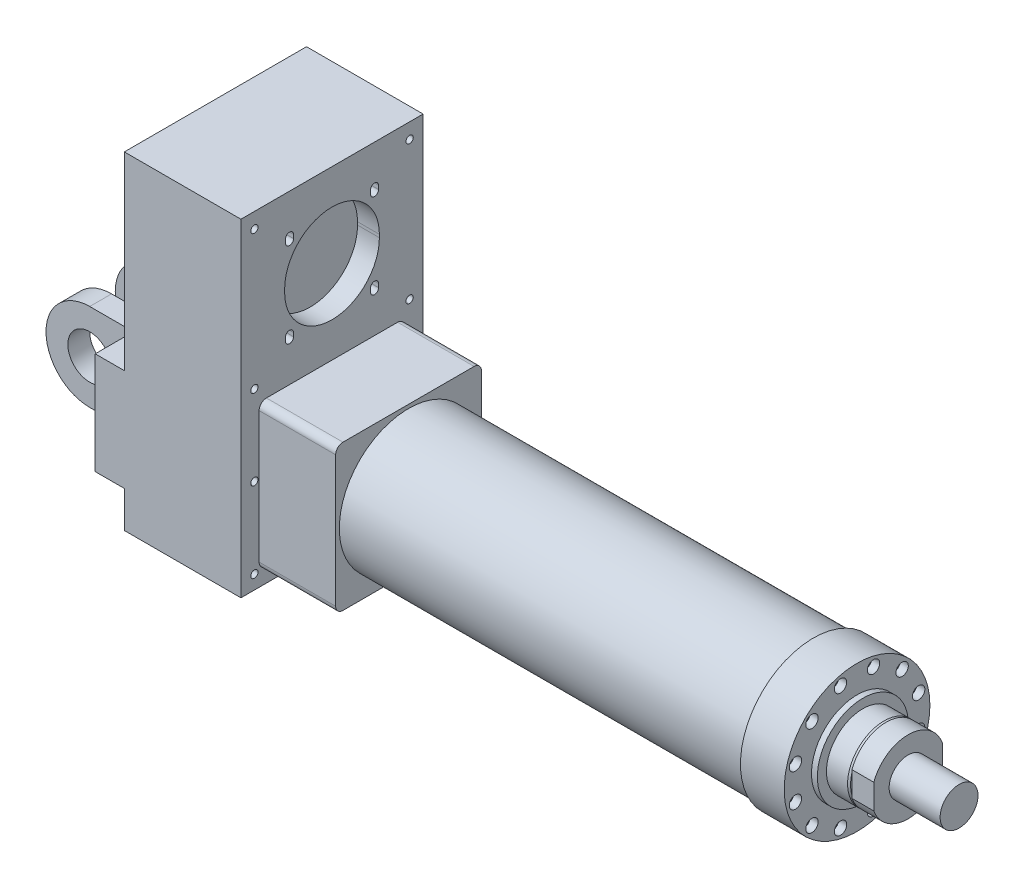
ISO-10303-21;
HEADER;
FILE_DESCRIPTION(('STEP AP214'),'2;1');
FILE_NAME('part.step','',(''),(''),'','','');
FILE_SCHEMA(('AUTOMOTIVE_DESIGN { 1 0 10303 214 1 1 1 1 }'));
ENDSEC;
DATA;
#1=APPLICATION_CONTEXT('core data for automotive mechanical design processes');
#2=APPLICATION_PROTOCOL_DEFINITION('international standard','automotive_design',2000,#1);
#3=PRODUCT_CONTEXT('',#1,'mechanical');
#4=PRODUCT('Part','Part','',(#3));
#5=PRODUCT_RELATED_PRODUCT_CATEGORY('part','',(#4));
#6=PRODUCT_DEFINITION_FORMATION('','',#4);
#7=PRODUCT_DEFINITION_CONTEXT('part definition',#1,'design');
#8=PRODUCT_DEFINITION('design','',#6,#7);
#9=PRODUCT_DEFINITION_SHAPE('','',#8);
#10=(LENGTH_UNIT() NAMED_UNIT(*) SI_UNIT(.MILLI.,.METRE.));
#11=(NAMED_UNIT(*) PLANE_ANGLE_UNIT() SI_UNIT($,.RADIAN.));
#12=(NAMED_UNIT(*) SI_UNIT($,.STERADIAN.) SOLID_ANGLE_UNIT());
#13=UNCERTAINTY_MEASURE_WITH_UNIT(LENGTH_MEASURE(1.E-05),#10,'distance_accuracy_value','');
#14=(GEOMETRIC_REPRESENTATION_CONTEXT(3) GLOBAL_UNCERTAINTY_ASSIGNED_CONTEXT((#13)) GLOBAL_UNIT_ASSIGNED_CONTEXT((#10,
#11,#12)) REPRESENTATION_CONTEXT('',''));
#15=CARTESIAN_POINT('',(0.,0.,0.));
#16=DIRECTION('',(0.,0.,1.));
#17=DIRECTION('',(1.,0.,0.));
#18=AXIS2_PLACEMENT_3D('',#15,#16,#17);
#19=CARTESIAN_POINT('',(755.5,0.,0.));
#20=DIRECTION('',(-1.,0.,0.));
#21=DIRECTION('',(0.,0.,1.));
#22=AXIS2_PLACEMENT_3D('',#19,#20,#21);
#23=CYLINDRICAL_SURFACE('',#22,26.);
#24=CARTESIAN_POINT('',(755.5,0.,0.));
#25=DIRECTION('',(1.,0.,0.));
#26=DIRECTION('',(0.,0.,-1.));
#27=AXIS2_PLACEMENT_3D('',#24,#25,#26);
#28=CIRCLE('',#27,26.);
#29=CARTESIAN_POINT('',(755.5,0.,-26.));
#30=VERTEX_POINT('',#29);
#31=EDGE_CURVE('E12',#30,#30,#28,.T.);
#32=ORIENTED_EDGE('',*,*,#31,.F.);
#33=EDGE_LOOP('',(#32));
#34=FACE_BOUND('',#33,.T.);
#35=CARTESIAN_POINT('',(685.5,0.,0.));
#36=DIRECTION('',(1.,0.,0.));
#37=DIRECTION('',(0.,0.,-1.));
#38=AXIS2_PLACEMENT_3D('',#35,#36,#37);
#39=CIRCLE('',#38,26.);
#40=CARTESIAN_POINT('',(685.5,0.,-26.));
#41=VERTEX_POINT('',#40);
#42=EDGE_CURVE('E146',#41,#41,#39,.T.);
#43=ORIENTED_EDGE('',*,*,#42,.T.);
#44=EDGE_LOOP('',(#43));
#45=FACE_BOUND('',#44,.T.);
#46=ADVANCED_FACE('F143',(#34,#45),#23,.T.);
#47=CARTESIAN_POINT('',(755.5,0.,0.));
#48=DIRECTION('',(1.,0.,0.));
#49=DIRECTION('',(0.,0.,-1.));
#50=AXIS2_PLACEMENT_3D('',#47,#48,#49);
#51=PLANE('',#50);
#52=ORIENTED_EDGE('',*,*,#31,.T.);
#53=EDGE_LOOP('',(#52));
#54=FACE_BOUND('',#53,.T.);
#55=ADVANCED_FACE('F158',(#54),#51,.T.);
#56=CARTESIAN_POINT('',(685.5,0.,0.));
#57=DIRECTION('',(1.,0.,0.));
#58=DIRECTION('',(0.,0.,-1.));
#59=AXIS2_PLACEMENT_3D('',#56,#57,#58);
#60=PLANE('',#59);
#61=ORIENTED_EDGE('',*,*,#42,.F.);
#62=EDGE_LOOP('',(#61));
#63=FACE_BOUND('',#62,.T.);
#64=ADVANCED_FACE('F156',(#63),#60,.F.);
#65=CLOSED_SHELL('',(#46,#55,#64));
#66=MANIFOLD_SOLID_BREP('B2',#65);
#67=CARTESIAN_POINT('',(-305.,0.,0.));
#68=DIRECTION('',(-1.,0.,0.));
#69=DIRECTION('',(0.,0.,1.));
#70=AXIS2_PLACEMENT_3D('',#67,#68,#69);
#71=PLANE('',#70);
#72=DIRECTION('',(0.,0.,1.));
#73=VECTOR('',#72,1.);
#74=CARTESIAN_POINT('',(-305.,-70.,-125.));
#75=LINE('',#74,#73);
#76=CARTESIAN_POINT('',(-305.,-70.,-125.));
#77=VERTEX_POINT('',#76);
#78=CARTESIAN_POINT('',(-305.,-70.,-72.5000000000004));
#79=VERTEX_POINT('',#78);
#80=EDGE_CURVE('E564',#77,#79,#75,.T.);
#81=ORIENTED_EDGE('',*,*,#80,.T.);
#82=DIRECTION('',(0.,1.,0.));
#83=VECTOR('',#82,1.);
#84=CARTESIAN_POINT('',(-305.,0.,-72.5000000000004));
#85=LINE('',#84,#83);
#86=CARTESIAN_POINT('',(-305.,70.,-72.5000000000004));
#87=VERTEX_POINT('',#86);
#88=EDGE_CURVE('E1133',#79,#87,#85,.T.);
#89=ORIENTED_EDGE('',*,*,#88,.T.);
#90=DIRECTION('',(0.,0.,1.));
#91=VECTOR('',#90,1.);
#92=CARTESIAN_POINT('',(-305.,70.,-125.));
#93=LINE('',#92,#91);
#94=CARTESIAN_POINT('',(-305.,70.,-125.));
#95=VERTEX_POINT('',#94);
#96=EDGE_CURVE('E572',#95,#87,#93,.T.);
#97=ORIENTED_EDGE('',*,*,#96,.F.);
#98=DIRECTION('',(0.,-1.,0.));
#99=VECTOR('',#98,1.);
#100=CARTESIAN_POINT('',(-305.,70.,-125.));
#101=LINE('',#100,#99);
#102=EDGE_CURVE('E559',#95,#77,#101,.T.);
#103=ORIENTED_EDGE('',*,*,#102,.T.);
#104=EDGE_LOOP('',(#81,#89,#97,#103));
#105=FACE_BOUND('',#104,.T.);
#106=ADVANCED_FACE('F185',(#105),#71,.T.);
#107=CARTESIAN_POINT('',(-305.,70.,-22.4999999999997));
#108=VERTEX_POINT('',#107);
#109=CARTESIAN_POINT('',(-305.,70.,22.4999999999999));
#110=VERTEX_POINT('',#109);
#111=EDGE_CURVE('E1189',#108,#110,#93,.T.);
#112=ORIENTED_EDGE('',*,*,#111,.F.);
#113=DIRECTION('',(0.,-1.,0.));
#114=VECTOR('',#113,1.);
#115=CARTESIAN_POINT('',(-305.,-60.,-22.4999999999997));
#116=LINE('',#115,#114);
#117=CARTESIAN_POINT('',(-305.,-70.,-22.4999999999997));
#118=VERTEX_POINT('',#117);
#119=EDGE_CURVE('E1131',#108,#118,#116,.T.);
#120=ORIENTED_EDGE('',*,*,#119,.T.);
#121=CARTESIAN_POINT('',(-305.,-70.,22.5));
#122=VERTEX_POINT('',#121);
#123=EDGE_CURVE('E1192',#118,#122,#75,.T.);
#124=ORIENTED_EDGE('',*,*,#123,.T.);
#125=DIRECTION('',(0.,1.,0.));
#126=VECTOR('',#125,1.);
#127=CARTESIAN_POINT('',(-305.,0.,22.5));
#128=LINE('',#127,#126);
#129=EDGE_CURVE('E1128',#122,#110,#128,.T.);
#130=ORIENTED_EDGE('',*,*,#129,.T.);
#131=EDGE_LOOP('',(#112,#120,#124,#130));
#132=FACE_BOUND('',#131,.T.);
#133=ADVANCED_FACE('F1188',(#132),#71,.T.);
#134=CARTESIAN_POINT('',(-305.,70.,72.5));
#135=VERTEX_POINT('',#134);
#136=CARTESIAN_POINT('',(-305.,70.,125.));
#137=VERTEX_POINT('',#136);
#138=EDGE_CURVE('E571',#135,#137,#93,.T.);
#139=ORIENTED_EDGE('',*,*,#138,.F.);
#140=DIRECTION('',(0.,-1.,0.));
#141=VECTOR('',#140,1.);
#142=CARTESIAN_POINT('',(-305.,-60.,72.5));
#143=LINE('',#142,#141);
#144=CARTESIAN_POINT('',(-305.,-70.,72.5));
#145=VERTEX_POINT('',#144);
#146=EDGE_CURVE('E1126',#135,#145,#143,.T.);
#147=ORIENTED_EDGE('',*,*,#146,.T.);
#148=CARTESIAN_POINT('',(-305.,-70.,125.));
#149=VERTEX_POINT('',#148);
#150=EDGE_CURVE('E562',#145,#149,#75,.T.);
#151=ORIENTED_EDGE('',*,*,#150,.T.);
#152=DIRECTION('',(0.,-1.,0.));
#153=VECTOR('',#152,1.);
#154=CARTESIAN_POINT('',(-305.,70.,125.));
#155=LINE('',#154,#153);
#156=EDGE_CURVE('E567',#137,#149,#155,.T.);
#157=ORIENTED_EDGE('',*,*,#156,.F.);
#158=EDGE_LOOP('',(#139,#147,#151,#157));
#159=FACE_BOUND('',#158,.T.);
#160=ADVANCED_FACE('F1207',(#159),#71,.T.);
#161=CARTESIAN_POINT('',(-265.,0.,0.));
#162=DIRECTION('',(-1.,0.,0.));
#163=DIRECTION('',(0.,0.,1.));
#164=AXIS2_PLACEMENT_3D('',#161,#162,#163);
#165=PLANE('',#164);
#166=DIRECTION('',(0.,1.,0.));
#167=VECTOR('',#166,1.);
#168=CARTESIAN_POINT('',(-265.,330.,125.));
#169=LINE('',#168,#167);
#170=CARTESIAN_POINT('',(-265.,-120.,125.));
#171=VERTEX_POINT('',#170);
#172=CARTESIAN_POINT('',(-265.,-70.0000000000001,125.));
#173=VERTEX_POINT('',#172);
#174=EDGE_CURVE('E846',#171,#173,#169,.T.);
#175=ORIENTED_EDGE('',*,*,#174,.T.);
#176=DIRECTION('',(0.,0.,1.));
#177=VECTOR('',#176,1.);
#178=CARTESIAN_POINT('',(-265.,-70.,-125.));
#179=LINE('',#178,#177);
#180=CARTESIAN_POINT('',(-265.,-70.,-125.));
#181=VERTEX_POINT('',#180);
#182=EDGE_CURVE('E558',#181,#173,#179,.T.);
#183=ORIENTED_EDGE('',*,*,#182,.F.);
#184=DIRECTION('',(0.,-1.,0.));
#185=VECTOR('',#184,1.);
#186=CARTESIAN_POINT('',(-265.,330.,-125.));
#187=LINE('',#186,#185);
#188=CARTESIAN_POINT('',(-265.,-120.,-125.));
#189=VERTEX_POINT('',#188);
#190=EDGE_CURVE('E851',#181,#189,#187,.T.);
#191=ORIENTED_EDGE('',*,*,#190,.T.);
#192=DIRECTION('',(0.,0.,1.));
#193=VECTOR('',#192,1.);
#194=CARTESIAN_POINT('',(-265.,-120.,-125.));
#195=LINE('',#194,#193);
#196=EDGE_CURVE('E854',#189,#171,#195,.T.);
#197=ORIENTED_EDGE('',*,*,#196,.T.);
#198=EDGE_LOOP('',(#175,#183,#191,#197));
#199=FACE_BOUND('',#198,.T.);
#200=ADVANCED_FACE('F1217',(#199),#165,.T.);
#201=DIRECTION('',(0.,0.,1.));
#202=VECTOR('',#201,1.);
#203=CARTESIAN_POINT('',(-265.,70.,-125.));
#204=LINE('',#203,#202);
#205=CARTESIAN_POINT('',(-265.,70.0000000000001,-125.));
#206=VERTEX_POINT('',#205);
#207=CARTESIAN_POINT('',(-265.,70.0000000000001,125.));
#208=VERTEX_POINT('',#207);
#209=EDGE_CURVE('E563',#206,#208,#204,.T.);
#210=ORIENTED_EDGE('',*,*,#209,.T.);
#211=CARTESIAN_POINT('',(-265.,330.,125.));
#212=VERTEX_POINT('',#211);
#213=EDGE_CURVE('E849',#208,#212,#169,.T.);
#214=ORIENTED_EDGE('',*,*,#213,.T.);
#215=DIRECTION('',(0.,0.,-1.));
#216=VECTOR('',#215,1.);
#217=CARTESIAN_POINT('',(-265.,330.,-125.));
#218=LINE('',#217,#216);
#219=CARTESIAN_POINT('',(-265.,330.,-125.));
#220=VERTEX_POINT('',#219);
#221=EDGE_CURVE('E848',#212,#220,#218,.T.);
#222=ORIENTED_EDGE('',*,*,#221,.T.);
#223=EDGE_CURVE('E852',#220,#206,#187,.T.);
#224=ORIENTED_EDGE('',*,*,#223,.T.);
#225=EDGE_LOOP('',(#210,#214,#222,#224));
#226=FACE_BOUND('',#225,.T.);
#227=ADVANCED_FACE('F1233',(#226),#165,.T.);
#228=CARTESIAN_POINT('',(-105.,0.,0.));
#229=DIRECTION('',(-1.,0.,0.));
#230=DIRECTION('',(0.,0.,1.));
#231=AXIS2_PLACEMENT_3D('',#228,#229,#230);
#232=PLANE('',#231);
#233=CARTESIAN_POINT('',(-105.,275.836309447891,-58.3363094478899));
#234=DIRECTION('',(-1.,0.,0.));
#235=DIRECTION('',(0.,0.,1.));
#236=AXIS2_PLACEMENT_3D('',#233,#234,#235);
#237=CIRCLE('',#236,5.49999999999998);
#238=CARTESIAN_POINT('',(-105.,275.836309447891,-52.8363094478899));
#239=VERTEX_POINT('',#238);
#240=CARTESIAN_POINT('',(-105.,275.836309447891,-63.8363094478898));
#241=VERTEX_POINT('',#240);
#242=EDGE_CURVE('E755',#239,#241,#237,.T.);
#243=ORIENTED_EDGE('',*,*,#242,.T.);
#244=DIRECTION('',(0.,1.,0.));
#245=VECTOR('',#244,1.);
#246=CARTESIAN_POINT('',(-105.,270.83630944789,-63.8363094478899));
#247=LINE('',#246,#245);
#248=CARTESIAN_POINT('',(-105.,270.83630944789,-63.8363094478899));
#249=VERTEX_POINT('',#248);
#250=EDGE_CURVE('E716',#249,#241,#247,.T.);
#251=ORIENTED_EDGE('',*,*,#250,.F.);
#252=CARTESIAN_POINT('',(-105.,270.83630944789,-58.3363094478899));
#253=DIRECTION('',(-1.,0.,0.));
#254=DIRECTION('',(0.,0.,1.));
#255=AXIS2_PLACEMENT_3D('',#252,#253,#254);
#256=CIRCLE('',#255,5.5);
#257=CARTESIAN_POINT('',(-105.,270.83630944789,-52.8363094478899));
#258=VERTEX_POINT('',#257);
#259=EDGE_CURVE('E748',#249,#258,#256,.T.);
#260=ORIENTED_EDGE('',*,*,#259,.T.);
#261=DIRECTION('',(0.,1.,0.));
#262=VECTOR('',#261,1.);
#263=CARTESIAN_POINT('',(-105.,270.83630944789,-52.8363094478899));
#264=LINE('',#263,#262);
#265=EDGE_CURVE('E751',#258,#239,#264,.T.);
#266=ORIENTED_EDGE('',*,*,#265,.T.);
#267=EDGE_LOOP('',(#243,#251,#260,#266));
#268=FACE_BOUND('',#267,.T.);
#269=CARTESIAN_POINT('',(-105.,154.16369055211,-58.3363094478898));
#270=DIRECTION('',(1.,0.,0.));
#271=DIRECTION('',(0.,0.,-1.));
#272=AXIS2_PLACEMENT_3D('',#269,#270,#271);
#273=CIRCLE('',#272,5.49999999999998);
#274=CARTESIAN_POINT('',(-105.,154.16369055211,-52.8363094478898));
#275=VERTEX_POINT('',#274);
#276=CARTESIAN_POINT('',(-105.,154.16369055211,-63.8363094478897));
#277=VERTEX_POINT('',#276);
#278=EDGE_CURVE('E724',#275,#277,#273,.T.);
#279=ORIENTED_EDGE('',*,*,#278,.F.);
#280=DIRECTION('',(0.,-1.,0.));
#281=VECTOR('',#280,1.);
#282=CARTESIAN_POINT('',(-105.,159.16369055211,-52.8363094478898));
#283=LINE('',#282,#281);
#284=CARTESIAN_POINT('',(-105.,159.16369055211,-52.8363094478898));
#285=VERTEX_POINT('',#284);
#286=EDGE_CURVE('E678',#285,#275,#283,.T.);
#287=ORIENTED_EDGE('',*,*,#286,.F.);
#288=CARTESIAN_POINT('',(-105.,159.16369055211,-58.3363094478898));
#289=DIRECTION('',(1.,0.,0.));
#290=DIRECTION('',(0.,0.,-1.));
#291=AXIS2_PLACEMENT_3D('',#288,#289,#290);
#292=CIRCLE('',#291,5.5);
#293=CARTESIAN_POINT('',(-105.,159.16369055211,-63.8363094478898));
#294=VERTEX_POINT('',#293);
#295=EDGE_CURVE('E717',#294,#285,#292,.T.);
#296=ORIENTED_EDGE('',*,*,#295,.F.);
#297=DIRECTION('',(0.,-1.,0.));
#298=VECTOR('',#297,1.);
#299=CARTESIAN_POINT('',(-105.,159.16369055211,-63.8363094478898));
#300=LINE('',#299,#298);
#301=EDGE_CURVE('E720',#294,#277,#300,.T.);
#302=ORIENTED_EDGE('',*,*,#301,.T.);
#303=EDGE_LOOP('',(#279,#287,#296,#302));
#304=FACE_BOUND('',#303,.T.);
#305=DIRECTION('',(0.,1.,0.));
#306=VECTOR('',#305,1.);
#307=CARTESIAN_POINT('',(-105.,270.83630944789,63.8363094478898));
#308=LINE('',#307,#306);
#309=CARTESIAN_POINT('',(-105.,270.83630944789,63.8363094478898));
#310=VERTEX_POINT('',#309);
#311=CARTESIAN_POINT('',(-105.,275.836309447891,63.8363094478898));
#312=VERTEX_POINT('',#311);
#313=EDGE_CURVE('E661',#310,#312,#308,.T.);
#314=ORIENTED_EDGE('',*,*,#313,.T.);
#315=CARTESIAN_POINT('',(-105.,275.836309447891,58.3363094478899));
#316=DIRECTION('',(1.,0.,0.));
#317=DIRECTION('',(0.,0.,-1.));
#318=AXIS2_PLACEMENT_3D('',#315,#316,#317);
#319=CIRCLE('',#318,5.49999999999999);
#320=CARTESIAN_POINT('',(-105.,275.836309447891,52.8363094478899));
#321=VERTEX_POINT('',#320);
#322=EDGE_CURVE('E658',#321,#312,#319,.T.);
#323=ORIENTED_EDGE('',*,*,#322,.F.);
#324=DIRECTION('',(0.,1.,0.));
#325=VECTOR('',#324,1.);
#326=CARTESIAN_POINT('',(-105.,270.83630944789,52.8363094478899));
#327=LINE('',#326,#325);
#328=CARTESIAN_POINT('',(-105.,270.83630944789,52.8363094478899));
#329=VERTEX_POINT('',#328);
#330=EDGE_CURVE('E654',#329,#321,#327,.T.);
#331=ORIENTED_EDGE('',*,*,#330,.F.);
#332=CARTESIAN_POINT('',(-105.,270.83630944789,58.3363094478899));
#333=DIRECTION('',(1.,0.,0.));
#334=DIRECTION('',(0.,0.,-1.));
#335=AXIS2_PLACEMENT_3D('',#332,#333,#334);
#336=CIRCLE('',#335,5.49999999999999);
#337=EDGE_CURVE('E651',#310,#329,#336,.T.);
#338=ORIENTED_EDGE('',*,*,#337,.F.);
#339=EDGE_LOOP('',(#314,#323,#331,#338));
#340=FACE_BOUND('',#339,.T.);
#341=DIRECTION('',(0.,0.,1.));
#342=VECTOR('',#341,1.);
#343=CARTESIAN_POINT('',(-105.,-100.,-90.));
#344=LINE('',#343,#342);
#345=CARTESIAN_POINT('',(-105.,-100.,-90.));
#346=VERTEX_POINT('',#345);
#347=CARTESIAN_POINT('',(-105.,-100.,89.9999999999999));
#348=VERTEX_POINT('',#347);
#349=EDGE_CURVE('E899',#346,#348,#344,.T.);
#350=ORIENTED_EDGE('',*,*,#349,.T.);
#351=CARTESIAN_POINT('',(-105.,-90.,90.));
#352=DIRECTION('',(-1.,0.,0.));
#353=DIRECTION('',(0.,0.,-1.));
#354=AXIS2_PLACEMENT_3D('',#351,#352,#353);
#355=CIRCLE('',#354,9.99999999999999);
#356=CARTESIAN_POINT('',(-105.,-90.,100.));
#357=VERTEX_POINT('',#356);
#358=EDGE_CURVE('E877',#348,#357,#355,.T.);
#359=ORIENTED_EDGE('',*,*,#358,.T.);
#360=DIRECTION('',(0.,1.,0.));
#361=VECTOR('',#360,1.);
#362=CARTESIAN_POINT('',(-105.,89.9999999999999,99.9999999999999));
#363=LINE('',#362,#361);
#364=CARTESIAN_POINT('',(-105.,89.9999999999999,99.9999999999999));
#365=VERTEX_POINT('',#364);
#366=EDGE_CURVE('E880',#357,#365,#363,.T.);
#367=ORIENTED_EDGE('',*,*,#366,.T.);
#368=CARTESIAN_POINT('',(-105.,90.,90.));
#369=DIRECTION('',(-1.,0.,0.));
#370=DIRECTION('',(0.,0.,1.));
#371=AXIS2_PLACEMENT_3D('',#368,#369,#370);
#372=CIRCLE('',#371,9.99999999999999);
#373=CARTESIAN_POINT('',(-105.,100.,89.9999999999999));
#374=VERTEX_POINT('',#373);
#375=EDGE_CURVE('E884',#365,#374,#372,.T.);
#376=ORIENTED_EDGE('',*,*,#375,.T.);
#377=DIRECTION('',(0.,0.,-1.));
#378=VECTOR('',#377,1.);
#379=CARTESIAN_POINT('',(-105.,100.,-90.));
#380=LINE('',#379,#378);
#381=CARTESIAN_POINT('',(-105.,100.,-90.));
#382=VERTEX_POINT('',#381);
#383=EDGE_CURVE('E887',#374,#382,#380,.T.);
#384=ORIENTED_EDGE('',*,*,#383,.T.);
#385=CARTESIAN_POINT('',(-105.,90.,-90.0000000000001));
#386=DIRECTION('',(-1.,0.,0.));
#387=DIRECTION('',(0.,0.,-1.));
#388=AXIS2_PLACEMENT_3D('',#385,#386,#387);
#389=CIRCLE('',#388,9.99999999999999);
#390=CARTESIAN_POINT('',(-105.,89.9999999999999,-100.));
#391=VERTEX_POINT('',#390);
#392=EDGE_CURVE('E890',#382,#391,#389,.T.);
#393=ORIENTED_EDGE('',*,*,#392,.T.);
#394=DIRECTION('',(0.,-1.,0.));
#395=VECTOR('',#394,1.);
#396=CARTESIAN_POINT('',(-105.,89.9999999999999,-100.));
#397=LINE('',#396,#395);
#398=CARTESIAN_POINT('',(-105.,-90.,-100.));
#399=VERTEX_POINT('',#398);
#400=EDGE_CURVE('E893',#391,#399,#397,.T.);
#401=ORIENTED_EDGE('',*,*,#400,.T.);
#402=CARTESIAN_POINT('',(-105.,-90.,-90.0000000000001));
#403=DIRECTION('',(-1.,0.,0.));
#404=DIRECTION('',(0.,0.,-1.));
#405=AXIS2_PLACEMENT_3D('',#402,#403,#404);
#406=CIRCLE('',#405,9.99999999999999);
#407=EDGE_CURVE('E896',#399,#346,#406,.T.);
#408=ORIENTED_EDGE('',*,*,#407,.T.);
#409=EDGE_LOOP('',(#350,#359,#367,#376,#384,#393,#401,#408));
#410=FACE_BOUND('',#409,.T.);
#411=DIRECTION('',(0.,1.,0.));
#412=VECTOR('',#411,1.);
#413=CARTESIAN_POINT('',(-105.,330.,125.));
#414=LINE('',#413,#412);
#415=CARTESIAN_POINT('',(-105.,-120.,125.));
#416=VERTEX_POINT('',#415);
#417=CARTESIAN_POINT('',(-105.,330.,125.));
#418=VERTEX_POINT('',#417);
#419=EDGE_CURVE('E843',#416,#418,#414,.T.);
#420=ORIENTED_EDGE('',*,*,#419,.F.);
#421=DIRECTION('',(0.,0.,1.));
#422=VECTOR('',#421,1.);
#423=CARTESIAN_POINT('',(-105.,-120.,-125.));
#424=LINE('',#423,#422);
#425=CARTESIAN_POINT('',(-105.,-120.,-125.));
#426=VERTEX_POINT('',#425);
#427=EDGE_CURVE('E863',#426,#416,#424,.T.);
#428=ORIENTED_EDGE('',*,*,#427,.F.);
#429=DIRECTION('',(0.,-1.,0.));
#430=VECTOR('',#429,1.);
#431=CARTESIAN_POINT('',(-105.,330.,-125.));
#432=LINE('',#431,#430);
#433=CARTESIAN_POINT('',(-105.,330.,-125.));
#434=VERTEX_POINT('',#433);
#435=EDGE_CURVE('E861',#434,#426,#432,.T.);
#436=ORIENTED_EDGE('',*,*,#435,.F.);
#437=DIRECTION('',(0.,0.,-1.));
#438=VECTOR('',#437,1.);
#439=CARTESIAN_POINT('',(-105.,330.,-125.));
#440=LINE('',#439,#438);
#441=EDGE_CURVE('E859',#418,#434,#440,.T.);
#442=ORIENTED_EDGE('',*,*,#441,.F.);
#443=EDGE_LOOP('',(#420,#428,#436,#442));
#444=FACE_BOUND('',#443,.T.);
#445=CARTESIAN_POINT('',(-105.,309.,106.5));
#446=DIRECTION('',(1.,0.,0.));
#447=DIRECTION('',(0.,0.,-1.));
#448=AXIS2_PLACEMENT_3D('',#445,#446,#447);
#449=CIRCLE('',#448,5.00000000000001);
#450=CARTESIAN_POINT('',(-105.,309.,101.5));
#451=VERTEX_POINT('',#450);
#452=EDGE_CURVE('E831',#451,#451,#449,.T.);
#453=ORIENTED_EDGE('',*,*,#452,.F.);
#454=EDGE_LOOP('',(#453));
#455=FACE_BOUND('',#454,.T.);
#456=CARTESIAN_POINT('',(-105.,309.,-106.5));
#457=DIRECTION('',(1.,0.,0.));
#458=DIRECTION('',(0.,0.,-1.));
#459=AXIS2_PLACEMENT_3D('',#456,#457,#458);
#460=CIRCLE('',#459,5.00000000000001);
#461=CARTESIAN_POINT('',(-105.,309.,-111.5));
#462=VERTEX_POINT('',#461);
#463=EDGE_CURVE('E811',#462,#462,#460,.T.);
#464=ORIENTED_EDGE('',*,*,#463,.F.);
#465=EDGE_LOOP('',(#464));
#466=FACE_BOUND('',#465,.T.);
#467=CARTESIAN_POINT('',(-105.,-101.,-106.500000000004));
#468=DIRECTION('',(1.,0.,0.));
#469=DIRECTION('',(0.,0.,-1.));
#470=AXIS2_PLACEMENT_3D('',#467,#468,#469);
#471=CIRCLE('',#470,5.00000000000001);
#472=CARTESIAN_POINT('',(-105.,-101.,-111.500000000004));
#473=VERTEX_POINT('',#472);
#474=EDGE_CURVE('E805',#473,#473,#471,.T.);
#475=ORIENTED_EDGE('',*,*,#474,.F.);
#476=EDGE_LOOP('',(#475));
#477=FACE_BOUND('',#476,.T.);
#478=CARTESIAN_POINT('',(-105.,8.99999999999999,-106.500000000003));
#479=DIRECTION('',(1.,0.,0.));
#480=DIRECTION('',(0.,0.,-1.));
#481=AXIS2_PLACEMENT_3D('',#478,#479,#480);
#482=CIRCLE('',#481,5.00000000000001);
#483=CARTESIAN_POINT('',(-105.,8.99999999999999,-111.500000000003));
#484=VERTEX_POINT('',#483);
#485=EDGE_CURVE('E798',#484,#484,#482,.T.);
#486=ORIENTED_EDGE('',*,*,#485,.F.);
#487=EDGE_LOOP('',(#486));
#488=FACE_BOUND('',#487,.T.);
#489=CARTESIAN_POINT('',(-105.,119.,106.499999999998));
#490=DIRECTION('',(1.,0.,0.));
#491=DIRECTION('',(0.,0.,-1.));
#492=AXIS2_PLACEMENT_3D('',#489,#490,#491);
#493=CIRCLE('',#492,5.00000000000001);
#494=CARTESIAN_POINT('',(-105.,119.,101.499999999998));
#495=VERTEX_POINT('',#494);
#496=EDGE_CURVE('E828',#495,#495,#493,.T.);
#497=ORIENTED_EDGE('',*,*,#496,.F.);
#498=EDGE_LOOP('',(#497));
#499=FACE_BOUND('',#498,.T.);
#500=CARTESIAN_POINT('',(-105.,8.99999999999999,106.499999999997));
#501=DIRECTION('',(1.,0.,0.));
#502=DIRECTION('',(0.,0.,-1.));
#503=AXIS2_PLACEMENT_3D('',#500,#501,#502);
#504=CIRCLE('',#503,5.00000000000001);
#505=CARTESIAN_POINT('',(-105.,8.99999999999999,101.499999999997));
#506=VERTEX_POINT('',#505);
#507=EDGE_CURVE('E835',#506,#506,#504,.T.);
#508=ORIENTED_EDGE('',*,*,#507,.F.);
#509=EDGE_LOOP('',(#508));
#510=FACE_BOUND('',#509,.T.);
#511=CARTESIAN_POINT('',(-105.,-101.,106.499999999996));
#512=DIRECTION('',(1.,0.,0.));
#513=DIRECTION('',(0.,0.,-1.));
#514=AXIS2_PLACEMENT_3D('',#511,#512,#513);
#515=CIRCLE('',#514,5.00000000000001);
#516=CARTESIAN_POINT('',(-105.,-101.,101.499999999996));
#517=VERTEX_POINT('',#516);
#518=EDGE_CURVE('E816',#517,#517,#515,.T.);
#519=ORIENTED_EDGE('',*,*,#518,.F.);
#520=EDGE_LOOP('',(#519));
#521=FACE_BOUND('',#520,.T.);
#522=CARTESIAN_POINT('',(-105.,119.,-106.500000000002));
#523=DIRECTION('',(1.,0.,0.));
#524=DIRECTION('',(0.,0.,-1.));
#525=AXIS2_PLACEMENT_3D('',#522,#523,#524);
#526=CIRCLE('',#525,5.00000000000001);
#527=CARTESIAN_POINT('',(-105.,119.,-111.500000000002));
#528=VERTEX_POINT('',#527);
#529=EDGE_CURVE('E823',#528,#528,#526,.T.);
#530=ORIENTED_EDGE('',*,*,#529,.F.);
#531=EDGE_LOOP('',(#530));
#532=FACE_BOUND('',#531,.T.);
#533=DIRECTION('',(0.,-1.,0.));
#534=VECTOR('',#533,1.);
#535=CARTESIAN_POINT('',(-105.,217.,-65.));
#536=LINE('',#535,#534);
#537=CARTESIAN_POINT('',(-105.,217.,-65.));
#538=VERTEX_POINT('',#537);
#539=CARTESIAN_POINT('',(-105.,213.,-65.));
#540=VERTEX_POINT('',#539);
#541=EDGE_CURVE('E664',#538,#540,#536,.T.);
#542=ORIENTED_EDGE('',*,*,#541,.T.);
#543=CARTESIAN_POINT('',(-105.,213.,0.));
#544=DIRECTION('',(1.,0.,0.));
#545=DIRECTION('',(0.,0.,-1.));
#546=AXIS2_PLACEMENT_3D('',#543,#544,#545);
#547=CIRCLE('',#546,65.);
#548=CARTESIAN_POINT('',(-105.,213.,65.));
#549=VERTEX_POINT('',#548);
#550=EDGE_CURVE('E781',#549,#540,#547,.T.);
#551=ORIENTED_EDGE('',*,*,#550,.F.);
#552=DIRECTION('',(0.,-1.,0.));
#553=VECTOR('',#552,1.);
#554=CARTESIAN_POINT('',(-105.,217.,65.));
#555=LINE('',#554,#553);
#556=CARTESIAN_POINT('',(-105.,217.,65.));
#557=VERTEX_POINT('',#556);
#558=EDGE_CURVE('E784',#557,#549,#555,.T.);
#559=ORIENTED_EDGE('',*,*,#558,.F.);
#560=CARTESIAN_POINT('',(-105.,217.,0.));
#561=DIRECTION('',(1.,0.,0.));
#562=DIRECTION('',(0.,0.,-1.));
#563=AXIS2_PLACEMENT_3D('',#560,#561,#562);
#564=CIRCLE('',#563,65.);
#565=EDGE_CURVE('E769',#538,#557,#564,.T.);
#566=ORIENTED_EDGE('',*,*,#565,.F.);
#567=EDGE_LOOP('',(#542,#551,#559,#566));
#568=FACE_BOUND('',#567,.T.);
#569=DIRECTION('',(0.,-1.,0.));
#570=VECTOR('',#569,1.);
#571=CARTESIAN_POINT('',(-105.,159.16369055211,52.8363094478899));
#572=LINE('',#571,#570);
#573=CARTESIAN_POINT('',(-105.,159.16369055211,52.8363094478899));
#574=VERTEX_POINT('',#573);
#575=CARTESIAN_POINT('',(-105.,154.16369055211,52.8363094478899));
#576=VERTEX_POINT('',#575);
#577=EDGE_CURVE('E643',#574,#576,#572,.T.);
#578=ORIENTED_EDGE('',*,*,#577,.T.);
#579=CARTESIAN_POINT('',(-105.,154.16369055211,58.3363094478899));
#580=DIRECTION('',(-1.,0.,0.));
#581=DIRECTION('',(0.,0.,1.));
#582=AXIS2_PLACEMENT_3D('',#579,#580,#581);
#583=CIRCLE('',#582,5.49999999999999);
#584=CARTESIAN_POINT('',(-105.,154.16369055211,63.8363094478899));
#585=VERTEX_POINT('',#584);
#586=EDGE_CURVE('E693',#576,#585,#583,.T.);
#587=ORIENTED_EDGE('',*,*,#586,.T.);
#588=DIRECTION('',(0.,-1.,0.));
#589=VECTOR('',#588,1.);
#590=CARTESIAN_POINT('',(-105.,159.16369055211,63.8363094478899));
#591=LINE('',#590,#589);
#592=CARTESIAN_POINT('',(-105.,159.16369055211,63.8363094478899));
#593=VERTEX_POINT('',#592);
#594=EDGE_CURVE('E689',#593,#585,#591,.T.);
#595=ORIENTED_EDGE('',*,*,#594,.F.);
#596=CARTESIAN_POINT('',(-105.,159.16369055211,58.3363094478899));
#597=DIRECTION('',(-1.,0.,0.));
#598=DIRECTION('',(0.,0.,1.));
#599=AXIS2_PLACEMENT_3D('',#596,#597,#598);
#600=CIRCLE('',#599,5.49999999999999);
#601=EDGE_CURVE('E686',#593,#574,#600,.T.);
#602=ORIENTED_EDGE('',*,*,#601,.T.);
#603=EDGE_LOOP('',(#578,#587,#595,#602));
#604=FACE_BOUND('',#603,.T.);
#605=ADVANCED_FACE('F1225',(#268,#304,#340,#410,#444,#455,#466,#477,#488,#499,#510,#521,#532,
#568,#604),#232,.F.);
#606=CARTESIAN_POINT('',(655.5,0.,0.));
#607=DIRECTION('',(1.,0.,0.));
#608=DIRECTION('',(0.,0.,-1.));
#609=AXIS2_PLACEMENT_3D('',#606,#607,#608);
#610=PLANE('',#609);
#611=CARTESIAN_POINT('',(655.5,0.,0.));
#612=DIRECTION('',(1.,0.,0.));
#613=DIRECTION('',(0.,0.,-1.));
#614=AXIS2_PLACEMENT_3D('',#611,#612,#613);
#615=CIRCLE('',#614,48.9080892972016);
#616=CARTESIAN_POINT('',(655.5,-13.5277935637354,-47.));
#617=VERTEX_POINT('',#616);
#618=CARTESIAN_POINT('',(655.5,13.5277935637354,-47.));
#619=VERTEX_POINT('',#618);
#620=EDGE_CURVE('E987',#617,#619,#615,.T.);
#621=ORIENTED_EDGE('',*,*,#620,.T.);
#622=DIRECTION('',(0.,-1.,0.));
#623=VECTOR('',#622,1.);
#624=CARTESIAN_POINT('',(655.5,17.058722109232,-47.));
#625=LINE('',#624,#623);
#626=EDGE_CURVE('E964',#619,#617,#625,.T.);
#627=ORIENTED_EDGE('',*,*,#626,.T.);
#628=EDGE_LOOP('',(#621,#627));
#629=FACE_BOUND('',#628,.T.);
#630=ADVANCED_FACE('F1316',(#629),#610,.T.);
#631=CARTESIAN_POINT('',(555.5,0.,0.));
#632=DIRECTION('',(-1.,0.,0.));
#633=DIRECTION('',(0.,0.,1.));
#634=AXIS2_PLACEMENT_3D('',#631,#632,#633);
#635=CYLINDRICAL_SURFACE('',#634,95.);
#636=CARTESIAN_POINT('',(555.5,0.,0.));
#637=DIRECTION('',(1.,0.,0.));
#638=DIRECTION('',(0.,0.,-1.));
#639=AXIS2_PLACEMENT_3D('',#636,#637,#638);
#640=CIRCLE('',#639,95.);
#641=CARTESIAN_POINT('',(555.5,0.,-95.));
#642=VERTEX_POINT('',#641);
#643=EDGE_CURVE('E1066',#642,#642,#640,.T.);
#644=ORIENTED_EDGE('',*,*,#643,.F.);
#645=EDGE_LOOP('',(#644));
#646=FACE_BOUND('',#645,.T.);
#647=CARTESIAN_POINT('',(0.,0.,0.));
#648=DIRECTION('',(1.,0.,0.));
#649=DIRECTION('',(0.,0.,-1.));
#650=AXIS2_PLACEMENT_3D('',#647,#648,#649);
#651=CIRCLE('',#650,95.);
#652=CARTESIAN_POINT('',(0.,0.,-95.));
#653=VERTEX_POINT('',#652);
#654=EDGE_CURVE('E941',#653,#653,#651,.T.);
#655=ORIENTED_EDGE('',*,*,#654,.T.);
#656=EDGE_LOOP('',(#655));
#657=FACE_BOUND('',#656,.T.);
#658=ADVANCED_FACE('F1521',(#646,#657),#635,.T.);
#659=CARTESIAN_POINT('',(615.5,0.,0.));
#660=DIRECTION('',(-1.,0.,0.));
#661=DIRECTION('',(0.,0.,1.));
#662=AXIS2_PLACEMENT_3D('',#659,#660,#661);
#663=CYLINDRICAL_SURFACE('',#662,100.);
#664=CARTESIAN_POINT('',(615.5,0.,0.));
#665=DIRECTION('',(1.,0.,0.));
#666=DIRECTION('',(0.,0.,-1.));
#667=AXIS2_PLACEMENT_3D('',#664,#665,#666);
#668=CIRCLE('',#667,100.);
#669=CARTESIAN_POINT('',(615.5,0.,-100.));
#670=VERTEX_POINT('',#669);
#671=EDGE_CURVE('E1067',#670,#670,#668,.T.);
#672=ORIENTED_EDGE('',*,*,#671,.F.);
#673=EDGE_LOOP('',(#672));
#674=FACE_BOUND('',#673,.T.);
#675=CARTESIAN_POINT('',(555.5,0.,0.));
#676=DIRECTION('',(1.,0.,0.));
#677=DIRECTION('',(0.,0.,-1.));
#678=AXIS2_PLACEMENT_3D('',#675,#676,#677);
#679=CIRCLE('',#678,100.);
#680=CARTESIAN_POINT('',(555.5,0.,-100.));
#681=VERTEX_POINT('',#680);
#682=EDGE_CURVE('E1063',#681,#681,#679,.T.);
#683=ORIENTED_EDGE('',*,*,#682,.T.);
#684=EDGE_LOOP('',(#683));
#685=FACE_BOUND('',#684,.T.);
#686=ADVANCED_FACE('F1513',(#674,#685),#663,.T.);
#687=CARTESIAN_POINT('',(615.5,0.,0.));
#688=DIRECTION('',(1.,0.,0.));
#689=DIRECTION('',(0.,0.,-1.));
#690=AXIS2_PLACEMENT_3D('',#687,#688,#689);
#691=PLANE('',#690);
#692=CARTESIAN_POINT('',(615.5,61.8718433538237,61.8718433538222));
#693=DIRECTION('',(1.,0.,0.));
#694=DIRECTION('',(0.,0.,-1.));
#695=AXIS2_PLACEMENT_3D('',#692,#693,#694);
#696=CIRCLE('',#695,8.50000000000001);
#697=CARTESIAN_POINT('',(615.5,61.8718433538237,53.3718433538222));
#698=VERTEX_POINT('',#697);
#699=EDGE_CURVE('E1007',#698,#698,#696,.T.);
#700=ORIENTED_EDGE('',*,*,#699,.F.);
#701=EDGE_LOOP('',(#700));
#702=FACE_BOUND('',#701,.T.);
#703=CARTESIAN_POINT('',(615.5,22.6466664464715,84.5185098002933));
#704=DIRECTION('',(1.,0.,0.));
#705=DIRECTION('',(0.,0.,-1.));
#706=AXIS2_PLACEMENT_3D('',#703,#704,#705);
#707=CIRCLE('',#706,8.5);
#708=CARTESIAN_POINT('',(615.5,22.6466664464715,76.0185098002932));
#709=VERTEX_POINT('',#708);
#710=EDGE_CURVE('E1014',#709,#709,#707,.T.);
#711=ORIENTED_EDGE('',*,*,#710,.F.);
#712=EDGE_LOOP('',(#711));
#713=FACE_BOUND('',#712,.T.);
#714=CARTESIAN_POINT('',(615.5,-22.6466664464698,84.5185098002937));
#715=DIRECTION('',(1.,0.,0.));
#716=DIRECTION('',(0.,0.,-1.));
#717=AXIS2_PLACEMENT_3D('',#714,#715,#716);
#718=CIRCLE('',#717,8.5);
#719=CARTESIAN_POINT('',(615.5,-22.6466664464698,76.0185098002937));
#720=VERTEX_POINT('',#719);
#721=EDGE_CURVE('E1020',#720,#720,#718,.T.);
#722=ORIENTED_EDGE('',*,*,#721,.F.);
#723=EDGE_LOOP('',(#722));
#724=FACE_BOUND('',#723,.T.);
#725=CARTESIAN_POINT('',(615.5,-61.8718433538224,61.8718433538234));
#726=DIRECTION('',(1.,0.,0.));
#727=DIRECTION('',(0.,0.,-1.));
#728=AXIS2_PLACEMENT_3D('',#725,#726,#727);
#729=CIRCLE('',#728,8.5);
#730=CARTESIAN_POINT('',(615.5,-61.8718433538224,53.3718433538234));
#731=VERTEX_POINT('',#730);
#732=EDGE_CURVE('E1026',#731,#731,#729,.T.);
#733=ORIENTED_EDGE('',*,*,#732,.F.);
#734=EDGE_LOOP('',(#733));
#735=FACE_BOUND('',#734,.T.);
#736=CARTESIAN_POINT('',(615.5,-84.5185098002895,22.6466664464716));
#737=DIRECTION('',(1.,0.,0.));
#738=DIRECTION('',(0.,0.,-1.));
#739=AXIS2_PLACEMENT_3D('',#736,#737,#738);
#740=CIRCLE('',#739,8.49999999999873);
#741=CARTESIAN_POINT('',(615.5,-84.5185098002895,14.1466664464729));
#742=VERTEX_POINT('',#741);
#743=EDGE_CURVE('E1032',#742,#742,#740,.T.);
#744=ORIENTED_EDGE('',*,*,#743,.F.);
#745=EDGE_LOOP('',(#744));
#746=FACE_BOUND('',#745,.T.);
#747=CARTESIAN_POINT('',(615.5,-84.5185098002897,-22.6466664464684));
#748=DIRECTION('',(1.,0.,0.));
#749=DIRECTION('',(0.,0.,-1.));
#750=AXIS2_PLACEMENT_3D('',#747,#748,#749);
#751=CIRCLE('',#750,8.49999999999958);
#752=CARTESIAN_POINT('',(615.5,-84.5185098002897,-31.146666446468));
#753=VERTEX_POINT('',#752);
#754=EDGE_CURVE('E1038',#753,#753,#751,.T.);
#755=ORIENTED_EDGE('',*,*,#754,.F.);
#756=EDGE_LOOP('',(#755));
#757=FACE_BOUND('',#756,.T.);
#758=CARTESIAN_POINT('',(615.5,-61.8718433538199,-61.87184335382));
#759=DIRECTION('',(1.,0.,0.));
#760=DIRECTION('',(0.,0.,-1.));
#761=AXIS2_PLACEMENT_3D('',#758,#759,#760);
#762=CIRCLE('',#761,8.50000000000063);
#763=CARTESIAN_POINT('',(615.5,-61.8718433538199,-70.3718433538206));
#764=VERTEX_POINT('',#763);
#765=EDGE_CURVE('E1044',#764,#764,#762,.T.);
#766=ORIENTED_EDGE('',*,*,#765,.F.);
#767=EDGE_LOOP('',(#766));
#768=FACE_BOUND('',#767,.T.);
#769=CARTESIAN_POINT('',(615.5,-22.6466664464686,-84.5185098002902));
#770=DIRECTION('',(1.,0.,0.));
#771=DIRECTION('',(0.,0.,-1.));
#772=AXIS2_PLACEMENT_3D('',#769,#770,#771);
#773=CIRCLE('',#772,8.5000000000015);
#774=CARTESIAN_POINT('',(615.5,-22.6466664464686,-93.0185098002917));
#775=VERTEX_POINT('',#774);
#776=EDGE_CURVE('E1050',#775,#775,#773,.T.);
#777=ORIENTED_EDGE('',*,*,#776,.F.);
#778=EDGE_LOOP('',(#777));
#779=FACE_BOUND('',#778,.T.);
#780=CARTESIAN_POINT('',(615.5,22.6466664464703,-84.5185098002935));
#781=DIRECTION('',(1.,0.,0.));
#782=DIRECTION('',(0.,0.,-1.));
#783=AXIS2_PLACEMENT_3D('',#780,#781,#782);
#784=CIRCLE('',#783,8.5);
#785=CARTESIAN_POINT('',(615.5,22.6466664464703,-93.0185098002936));
#786=VERTEX_POINT('',#785);
#787=EDGE_CURVE('E989',#786,#786,#784,.T.);
#788=ORIENTED_EDGE('',*,*,#787,.F.);
#789=EDGE_LOOP('',(#788));
#790=FACE_BOUND('',#789,.T.);
#791=CARTESIAN_POINT('',(615.5,61.8718433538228,-61.871843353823));
#792=DIRECTION('',(1.,0.,0.));
#793=DIRECTION('',(0.,0.,-1.));
#794=AXIS2_PLACEMENT_3D('',#791,#792,#793);
#795=CIRCLE('',#794,8.50000000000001);
#796=CARTESIAN_POINT('',(615.5,61.8718433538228,-70.371843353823));
#797=VERTEX_POINT('',#796);
#798=EDGE_CURVE('E996',#797,#797,#795,.T.);
#799=ORIENTED_EDGE('',*,*,#798,.F.);
#800=EDGE_LOOP('',(#799));
#801=FACE_BOUND('',#800,.T.);
#802=CARTESIAN_POINT('',(615.5,84.5185098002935,-22.6466664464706));
#803=DIRECTION('',(1.,0.,0.));
#804=DIRECTION('',(0.,0.,-1.));
#805=AXIS2_PLACEMENT_3D('',#802,#803,#804);
#806=CIRCLE('',#805,8.50000000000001);
#807=CARTESIAN_POINT('',(615.5,84.5185098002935,-31.1466664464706));
#808=VERTEX_POINT('',#807);
#809=EDGE_CURVE('E1002',#808,#808,#806,.T.);
#810=ORIENTED_EDGE('',*,*,#809,.F.);
#811=EDGE_LOOP('',(#810));
#812=FACE_BOUND('',#811,.T.);
#813=CARTESIAN_POINT('',(615.5,84.5185098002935,22.6466664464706));
#814=DIRECTION('',(1.,0.,0.));
#815=DIRECTION('',(0.,0.,-1.));
#816=AXIS2_PLACEMENT_3D('',#813,#814,#815);
#817=CIRCLE('',#816,8.5);
#818=CARTESIAN_POINT('',(615.5,84.5185098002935,14.1466664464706));
#819=VERTEX_POINT('',#818);
#820=EDGE_CURVE('E1010',#819,#819,#817,.T.);
#821=ORIENTED_EDGE('',*,*,#820,.F.);
#822=EDGE_LOOP('',(#821));
#823=FACE_BOUND('',#822,.T.);
#824=CARTESIAN_POINT('',(615.5,0.,0.));
#825=DIRECTION('',(1.,0.,0.));
#826=DIRECTION('',(0.,0.,-1.));
#827=AXIS2_PLACEMENT_3D('',#824,#825,#826);
#828=CIRCLE('',#827,62.5);
#829=CARTESIAN_POINT('',(615.5,0.,-62.5));
#830=VERTEX_POINT('',#829);
#831=EDGE_CURVE('E988',#830,#830,#828,.T.);
#832=ORIENTED_EDGE('',*,*,#831,.F.);
#833=EDGE_LOOP('',(#832));
#834=FACE_BOUND('',#833,.T.);
#835=ORIENTED_EDGE('',*,*,#671,.T.);
#836=EDGE_LOOP('',(#835));
#837=FACE_BOUND('',#836,.T.);
#838=ADVANCED_FACE('F1510',(#702,#713,#724,#735,#746,#757,#768,#779,#790,#801,#812,#823,#834,
#837),#691,.T.);
#839=CARTESIAN_POINT('',(555.5,0.,0.));
#840=DIRECTION('',(1.,0.,0.));
#841=DIRECTION('',(0.,0.,-1.));
#842=AXIS2_PLACEMENT_3D('',#839,#840,#841);
#843=PLANE('',#842);
#844=ORIENTED_EDGE('',*,*,#643,.T.);
#845=EDGE_LOOP('',(#844));
#846=FACE_BOUND('',#845,.T.);
#847=ORIENTED_EDGE('',*,*,#682,.F.);
#848=EDGE_LOOP('',(#847));
#849=FACE_BOUND('',#848,.T.);
#850=ADVANCED_FACE('F1508',(#846,#849),#843,.F.);
#851=CARTESIAN_POINT('',(623.5,0.,0.));
#852=DIRECTION('',(-1.,0.,0.));
#853=DIRECTION('',(0.,0.,1.));
#854=AXIS2_PLACEMENT_3D('',#851,#852,#853);
#855=CYLINDRICAL_SURFACE('',#854,62.5);
#856=CARTESIAN_POINT('',(623.5,0.,0.));
#857=DIRECTION('',(1.,0.,0.));
#858=DIRECTION('',(0.,0.,-1.));
#859=AXIS2_PLACEMENT_3D('',#856,#857,#858);
#860=CIRCLE('',#859,62.5);
#861=CARTESIAN_POINT('',(623.5,0.,-62.5));
#862=VERTEX_POINT('',#861);
#863=EDGE_CURVE('E1058',#862,#862,#860,.T.);
#864=ORIENTED_EDGE('',*,*,#863,.F.);
#865=EDGE_LOOP('',(#864));
#866=FACE_BOUND('',#865,.T.);
#867=ORIENTED_EDGE('',*,*,#831,.T.);
#868=EDGE_LOOP('',(#867));
#869=FACE_BOUND('',#868,.T.);
#870=ADVANCED_FACE('F1504',(#866,#869),#855,.T.);
#871=CARTESIAN_POINT('',(623.5,0.,0.));
#872=DIRECTION('',(1.,0.,0.));
#873=DIRECTION('',(0.,0.,-1.));
#874=AXIS2_PLACEMENT_3D('',#871,#872,#873);
#875=PLANE('',#874);
#876=CARTESIAN_POINT('',(623.5,0.,0.));
#877=DIRECTION('',(1.,0.,0.));
#878=DIRECTION('',(0.,0.,-1.));
#879=AXIS2_PLACEMENT_3D('',#876,#877,#878);
#880=CIRCLE('',#879,50.);
#881=CARTESIAN_POINT('',(623.5,0.,-50.));
#882=VERTEX_POINT('',#881);
#883=EDGE_CURVE('E984',#882,#882,#880,.T.);
#884=ORIENTED_EDGE('',*,*,#883,.F.);
#885=EDGE_LOOP('',(#884));
#886=FACE_BOUND('',#885,.T.);
#887=ORIENTED_EDGE('',*,*,#863,.T.);
#888=EDGE_LOOP('',(#887));
#889=FACE_BOUND('',#888,.T.);
#890=ADVANCED_FACE('F1500',(#886,#889),#875,.T.);
#891=CARTESIAN_POINT('',(604.5,84.5185098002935,22.6466664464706));
#892=DIRECTION('',(1.,0.,0.));
#893=DIRECTION('',(0.,0.,-1.));
#894=AXIS2_PLACEMENT_3D('',#891,#892,#893);
#895=CYLINDRICAL_SURFACE('',#894,8.5);
#896=CARTESIAN_POINT('',(604.5,84.5185098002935,22.6466664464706));
#897=DIRECTION('',(1.,0.,0.));
#898=DIRECTION('',(0.,0.,-1.));
#899=AXIS2_PLACEMENT_3D('',#896,#897,#898);
#900=CIRCLE('',#899,8.5);
#901=CARTESIAN_POINT('',(604.5,84.5185098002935,14.1466664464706));
#902=VERTEX_POINT('',#901);
#903=EDGE_CURVE('E1055',#902,#902,#900,.T.);
#904=ORIENTED_EDGE('',*,*,#903,.F.);
#905=EDGE_LOOP('',(#904));
#906=FACE_BOUND('',#905,.T.);
#907=ORIENTED_EDGE('',*,*,#820,.T.);
#908=EDGE_LOOP('',(#907));
#909=FACE_BOUND('',#908,.T.);
#910=ADVANCED_FACE('F1496',(#906,#909),#895,.F.);
#911=CARTESIAN_POINT('',(604.5,84.5185098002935,22.6466664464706));
#912=DIRECTION('',(1.,0.,0.));
#913=DIRECTION('',(0.,0.,-1.));
#914=AXIS2_PLACEMENT_3D('',#911,#912,#913);
#915=PLANE('',#914);
#916=CARTESIAN_POINT('',(604.5,84.5185098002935,22.6466664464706));
#917=DIRECTION('',(1.,0.,0.));
#918=DIRECTION('',(0.,0.,-1.));
#919=AXIS2_PLACEMENT_3D('',#916,#917,#918);
#920=CIRCLE('',#919,5.5);
#921=CARTESIAN_POINT('',(604.5,84.5185098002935,17.1466664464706));
#922=VERTEX_POINT('',#921);
#923=EDGE_CURVE('E747',#922,#922,#920,.T.);
#924=ORIENTED_EDGE('',*,*,#923,.F.);
#925=EDGE_LOOP('',(#924));
#926=FACE_BOUND('',#925,.T.);
#927=ORIENTED_EDGE('',*,*,#903,.T.);
#928=EDGE_LOOP('',(#927));
#929=FACE_BOUND('',#928,.T.);
#930=ADVANCED_FACE('F1427',(#926,#929),#915,.T.);
#931=CARTESIAN_POINT('',(604.5,84.5185098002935,-22.6466664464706));
#932=DIRECTION('',(1.,0.,0.));
#933=DIRECTION('',(0.,0.,-1.));
#934=AXIS2_PLACEMENT_3D('',#931,#932,#933);
#935=CYLINDRICAL_SURFACE('',#934,8.50000000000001);
#936=CARTESIAN_POINT('',(604.5,84.5185098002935,-22.6466664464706));
#937=DIRECTION('',(1.,0.,0.));
#938=DIRECTION('',(0.,0.,-1.));
#939=AXIS2_PLACEMENT_3D('',#936,#937,#938);
#940=CIRCLE('',#939,8.50000000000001);
#941=CARTESIAN_POINT('',(604.5,84.5185098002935,-31.1466664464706));
#942=VERTEX_POINT('',#941);
#943=EDGE_CURVE('E975',#942,#942,#940,.T.);
#944=ORIENTED_EDGE('',*,*,#943,.F.);
#945=EDGE_LOOP('',(#944));
#946=FACE_BOUND('',#945,.T.);
#947=ORIENTED_EDGE('',*,*,#809,.T.);
#948=EDGE_LOOP('',(#947));
#949=FACE_BOUND('',#948,.T.);
#950=ADVANCED_FACE('F1424',(#946,#949),#935,.F.);
#951=CARTESIAN_POINT('',(604.5,84.5185098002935,-22.6466664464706));
#952=DIRECTION('',(1.,0.,0.));
#953=DIRECTION('',(0.,0.,-1.));
#954=AXIS2_PLACEMENT_3D('',#951,#952,#953);
#955=PLANE('',#954);
#956=CARTESIAN_POINT('',(604.5,84.5185098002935,-22.6466664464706));
#957=DIRECTION('',(1.,0.,0.));
#958=DIRECTION('',(0.,0.,-1.));
#959=AXIS2_PLACEMENT_3D('',#956,#957,#958);
#960=CIRCLE('',#959,5.49999999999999);
#961=CARTESIAN_POINT('',(604.5,84.5185098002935,-28.1466664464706));
#962=VERTEX_POINT('',#961);
#963=EDGE_CURVE('E1118',#962,#962,#960,.T.);
#964=ORIENTED_EDGE('',*,*,#963,.F.);
#965=EDGE_LOOP('',(#964));
#966=FACE_BOUND('',#965,.T.);
#967=ORIENTED_EDGE('',*,*,#943,.T.);
#968=EDGE_LOOP('',(#967));
#969=FACE_BOUND('',#968,.T.);
#970=ADVANCED_FACE('F1419',(#966,#969),#955,.T.);
#971=CARTESIAN_POINT('',(604.5,61.8718433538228,-61.871843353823));
#972=DIRECTION('',(1.,0.,0.));
#973=DIRECTION('',(0.,0.,-1.));
#974=AXIS2_PLACEMENT_3D('',#971,#972,#973);
#975=CYLINDRICAL_SURFACE('',#974,8.50000000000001);
#976=CARTESIAN_POINT('',(604.5,61.8718433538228,-61.871843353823));
#977=DIRECTION('',(1.,0.,0.));
#978=DIRECTION('',(0.,0.,-1.));
#979=AXIS2_PLACEMENT_3D('',#976,#977,#978);
#980=CIRCLE('',#979,8.50000000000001);
#981=CARTESIAN_POINT('',(604.5,61.8718433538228,-70.371843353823));
#982=VERTEX_POINT('',#981);
#983=EDGE_CURVE('E999',#982,#982,#980,.T.);
#984=ORIENTED_EDGE('',*,*,#983,.F.);
#985=EDGE_LOOP('',(#984));
#986=FACE_BOUND('',#985,.T.);
#987=ORIENTED_EDGE('',*,*,#798,.T.);
#988=EDGE_LOOP('',(#987));
#989=FACE_BOUND('',#988,.T.);
#990=ADVANCED_FACE('F1416',(#986,#989),#975,.F.);
#991=CARTESIAN_POINT('',(604.5,61.8718433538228,-61.871843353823));
#992=DIRECTION('',(1.,0.,0.));
#993=DIRECTION('',(0.,0.,-1.));
#994=AXIS2_PLACEMENT_3D('',#991,#992,#993);
#995=PLANE('',#994);
#996=CARTESIAN_POINT('',(604.5,61.8718433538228,-61.871843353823));
#997=DIRECTION('',(1.,0.,0.));
#998=DIRECTION('',(0.,0.,-1.));
#999=AXIS2_PLACEMENT_3D('',#996,#997,#998);
#1000=CIRCLE('',#999,5.50000000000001);
#1001=CARTESIAN_POINT('',(604.5,61.8718433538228,-67.371843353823));
#1002=VERTEX_POINT('',#1001);
#1003=EDGE_CURVE('E1115',#1002,#1002,#1000,.T.);
#1004=ORIENTED_EDGE('',*,*,#1003,.F.);
#1005=EDGE_LOOP('',(#1004));
#1006=FACE_BOUND('',#1005,.T.);
#1007=ORIENTED_EDGE('',*,*,#983,.T.);
#1008=EDGE_LOOP('',(#1007));
#1009=FACE_BOUND('',#1008,.T.);
#1010=ADVANCED_FACE('F1410',(#1006,#1009),#995,.T.);
#1011=CARTESIAN_POINT('',(604.5,22.6466664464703,-84.5185098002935));
#1012=DIRECTION('',(1.,0.,0.));
#1013=DIRECTION('',(0.,0.,-1.));
#1014=AXIS2_PLACEMENT_3D('',#1011,#1012,#1013);
#1015=CYLINDRICAL_SURFACE('',#1014,8.5);
#1016=CARTESIAN_POINT('',(604.5,22.6466664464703,-84.5185098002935));
#1017=DIRECTION('',(1.,0.,0.));
#1018=DIRECTION('',(0.,0.,-1.));
#1019=AXIS2_PLACEMENT_3D('',#1016,#1017,#1018);
#1020=CIRCLE('',#1019,8.5);
#1021=CARTESIAN_POINT('',(604.5,22.6466664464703,-93.0185098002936));
#1022=VERTEX_POINT('',#1021);
#1023=EDGE_CURVE('E993',#1022,#1022,#1020,.T.);
#1024=ORIENTED_EDGE('',*,*,#1023,.F.);
#1025=EDGE_LOOP('',(#1024));
#1026=FACE_BOUND('',#1025,.T.);
#1027=ORIENTED_EDGE('',*,*,#787,.T.);
#1028=EDGE_LOOP('',(#1027));
#1029=FACE_BOUND('',#1028,.T.);
#1030=ADVANCED_FACE('F1406',(#1026,#1029),#1015,.F.);
#1031=CARTESIAN_POINT('',(604.5,22.6466664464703,-84.5185098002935));
#1032=DIRECTION('',(1.,0.,0.));
#1033=DIRECTION('',(0.,0.,-1.));
#1034=AXIS2_PLACEMENT_3D('',#1031,#1032,#1033);
#1035=PLANE('',#1034);
#1036=CARTESIAN_POINT('',(604.5,22.6466664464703,-84.5185098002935));
#1037=DIRECTION('',(1.,0.,0.));
#1038=DIRECTION('',(0.,0.,-1.));
#1039=AXIS2_PLACEMENT_3D('',#1036,#1037,#1038);
#1040=CIRCLE('',#1039,5.5);
#1041=CARTESIAN_POINT('',(604.5,22.6466664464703,-90.0185098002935));
#1042=VERTEX_POINT('',#1041);
#1043=EDGE_CURVE('E1112',#1042,#1042,#1040,.T.);
#1044=ORIENTED_EDGE('',*,*,#1043,.F.);
#1045=EDGE_LOOP('',(#1044));
#1046=FACE_BOUND('',#1045,.T.);
#1047=ORIENTED_EDGE('',*,*,#1023,.T.);
#1048=EDGE_LOOP('',(#1047));
#1049=FACE_BOUND('',#1048,.T.);
#1050=ADVANCED_FACE('F1409',(#1046,#1049),#1035,.T.);
#1051=CARTESIAN_POINT('',(604.5,-22.6466664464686,-84.5185098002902));
#1052=DIRECTION('',(1.,0.,0.));
#1053=DIRECTION('',(0.,0.,-1.));
#1054=AXIS2_PLACEMENT_3D('',#1051,#1052,#1053);
#1055=CYLINDRICAL_SURFACE('',#1054,8.5000000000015);
#1056=CARTESIAN_POINT('',(604.5,-22.6466664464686,-84.5185098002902));
#1057=DIRECTION('',(1.,0.,0.));
#1058=DIRECTION('',(0.,0.,-1.));
#1059=AXIS2_PLACEMENT_3D('',#1056,#1057,#1058);
#1060=CIRCLE('',#1059,8.5000000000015);
#1061=CARTESIAN_POINT('',(604.5,-22.6466664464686,-93.0185098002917));
#1062=VERTEX_POINT('',#1061);
#1063=EDGE_CURVE('E992',#1062,#1062,#1060,.T.);
#1064=ORIENTED_EDGE('',*,*,#1063,.F.);
#1065=EDGE_LOOP('',(#1064));
#1066=FACE_BOUND('',#1065,.T.);
#1067=ORIENTED_EDGE('',*,*,#776,.T.);
#1068=EDGE_LOOP('',(#1067));
#1069=FACE_BOUND('',#1068,.T.);
#1070=ADVANCED_FACE('F1414',(#1066,#1069),#1055,.F.);
#1071=CARTESIAN_POINT('',(604.5,-22.6466664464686,-84.5185098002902));
#1072=DIRECTION('',(1.,0.,0.));
#1073=DIRECTION('',(0.,0.,-1.));
#1074=AXIS2_PLACEMENT_3D('',#1071,#1072,#1073);
#1075=PLANE('',#1074);
#1076=CARTESIAN_POINT('',(604.5,-22.6466664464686,-84.5185098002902));
#1077=DIRECTION('',(1.,0.,0.));
#1078=DIRECTION('',(0.,0.,-1.));
#1079=AXIS2_PLACEMENT_3D('',#1076,#1077,#1078);
#1080=CIRCLE('',#1079,5.50000000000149);
#1081=CARTESIAN_POINT('',(604.5,-22.6466664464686,-90.0185098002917));
#1082=VERTEX_POINT('',#1081);
#1083=EDGE_CURVE('E1109',#1082,#1082,#1080,.T.);
#1084=ORIENTED_EDGE('',*,*,#1083,.F.);
#1085=EDGE_LOOP('',(#1084));
#1086=FACE_BOUND('',#1085,.T.);
#1087=ORIENTED_EDGE('',*,*,#1063,.T.);
#1088=EDGE_LOOP('',(#1087));
#1089=FACE_BOUND('',#1088,.T.);
#1090=ADVANCED_FACE('F1483',(#1086,#1089),#1075,.T.);
#1091=CARTESIAN_POINT('',(604.5,-61.8718433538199,-61.87184335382));
#1092=DIRECTION('',(1.,0.,0.));
#1093=DIRECTION('',(0.,0.,-1.));
#1094=AXIS2_PLACEMENT_3D('',#1091,#1092,#1093);
#1095=CYLINDRICAL_SURFACE('',#1094,8.50000000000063);
#1096=CARTESIAN_POINT('',(604.5,-61.8718433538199,-61.87184335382));
#1097=DIRECTION('',(1.,0.,0.));
#1098=DIRECTION('',(0.,0.,-1.));
#1099=AXIS2_PLACEMENT_3D('',#1096,#1097,#1098);
#1100=CIRCLE('',#1099,8.50000000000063);
#1101=CARTESIAN_POINT('',(604.5,-61.8718433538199,-70.3718433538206));
#1102=VERTEX_POINT('',#1101);
#1103=EDGE_CURVE('E1047',#1102,#1102,#1100,.T.);
#1104=ORIENTED_EDGE('',*,*,#1103,.F.);
#1105=EDGE_LOOP('',(#1104));
#1106=FACE_BOUND('',#1105,.T.);
#1107=ORIENTED_EDGE('',*,*,#765,.T.);
#1108=EDGE_LOOP('',(#1107));
#1109=FACE_BOUND('',#1108,.T.);
#1110=ADVANCED_FACE('F1480',(#1106,#1109),#1095,.F.);
#1111=CARTESIAN_POINT('',(604.5,-61.8718433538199,-61.87184335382));
#1112=DIRECTION('',(1.,0.,0.));
#1113=DIRECTION('',(0.,0.,-1.));
#1114=AXIS2_PLACEMENT_3D('',#1111,#1112,#1113);
#1115=PLANE('',#1114);
#1116=CARTESIAN_POINT('',(604.5,-61.8718433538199,-61.87184335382));
#1117=DIRECTION('',(1.,0.,0.));
#1118=DIRECTION('',(0.,0.,-1.));
#1119=AXIS2_PLACEMENT_3D('',#1116,#1117,#1118);
#1120=CIRCLE('',#1119,5.50000000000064);
#1121=CARTESIAN_POINT('',(604.5,-61.8718433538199,-67.3718433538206));
#1122=VERTEX_POINT('',#1121);
#1123=EDGE_CURVE('E1106',#1122,#1122,#1120,.T.);
#1124=ORIENTED_EDGE('',*,*,#1123,.F.);
#1125=EDGE_LOOP('',(#1124));
#1126=FACE_BOUND('',#1125,.T.);
#1127=ORIENTED_EDGE('',*,*,#1103,.T.);
#1128=EDGE_LOOP('',(#1127));
#1129=FACE_BOUND('',#1128,.T.);
#1130=ADVANCED_FACE('F1475',(#1126,#1129),#1115,.T.);
#1131=CARTESIAN_POINT('',(604.5,-84.5185098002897,-22.6466664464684));
#1132=DIRECTION('',(1.,0.,0.));
#1133=DIRECTION('',(0.,0.,-1.));
#1134=AXIS2_PLACEMENT_3D('',#1131,#1132,#1133);
#1135=CYLINDRICAL_SURFACE('',#1134,8.49999999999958);
#1136=CARTESIAN_POINT('',(604.5,-84.5185098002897,-22.6466664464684));
#1137=DIRECTION('',(1.,0.,0.));
#1138=DIRECTION('',(0.,0.,-1.));
#1139=AXIS2_PLACEMENT_3D('',#1136,#1137,#1138);
#1140=CIRCLE('',#1139,8.49999999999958);
#1141=CARTESIAN_POINT('',(604.5,-84.5185098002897,-31.146666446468));
#1142=VERTEX_POINT('',#1141);
#1143=EDGE_CURVE('E1041',#1142,#1142,#1140,.T.);
#1144=ORIENTED_EDGE('',*,*,#1143,.F.);
#1145=EDGE_LOOP('',(#1144));
#1146=FACE_BOUND('',#1145,.T.);
#1147=ORIENTED_EDGE('',*,*,#754,.T.);
#1148=EDGE_LOOP('',(#1147));
#1149=FACE_BOUND('',#1148,.T.);
#1150=ADVANCED_FACE('F1472',(#1146,#1149),#1135,.F.);
#1151=CARTESIAN_POINT('',(604.5,-84.5185098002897,-22.6466664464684));
#1152=DIRECTION('',(1.,0.,0.));
#1153=DIRECTION('',(0.,0.,-1.));
#1154=AXIS2_PLACEMENT_3D('',#1151,#1152,#1153);
#1155=PLANE('',#1154);
#1156=CARTESIAN_POINT('',(604.5,-84.5185098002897,-22.6466664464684));
#1157=DIRECTION('',(1.,0.,0.));
#1158=DIRECTION('',(0.,0.,-1.));
#1159=AXIS2_PLACEMENT_3D('',#1156,#1157,#1158);
#1160=CIRCLE('',#1159,5.49999999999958);
#1161=CARTESIAN_POINT('',(604.5,-84.5185098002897,-28.146666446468));
#1162=VERTEX_POINT('',#1161);
#1163=EDGE_CURVE('E1103',#1162,#1162,#1160,.T.);
#1164=ORIENTED_EDGE('',*,*,#1163,.F.);
#1165=EDGE_LOOP('',(#1164));
#1166=FACE_BOUND('',#1165,.T.);
#1167=ORIENTED_EDGE('',*,*,#1143,.T.);
#1168=EDGE_LOOP('',(#1167));
#1169=FACE_BOUND('',#1168,.T.);
#1170=ADVANCED_FACE('F1467',(#1166,#1169),#1155,.T.);
#1171=CARTESIAN_POINT('',(604.5,-84.5185098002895,22.6466664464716));
#1172=DIRECTION('',(1.,0.,0.));
#1173=DIRECTION('',(0.,0.,-1.));
#1174=AXIS2_PLACEMENT_3D('',#1171,#1172,#1173);
#1175=CYLINDRICAL_SURFACE('',#1174,8.49999999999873);
#1176=CARTESIAN_POINT('',(604.5,-84.5185098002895,22.6466664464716));
#1177=DIRECTION('',(1.,0.,0.));
#1178=DIRECTION('',(0.,0.,-1.));
#1179=AXIS2_PLACEMENT_3D('',#1176,#1177,#1178);
#1180=CIRCLE('',#1179,8.49999999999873);
#1181=CARTESIAN_POINT('',(604.5,-84.5185098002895,14.1466664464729));
#1182=VERTEX_POINT('',#1181);
#1183=EDGE_CURVE('E1035',#1182,#1182,#1180,.T.);
#1184=ORIENTED_EDGE('',*,*,#1183,.F.);
#1185=EDGE_LOOP('',(#1184));
#1186=FACE_BOUND('',#1185,.T.);
#1187=ORIENTED_EDGE('',*,*,#743,.T.);
#1188=EDGE_LOOP('',(#1187));
#1189=FACE_BOUND('',#1188,.T.);
#1190=ADVANCED_FACE('F1464',(#1186,#1189),#1175,.F.);
#1191=CARTESIAN_POINT('',(604.5,-84.5185098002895,22.6466664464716));
#1192=DIRECTION('',(1.,0.,0.));
#1193=DIRECTION('',(0.,0.,-1.));
#1194=AXIS2_PLACEMENT_3D('',#1191,#1192,#1193);
#1195=PLANE('',#1194);
#1196=CARTESIAN_POINT('',(604.5,-84.5185098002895,22.6466664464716));
#1197=DIRECTION('',(1.,0.,0.));
#1198=DIRECTION('',(0.,0.,-1.));
#1199=AXIS2_PLACEMENT_3D('',#1196,#1197,#1198);
#1200=CIRCLE('',#1199,5.49999999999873);
#1201=CARTESIAN_POINT('',(604.5,-84.5185098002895,17.1466664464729));
#1202=VERTEX_POINT('',#1201);
#1203=EDGE_CURVE('E1100',#1202,#1202,#1200,.T.);
#1204=ORIENTED_EDGE('',*,*,#1203,.F.);
#1205=EDGE_LOOP('',(#1204));
#1206=FACE_BOUND('',#1205,.T.);
#1207=ORIENTED_EDGE('',*,*,#1183,.T.);
#1208=EDGE_LOOP('',(#1207));
#1209=FACE_BOUND('',#1208,.T.);
#1210=ADVANCED_FACE('F1459',(#1206,#1209),#1195,.T.);
#1211=CARTESIAN_POINT('',(604.5,-61.8718433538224,61.8718433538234));
#1212=DIRECTION('',(1.,0.,0.));
#1213=DIRECTION('',(0.,0.,-1.));
#1214=AXIS2_PLACEMENT_3D('',#1211,#1212,#1213);
#1215=CYLINDRICAL_SURFACE('',#1214,8.5);
#1216=CARTESIAN_POINT('',(604.5,-61.8718433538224,61.8718433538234));
#1217=DIRECTION('',(1.,0.,0.));
#1218=DIRECTION('',(0.,0.,-1.));
#1219=AXIS2_PLACEMENT_3D('',#1216,#1217,#1218);
#1220=CIRCLE('',#1219,8.5);
#1221=CARTESIAN_POINT('',(604.5,-61.8718433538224,53.3718433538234));
#1222=VERTEX_POINT('',#1221);
#1223=EDGE_CURVE('E1029',#1222,#1222,#1220,.T.);
#1224=ORIENTED_EDGE('',*,*,#1223,.F.);
#1225=EDGE_LOOP('',(#1224));
#1226=FACE_BOUND('',#1225,.T.);
#1227=ORIENTED_EDGE('',*,*,#732,.T.);
#1228=EDGE_LOOP('',(#1227));
#1229=FACE_BOUND('',#1228,.T.);
#1230=ADVANCED_FACE('F1456',(#1226,#1229),#1215,.F.);
#1231=CARTESIAN_POINT('',(604.5,-61.8718433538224,61.8718433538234));
#1232=DIRECTION('',(1.,0.,0.));
#1233=DIRECTION('',(0.,0.,-1.));
#1234=AXIS2_PLACEMENT_3D('',#1231,#1232,#1233);
#1235=PLANE('',#1234);
#1236=CARTESIAN_POINT('',(604.5,-61.8718433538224,61.8718433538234));
#1237=DIRECTION('',(1.,0.,0.));
#1238=DIRECTION('',(0.,0.,-1.));
#1239=AXIS2_PLACEMENT_3D('',#1236,#1237,#1238);
#1240=CIRCLE('',#1239,5.5);
#1241=CARTESIAN_POINT('',(604.5,-61.8718433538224,56.3718433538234));
#1242=VERTEX_POINT('',#1241);
#1243=EDGE_CURVE('E1097',#1242,#1242,#1240,.T.);
#1244=ORIENTED_EDGE('',*,*,#1243,.F.);
#1245=EDGE_LOOP('',(#1244));
#1246=FACE_BOUND('',#1245,.T.);
#1247=ORIENTED_EDGE('',*,*,#1223,.T.);
#1248=EDGE_LOOP('',(#1247));
#1249=FACE_BOUND('',#1248,.T.);
#1250=ADVANCED_FACE('F1451',(#1246,#1249),#1235,.T.);
#1251=CARTESIAN_POINT('',(604.5,-22.6466664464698,84.5185098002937));
#1252=DIRECTION('',(1.,0.,0.));
#1253=DIRECTION('',(0.,0.,-1.));
#1254=AXIS2_PLACEMENT_3D('',#1251,#1252,#1253);
#1255=CYLINDRICAL_SURFACE('',#1254,8.5);
#1256=CARTESIAN_POINT('',(604.5,-22.6466664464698,84.5185098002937));
#1257=DIRECTION('',(1.,0.,0.));
#1258=DIRECTION('',(0.,0.,-1.));
#1259=AXIS2_PLACEMENT_3D('',#1256,#1257,#1258);
#1260=CIRCLE('',#1259,8.5);
#1261=CARTESIAN_POINT('',(604.5,-22.6466664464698,76.0185098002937));
#1262=VERTEX_POINT('',#1261);
#1263=EDGE_CURVE('E1023',#1262,#1262,#1260,.T.);
#1264=ORIENTED_EDGE('',*,*,#1263,.F.);
#1265=EDGE_LOOP('',(#1264));
#1266=FACE_BOUND('',#1265,.T.);
#1267=ORIENTED_EDGE('',*,*,#721,.T.);
#1268=EDGE_LOOP('',(#1267));
#1269=FACE_BOUND('',#1268,.T.);
#1270=ADVANCED_FACE('F1448',(#1266,#1269),#1255,.F.);
#1271=CARTESIAN_POINT('',(604.5,-22.6466664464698,84.5185098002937));
#1272=DIRECTION('',(1.,0.,0.));
#1273=DIRECTION('',(0.,0.,-1.));
#1274=AXIS2_PLACEMENT_3D('',#1271,#1272,#1273);
#1275=PLANE('',#1274);
#1276=CARTESIAN_POINT('',(604.5,-22.6466664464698,84.5185098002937));
#1277=DIRECTION('',(1.,0.,0.));
#1278=DIRECTION('',(0.,0.,-1.));
#1279=AXIS2_PLACEMENT_3D('',#1276,#1277,#1278);
#1280=CIRCLE('',#1279,5.5);
#1281=CARTESIAN_POINT('',(604.5,-22.6466664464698,79.0185098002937));
#1282=VERTEX_POINT('',#1281);
#1283=EDGE_CURVE('E1094',#1282,#1282,#1280,.T.);
#1284=ORIENTED_EDGE('',*,*,#1283,.F.);
#1285=EDGE_LOOP('',(#1284));
#1286=FACE_BOUND('',#1285,.T.);
#1287=ORIENTED_EDGE('',*,*,#1263,.T.);
#1288=EDGE_LOOP('',(#1287));
#1289=FACE_BOUND('',#1288,.T.);
#1290=ADVANCED_FACE('F1443',(#1286,#1289),#1275,.T.);
#1291=CARTESIAN_POINT('',(604.5,22.6466664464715,84.5185098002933));
#1292=DIRECTION('',(1.,0.,0.));
#1293=DIRECTION('',(0.,0.,-1.));
#1294=AXIS2_PLACEMENT_3D('',#1291,#1292,#1293);
#1295=CYLINDRICAL_SURFACE('',#1294,8.5);
#1296=CARTESIAN_POINT('',(604.5,22.6466664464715,84.5185098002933));
#1297=DIRECTION('',(1.,0.,0.));
#1298=DIRECTION('',(0.,0.,-1.));
#1299=AXIS2_PLACEMENT_3D('',#1296,#1297,#1298);
#1300=CIRCLE('',#1299,8.5);
#1301=CARTESIAN_POINT('',(604.5,22.6466664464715,76.0185098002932));
#1302=VERTEX_POINT('',#1301);
#1303=EDGE_CURVE('E1017',#1302,#1302,#1300,.T.);
#1304=ORIENTED_EDGE('',*,*,#1303,.F.);
#1305=EDGE_LOOP('',(#1304));
#1306=FACE_BOUND('',#1305,.T.);
#1307=ORIENTED_EDGE('',*,*,#710,.T.);
#1308=EDGE_LOOP('',(#1307));
#1309=FACE_BOUND('',#1308,.T.);
#1310=ADVANCED_FACE('F1440',(#1306,#1309),#1295,.F.);
#1311=CARTESIAN_POINT('',(604.5,22.6466664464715,84.5185098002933));
#1312=DIRECTION('',(1.,0.,0.));
#1313=DIRECTION('',(0.,0.,-1.));
#1314=AXIS2_PLACEMENT_3D('',#1311,#1312,#1313);
#1315=PLANE('',#1314);
#1316=CARTESIAN_POINT('',(604.5,22.6466664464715,84.5185098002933));
#1317=DIRECTION('',(1.,0.,0.));
#1318=DIRECTION('',(0.,0.,-1.));
#1319=AXIS2_PLACEMENT_3D('',#1316,#1317,#1318);
#1320=CIRCLE('',#1319,5.5);
#1321=CARTESIAN_POINT('',(604.5,22.6466664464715,79.0185098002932));
#1322=VERTEX_POINT('',#1321);
#1323=EDGE_CURVE('E1091',#1322,#1322,#1320,.T.);
#1324=ORIENTED_EDGE('',*,*,#1323,.F.);
#1325=EDGE_LOOP('',(#1324));
#1326=FACE_BOUND('',#1325,.T.);
#1327=ORIENTED_EDGE('',*,*,#1303,.T.);
#1328=EDGE_LOOP('',(#1327));
#1329=FACE_BOUND('',#1328,.T.);
#1330=ADVANCED_FACE('F1435',(#1326,#1329),#1315,.T.);
#1331=CARTESIAN_POINT('',(604.5,61.8718433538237,61.8718433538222));
#1332=DIRECTION('',(1.,0.,0.));
#1333=DIRECTION('',(0.,0.,-1.));
#1334=AXIS2_PLACEMENT_3D('',#1331,#1332,#1333);
#1335=CYLINDRICAL_SURFACE('',#1334,8.50000000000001);
#1336=CARTESIAN_POINT('',(604.5,61.8718433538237,61.8718433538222));
#1337=DIRECTION('',(1.,0.,0.));
#1338=DIRECTION('',(0.,0.,-1.));
#1339=AXIS2_PLACEMENT_3D('',#1336,#1337,#1338);
#1340=CIRCLE('',#1339,8.50000000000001);
#1341=CARTESIAN_POINT('',(604.5,61.8718433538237,53.3718433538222));
#1342=VERTEX_POINT('',#1341);
#1343=EDGE_CURVE('E1011',#1342,#1342,#1340,.T.);
#1344=ORIENTED_EDGE('',*,*,#1343,.F.);
#1345=EDGE_LOOP('',(#1344));
#1346=FACE_BOUND('',#1345,.T.);
#1347=ORIENTED_EDGE('',*,*,#699,.T.);
#1348=EDGE_LOOP('',(#1347));
#1349=FACE_BOUND('',#1348,.T.);
#1350=ADVANCED_FACE('F1432',(#1346,#1349),#1335,.F.);
#1351=CARTESIAN_POINT('',(604.5,61.8718433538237,61.8718433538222));
#1352=DIRECTION('',(1.,0.,0.));
#1353=DIRECTION('',(0.,0.,-1.));
#1354=AXIS2_PLACEMENT_3D('',#1351,#1352,#1353);
#1355=PLANE('',#1354);
#1356=CARTESIAN_POINT('',(604.5,61.8718433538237,61.8718433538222));
#1357=DIRECTION('',(1.,0.,0.));
#1358=DIRECTION('',(0.,0.,-1.));
#1359=AXIS2_PLACEMENT_3D('',#1356,#1357,#1358);
#1360=CIRCLE('',#1359,5.49999999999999);
#1361=CARTESIAN_POINT('',(604.5,61.8718433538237,56.3718433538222));
#1362=VERTEX_POINT('',#1361);
#1363=EDGE_CURVE('E639',#1362,#1362,#1360,.T.);
#1364=ORIENTED_EDGE('',*,*,#1363,.F.);
#1365=EDGE_LOOP('',(#1364));
#1366=FACE_BOUND('',#1365,.T.);
#1367=ORIENTED_EDGE('',*,*,#1343,.T.);
#1368=EDGE_LOOP('',(#1367));
#1369=FACE_BOUND('',#1368,.T.);
#1370=ADVANCED_FACE('F1404',(#1366,#1369),#1355,.T.);
#1371=CARTESIAN_POINT('',(655.5,0.,0.));
#1372=DIRECTION('',(-1.,0.,0.));
#1373=DIRECTION('',(0.,0.,1.));
#1374=AXIS2_PLACEMENT_3D('',#1371,#1372,#1373);
#1375=CYLINDRICAL_SURFACE('',#1374,50.);
#1376=CARTESIAN_POINT('',(652.5,0.,0.));
#1377=DIRECTION('',(1.,0.,0.));
#1378=DIRECTION('',(0.,0.,-1.));
#1379=AXIS2_PLACEMENT_3D('',#1376,#1377,#1378);
#1380=CIRCLE('',#1379,50.);
#1381=CARTESIAN_POINT('',(652.5,0.,-50.));
#1382=VERTEX_POINT('',#1381);
#1383=EDGE_CURVE('E1085',#1382,#1382,#1380,.F.);
#1384=ORIENTED_EDGE('',*,*,#1383,.T.);
#1385=EDGE_LOOP('',(#1384));
#1386=FACE_BOUND('',#1385,.T.);
#1387=ORIENTED_EDGE('',*,*,#883,.T.);
#1388=EDGE_LOOP('',(#1387));
#1389=FACE_BOUND('',#1388,.T.);
#1390=ADVANCED_FACE('F1400',(#1386,#1389),#1375,.T.);
#1391=DIRECTION('',(0.,-1.,0.));
#1392=VECTOR('',#1391,1.);
#1393=CARTESIAN_POINT('',(655.5,17.058722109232,47.));
#1394=LINE('',#1393,#1392);
#1395=CARTESIAN_POINT('',(655.5,13.5277935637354,47.));
#1396=VERTEX_POINT('',#1395);
#1397=CARTESIAN_POINT('',(655.5,-13.5277935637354,47.));
#1398=VERTEX_POINT('',#1397);
#1399=EDGE_CURVE('E971',#1396,#1398,#1394,.T.);
#1400=ORIENTED_EDGE('',*,*,#1399,.F.);
#1401=EDGE_CURVE('E1086',#1396,#1398,#615,.T.);
#1402=ORIENTED_EDGE('',*,*,#1401,.T.);
#1403=EDGE_LOOP('',(#1400,#1402));
#1404=FACE_BOUND('',#1403,.T.);
#1405=ADVANCED_FACE('F1397',(#1404),#610,.T.);
#1406=CARTESIAN_POINT('',(655.5,0.,0.));
#1407=DIRECTION('',(-1.,0.,0.));
#1408=DIRECTION('',(0.,0.,1.));
#1409=AXIS2_PLACEMENT_3D('',#1406,#1407,#1408);
#1410=CONICAL_SURFACE('',#1409,48.9080892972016,0.349065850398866);
#1411=ORIENTED_EDGE('',*,*,#1383,.F.);
#1412=EDGE_LOOP('',(#1411));
#1413=FACE_BOUND('',#1412,.T.);
#1414=EDGE_CURVE('E1082',#619,#1396,#615,.T.);
#1415=ORIENTED_EDGE('',*,*,#1414,.F.);
#1416=ORIENTED_EDGE('',*,*,#620,.F.);
#1417=EDGE_CURVE('E2737',#1398,#617,#615,.T.);
#1418=ORIENTED_EDGE('',*,*,#1417,.F.);
#1419=ORIENTED_EDGE('',*,*,#1401,.F.);
#1420=EDGE_LOOP('',(#1415,#1416,#1418,#1419));
#1421=FACE_BOUND('',#1420,.T.);
#1422=ADVANCED_FACE('F1380',(#1413,#1421),#1410,.T.);
#1423=CARTESIAN_POINT('',(655.5,0.,0.));
#1424=DIRECTION('',(1.,0.,0.));
#1425=DIRECTION('',(0.,0.,-1.));
#1426=AXIS2_PLACEMENT_3D('',#1423,#1424,#1425);
#1427=PLANE('',#1426);
#1428=CARTESIAN_POINT('',(655.5,17.058722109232,-47.));
#1429=VERTEX_POINT('',#1428);
#1430=EDGE_CURVE('E960',#1429,#619,#625,.T.);
#1431=ORIENTED_EDGE('',*,*,#1430,.T.);
#1432=ORIENTED_EDGE('',*,*,#1414,.T.);
#1433=CARTESIAN_POINT('',(655.5,17.058722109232,47.));
#1434=VERTEX_POINT('',#1433);
#1435=EDGE_CURVE('E968',#1434,#1396,#1394,.T.);
#1436=ORIENTED_EDGE('',*,*,#1435,.F.);
#1437=CARTESIAN_POINT('',(655.5,0.,0.));
#1438=DIRECTION('',(1.,0.,0.));
#1439=DIRECTION('',(0.,0.,-1.));
#1440=AXIS2_PLACEMENT_3D('',#1437,#1438,#1439);
#1441=CIRCLE('',#1440,50.);
#1442=EDGE_CURVE('E953',#1429,#1434,#1441,.T.);
#1443=ORIENTED_EDGE('',*,*,#1442,.F.);
#1444=EDGE_LOOP('',(#1431,#1432,#1436,#1443));
#1445=FACE_BOUND('',#1444,.T.);
#1446=ADVANCED_FACE('F1376',(#1445),#1427,.F.);
#1447=CARTESIAN_POINT('',(655.5,-17.058722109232,47.));
#1448=VERTEX_POINT('',#1447);
#1449=EDGE_CURVE('E967',#1398,#1448,#1394,.T.);
#1450=ORIENTED_EDGE('',*,*,#1449,.F.);
#1451=ORIENTED_EDGE('',*,*,#1417,.T.);
#1452=CARTESIAN_POINT('',(655.5,-17.058722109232,-47.));
#1453=VERTEX_POINT('',#1452);
#1454=EDGE_CURVE('E945',#617,#1453,#625,.T.);
#1455=ORIENTED_EDGE('',*,*,#1454,.T.);
#1456=CARTESIAN_POINT('',(655.5,0.,0.));
#1457=DIRECTION('',(1.,0.,0.));
#1458=DIRECTION('',(0.,0.,-1.));
#1459=AXIS2_PLACEMENT_3D('',#1456,#1457,#1458);
#1460=CIRCLE('',#1459,50.);
#1461=EDGE_CURVE('E963',#1448,#1453,#1460,.T.);
#1462=ORIENTED_EDGE('',*,*,#1461,.F.);
#1463=EDGE_LOOP('',(#1450,#1451,#1455,#1462));
#1464=FACE_BOUND('',#1463,.T.);
#1465=ADVANCED_FACE('F1379',(#1464),#1427,.F.);
#1466=CARTESIAN_POINT('',(685.5,17.058722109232,-47.));
#1467=DIRECTION('',(0.,0.,-1.));
#1468=DIRECTION('',(-1.,0.,0.));
#1469=AXIS2_PLACEMENT_3D('',#1466,#1467,#1468);
#1470=PLANE('',#1469);
#1471=ORIENTED_EDGE('',*,*,#1430,.F.);
#1472=DIRECTION('',(-1.,0.,0.));
#1473=VECTOR('',#1472,1.);
#1474=CARTESIAN_POINT('',(685.5,17.058722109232,-47.));
#1475=LINE('',#1474,#1473);
#1476=CARTESIAN_POINT('',(685.5,17.058722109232,-47.));
#1477=VERTEX_POINT('',#1476);
#1478=EDGE_CURVE('E973',#1477,#1429,#1475,.T.);
#1479=ORIENTED_EDGE('',*,*,#1478,.F.);
#1480=DIRECTION('',(0.,-1.,0.));
#1481=VECTOR('',#1480,1.);
#1482=CARTESIAN_POINT('',(685.5,17.058722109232,-47.));
#1483=LINE('',#1482,#1481);
#1484=CARTESIAN_POINT('',(685.5,-17.058722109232,-47.));
#1485=VERTEX_POINT('',#1484);
#1486=EDGE_CURVE('E949',#1477,#1485,#1483,.T.);
#1487=ORIENTED_EDGE('',*,*,#1486,.T.);
#1488=DIRECTION('',(-1.,0.,0.));
#1489=VECTOR('',#1488,1.);
#1490=CARTESIAN_POINT('',(685.5,-17.058722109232,-47.));
#1491=LINE('',#1490,#1489);
#1492=EDGE_CURVE('E959',#1485,#1453,#1491,.T.);
#1493=ORIENTED_EDGE('',*,*,#1492,.T.);
#1494=ORIENTED_EDGE('',*,*,#1454,.F.);
#1495=ORIENTED_EDGE('',*,*,#626,.F.);
#1496=EDGE_LOOP('',(#1471,#1479,#1487,#1493,#1494,#1495));
#1497=FACE_BOUND('',#1496,.T.);
#1498=ADVANCED_FACE('F1386',(#1497),#1470,.T.);
#1499=CARTESIAN_POINT('',(685.5,0.,0.));
#1500=DIRECTION('',(-1.,0.,0.));
#1501=DIRECTION('',(0.,0.,1.));
#1502=AXIS2_PLACEMENT_3D('',#1499,#1500,#1501);
#1503=CYLINDRICAL_SURFACE('',#1502,50.);
#1504=ORIENTED_EDGE('',*,*,#1442,.T.);
#1505=DIRECTION('',(-1.,0.,0.));
#1506=VECTOR('',#1505,1.);
#1507=CARTESIAN_POINT('',(685.5,17.058722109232,47.));
#1508=LINE('',#1507,#1506);
#1509=CARTESIAN_POINT('',(685.5,17.058722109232,47.));
#1510=VERTEX_POINT('',#1509);
#1511=EDGE_CURVE('E976',#1510,#1434,#1508,.T.);
#1512=ORIENTED_EDGE('',*,*,#1511,.F.);
#1513=CARTESIAN_POINT('',(685.5,0.,0.));
#1514=DIRECTION('',(1.,0.,0.));
#1515=DIRECTION('',(0.,0.,-1.));
#1516=AXIS2_PLACEMENT_3D('',#1513,#1514,#1515);
#1517=CIRCLE('',#1516,50.);
#1518=EDGE_CURVE('E957',#1477,#1510,#1517,.T.);
#1519=ORIENTED_EDGE('',*,*,#1518,.F.);
#1520=ORIENTED_EDGE('',*,*,#1478,.T.);
#1521=EDGE_LOOP('',(#1504,#1512,#1519,#1520));
#1522=FACE_BOUND('',#1521,.T.);
#1523=ADVANCED_FACE('F1382',(#1522),#1503,.T.);
#1524=CARTESIAN_POINT('',(685.5,17.058722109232,47.));
#1525=DIRECTION('',(0.,0.,-1.));
#1526=DIRECTION('',(-1.,0.,0.));
#1527=AXIS2_PLACEMENT_3D('',#1524,#1525,#1526);
#1528=PLANE('',#1527);
#1529=ORIENTED_EDGE('',*,*,#1435,.T.);
#1530=ORIENTED_EDGE('',*,*,#1399,.T.);
#1531=ORIENTED_EDGE('',*,*,#1449,.T.);
#1532=DIRECTION('',(-1.,0.,0.));
#1533=VECTOR('',#1532,1.);
#1534=CARTESIAN_POINT('',(685.5,-17.058722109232,47.));
#1535=LINE('',#1534,#1533);
#1536=CARTESIAN_POINT('',(685.5,-17.058722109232,47.));
#1537=VERTEX_POINT('',#1536);
#1538=EDGE_CURVE('E979',#1537,#1448,#1535,.T.);
#1539=ORIENTED_EDGE('',*,*,#1538,.F.);
#1540=DIRECTION('',(0.,-1.,0.));
#1541=VECTOR('',#1540,1.);
#1542=CARTESIAN_POINT('',(685.5,17.058722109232,47.));
#1543=LINE('',#1542,#1541);
#1544=EDGE_CURVE('E955',#1510,#1537,#1543,.T.);
#1545=ORIENTED_EDGE('',*,*,#1544,.F.);
#1546=ORIENTED_EDGE('',*,*,#1511,.T.);
#1547=EDGE_LOOP('',(#1529,#1530,#1531,#1539,#1545,#1546));
#1548=FACE_BOUND('',#1547,.T.);
#1549=ADVANCED_FACE('F1385',(#1548),#1528,.F.);
#1550=CARTESIAN_POINT('',(685.5,0.,0.));
#1551=DIRECTION('',(-1.,0.,0.));
#1552=DIRECTION('',(0.,0.,1.));
#1553=AXIS2_PLACEMENT_3D('',#1550,#1551,#1552);
#1554=CYLINDRICAL_SURFACE('',#1553,50.);
#1555=ORIENTED_EDGE('',*,*,#1461,.T.);
#1556=ORIENTED_EDGE('',*,*,#1492,.F.);
#1557=CARTESIAN_POINT('',(685.5,0.,0.));
#1558=DIRECTION('',(1.,0.,0.));
#1559=DIRECTION('',(0.,0.,-1.));
#1560=AXIS2_PLACEMENT_3D('',#1557,#1558,#1559);
#1561=CIRCLE('',#1560,50.);
#1562=EDGE_CURVE('E952',#1537,#1485,#1561,.T.);
#1563=ORIENTED_EDGE('',*,*,#1562,.F.);
#1564=ORIENTED_EDGE('',*,*,#1538,.T.);
#1565=EDGE_LOOP('',(#1555,#1556,#1563,#1564));
#1566=FACE_BOUND('',#1565,.T.);
#1567=ADVANCED_FACE('F1374',(#1566),#1554,.T.);
#1568=CARTESIAN_POINT('',(685.5,0.,0.));
#1569=DIRECTION('',(1.,0.,0.));
#1570=DIRECTION('',(0.,0.,-1.));
#1571=AXIS2_PLACEMENT_3D('',#1568,#1569,#1570);
#1572=PLANE('',#1571);
#1573=CARTESIAN_POINT('',(685.5,0.,0.));
#1574=DIRECTION('',(1.,0.,0.));
#1575=DIRECTION('',(0.,0.,-1.));
#1576=AXIS2_PLACEMENT_3D('',#1573,#1574,#1575);
#1577=CIRCLE('',#1576,26.);
#1578=CARTESIAN_POINT('',(685.5,0.,-26.));
#1579=VERTEX_POINT('',#1578);
#1580=EDGE_CURVE('E946',#1579,#1579,#1577,.T.);
#1581=ORIENTED_EDGE('',*,*,#1580,.F.);
#1582=EDGE_LOOP('',(#1581));
#1583=FACE_BOUND('',#1582,.T.);
#1584=ORIENTED_EDGE('',*,*,#1486,.F.);
#1585=ORIENTED_EDGE('',*,*,#1518,.T.);
#1586=ORIENTED_EDGE('',*,*,#1544,.T.);
#1587=ORIENTED_EDGE('',*,*,#1562,.T.);
#1588=EDGE_LOOP('',(#1584,#1585,#1586,#1587));
#1589=FACE_BOUND('',#1588,.T.);
#1590=ADVANCED_FACE('F1370',(#1583,#1589),#1572,.T.);
#1591=CARTESIAN_POINT('',(603.5,0.,0.));
#1592=DIRECTION('',(1.,0.,0.));
#1593=DIRECTION('',(0.,0.,-1.));
#1594=AXIS2_PLACEMENT_3D('',#1591,#1592,#1593);
#1595=CYLINDRICAL_SURFACE('',#1594,26.);
#1596=CARTESIAN_POINT('',(603.5,0.,0.));
#1597=DIRECTION('',(1.,0.,0.));
#1598=DIRECTION('',(0.,0.,-1.));
#1599=AXIS2_PLACEMENT_3D('',#1596,#1597,#1598);
#1600=CIRCLE('',#1599,26.);
#1601=CARTESIAN_POINT('',(603.5,0.,-26.));
#1602=VERTEX_POINT('',#1601);
#1603=EDGE_CURVE('E942',#1602,#1602,#1600,.T.);
#1604=ORIENTED_EDGE('',*,*,#1603,.F.);
#1605=EDGE_LOOP('',(#1604));
#1606=FACE_BOUND('',#1605,.T.);
#1607=ORIENTED_EDGE('',*,*,#1580,.T.);
#1608=EDGE_LOOP('',(#1607));
#1609=FACE_BOUND('',#1608,.T.);
#1610=ADVANCED_FACE('F1366',(#1606,#1609),#1595,.F.);
#1611=CARTESIAN_POINT('',(603.5,0.,0.));
#1612=DIRECTION('',(1.,0.,0.));
#1613=DIRECTION('',(0.,0.,-1.));
#1614=AXIS2_PLACEMENT_3D('',#1611,#1612,#1613);
#1615=PLANE('',#1614);
#1616=ORIENTED_EDGE('',*,*,#1603,.T.);
#1617=EDGE_LOOP('',(#1616));
#1618=FACE_BOUND('',#1617,.T.);
#1619=ADVANCED_FACE('F1362',(#1618),#1615,.T.);
#1620=CARTESIAN_POINT('',(-105.,-90.,90.));
#1621=DIRECTION('',(1.,0.,0.));
#1622=DIRECTION('',(0.,0.,-1.));
#1623=AXIS2_PLACEMENT_3D('',#1620,#1621,#1622);
#1624=CYLINDRICAL_SURFACE('',#1623,9.99999999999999);
#1625=CARTESIAN_POINT('',(0.,-90.,90.));
#1626=DIRECTION('',(-1.,0.,0.));
#1627=DIRECTION('',(0.,0.,-1.));
#1628=AXIS2_PLACEMENT_3D('',#1625,#1626,#1627);
#1629=CIRCLE('',#1628,9.99999999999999);
#1630=CARTESIAN_POINT('',(0.,-100.,89.9999999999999));
#1631=VERTEX_POINT('',#1630);
#1632=CARTESIAN_POINT('',(0.,-90.,100.));
#1633=VERTEX_POINT('',#1632);
#1634=EDGE_CURVE('E876',#1631,#1633,#1629,.T.);
#1635=ORIENTED_EDGE('',*,*,#1634,.T.);
#1636=DIRECTION('',(1.,0.,0.));
#1637=VECTOR('',#1636,1.);
#1638=CARTESIAN_POINT('',(-105.,-90.,100.));
#1639=LINE('',#1638,#1637);
#1640=EDGE_CURVE('E938',#357,#1633,#1639,.T.);
#1641=ORIENTED_EDGE('',*,*,#1640,.F.);
#1642=ORIENTED_EDGE('',*,*,#358,.F.);
#1643=DIRECTION('',(1.,0.,0.));
#1644=VECTOR('',#1643,1.);
#1645=CARTESIAN_POINT('',(-105.,-100.,89.9999999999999));
#1646=LINE('',#1645,#1644);
#1647=EDGE_CURVE('E902',#348,#1631,#1646,.T.);
#1648=ORIENTED_EDGE('',*,*,#1647,.T.);
#1649=EDGE_LOOP('',(#1635,#1641,#1642,#1648));
#1650=FACE_BOUND('',#1649,.T.);
#1651=ADVANCED_FACE('F1358',(#1650),#1624,.T.);
#1652=CARTESIAN_POINT('',(-105.,89.9999999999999,99.9999999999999));
#1653=DIRECTION('',(0.,0.,-1.));
#1654=DIRECTION('',(0.,1.,0.));
#1655=AXIS2_PLACEMENT_3D('',#1652,#1653,#1654);
#1656=PLANE('',#1655);
#1657=DIRECTION('',(0.,1.,0.));
#1658=VECTOR('',#1657,1.);
#1659=CARTESIAN_POINT('',(0.,89.9999999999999,99.9999999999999));
#1660=LINE('',#1659,#1658);
#1661=CARTESIAN_POINT('',(0.,89.9999999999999,99.9999999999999));
#1662=VERTEX_POINT('',#1661);
#1663=EDGE_CURVE('E905',#1633,#1662,#1660,.T.);
#1664=ORIENTED_EDGE('',*,*,#1663,.T.);
#1665=DIRECTION('',(1.,0.,0.));
#1666=VECTOR('',#1665,1.);
#1667=CARTESIAN_POINT('',(-105.,89.9999999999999,99.9999999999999));
#1668=LINE('',#1667,#1666);
#1669=EDGE_CURVE('E935',#365,#1662,#1668,.T.);
#1670=ORIENTED_EDGE('',*,*,#1669,.F.);
#1671=ORIENTED_EDGE('',*,*,#366,.F.);
#1672=ORIENTED_EDGE('',*,*,#1640,.T.);
#1673=EDGE_LOOP('',(#1664,#1670,#1671,#1672));
#1674=FACE_BOUND('',#1673,.T.);
#1675=ADVANCED_FACE('F1354',(#1674),#1656,.F.);
#1676=CARTESIAN_POINT('',(-105.,90.,90.));
#1677=DIRECTION('',(1.,0.,0.));
#1678=DIRECTION('',(0.,0.,-1.));
#1679=AXIS2_PLACEMENT_3D('',#1676,#1677,#1678);
#1680=CYLINDRICAL_SURFACE('',#1679,9.99999999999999);
#1681=CARTESIAN_POINT('',(0.,90.,90.));
#1682=DIRECTION('',(-1.,0.,0.));
#1683=DIRECTION('',(0.,0.,1.));
#1684=AXIS2_PLACEMENT_3D('',#1681,#1682,#1683);
#1685=CIRCLE('',#1684,9.99999999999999);
#1686=CARTESIAN_POINT('',(0.,100.,89.9999999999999));
#1687=VERTEX_POINT('',#1686);
#1688=EDGE_CURVE('E907',#1662,#1687,#1685,.T.);
#1689=ORIENTED_EDGE('',*,*,#1688,.T.);
#1690=DIRECTION('',(1.,0.,0.));
#1691=VECTOR('',#1690,1.);
#1692=CARTESIAN_POINT('',(-105.,100.,89.9999999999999));
#1693=LINE('',#1692,#1691);
#1694=EDGE_CURVE('E932',#374,#1687,#1693,.T.);
#1695=ORIENTED_EDGE('',*,*,#1694,.F.);
#1696=ORIENTED_EDGE('',*,*,#375,.F.);
#1697=ORIENTED_EDGE('',*,*,#1669,.T.);
#1698=EDGE_LOOP('',(#1689,#1695,#1696,#1697));
#1699=FACE_BOUND('',#1698,.T.);
#1700=ADVANCED_FACE('F1350',(#1699),#1680,.T.);
#1701=CARTESIAN_POINT('',(-105.,100.,-90.));
#1702=DIRECTION('',(0.,-1.,0.));
#1703=DIRECTION('',(0.,0.,-1.));
#1704=AXIS2_PLACEMENT_3D('',#1701,#1702,#1703);
#1705=PLANE('',#1704);
#1706=DIRECTION('',(0.,0.,-1.));
#1707=VECTOR('',#1706,1.);
#1708=CARTESIAN_POINT('',(0.,100.,-90.));
#1709=LINE('',#1708,#1707);
#1710=CARTESIAN_POINT('',(0.,100.,-90.));
#1711=VERTEX_POINT('',#1710);
#1712=EDGE_CURVE('E909',#1687,#1711,#1709,.T.);
#1713=ORIENTED_EDGE('',*,*,#1712,.T.);
#1714=DIRECTION('',(1.,0.,0.));
#1715=VECTOR('',#1714,1.);
#1716=CARTESIAN_POINT('',(-105.,100.,-90.));
#1717=LINE('',#1716,#1715);
#1718=EDGE_CURVE('E929',#382,#1711,#1717,.T.);
#1719=ORIENTED_EDGE('',*,*,#1718,.F.);
#1720=ORIENTED_EDGE('',*,*,#383,.F.);
#1721=ORIENTED_EDGE('',*,*,#1694,.T.);
#1722=EDGE_LOOP('',(#1713,#1719,#1720,#1721));
#1723=FACE_BOUND('',#1722,.T.);
#1724=ADVANCED_FACE('F1346',(#1723),#1705,.F.);
#1725=CARTESIAN_POINT('',(-105.,90.,-90.0000000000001));
#1726=DIRECTION('',(1.,0.,0.));
#1727=DIRECTION('',(0.,0.,-1.));
#1728=AXIS2_PLACEMENT_3D('',#1725,#1726,#1727);
#1729=CYLINDRICAL_SURFACE('',#1728,9.99999999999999);
#1730=CARTESIAN_POINT('',(0.,90.,-90.0000000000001));
#1731=DIRECTION('',(-1.,0.,0.));
#1732=DIRECTION('',(0.,0.,-1.));
#1733=AXIS2_PLACEMENT_3D('',#1730,#1731,#1732);
#1734=CIRCLE('',#1733,9.99999999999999);
#1735=CARTESIAN_POINT('',(0.,89.9999999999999,-100.));
#1736=VERTEX_POINT('',#1735);
#1737=EDGE_CURVE('E911',#1711,#1736,#1734,.T.);
#1738=ORIENTED_EDGE('',*,*,#1737,.T.);
#1739=DIRECTION('',(1.,0.,0.));
#1740=VECTOR('',#1739,1.);
#1741=CARTESIAN_POINT('',(-105.,89.9999999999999,-100.));
#1742=LINE('',#1741,#1740);
#1743=EDGE_CURVE('E926',#391,#1736,#1742,.T.);
#1744=ORIENTED_EDGE('',*,*,#1743,.F.);
#1745=ORIENTED_EDGE('',*,*,#392,.F.);
#1746=ORIENTED_EDGE('',*,*,#1718,.T.);
#1747=EDGE_LOOP('',(#1738,#1744,#1745,#1746));
#1748=FACE_BOUND('',#1747,.T.);
#1749=ADVANCED_FACE('F1342',(#1748),#1729,.T.);
#1750=CARTESIAN_POINT('',(-105.,89.9999999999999,-100.));
#1751=DIRECTION('',(0.,0.,1.));
#1752=DIRECTION('',(0.,-1.,0.));
#1753=AXIS2_PLACEMENT_3D('',#1750,#1751,#1752);
#1754=PLANE('',#1753);
#1755=DIRECTION('',(0.,-1.,0.));
#1756=VECTOR('',#1755,1.);
#1757=CARTESIAN_POINT('',(0.,89.9999999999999,-100.));
#1758=LINE('',#1757,#1756);
#1759=CARTESIAN_POINT('',(0.,-90.,-100.));
#1760=VERTEX_POINT('',#1759);
#1761=EDGE_CURVE('E913',#1736,#1760,#1758,.T.);
#1762=ORIENTED_EDGE('',*,*,#1761,.T.);
#1763=DIRECTION('',(1.,0.,0.));
#1764=VECTOR('',#1763,1.);
#1765=CARTESIAN_POINT('',(-105.,-90.,-100.));
#1766=LINE('',#1765,#1764);
#1767=EDGE_CURVE('E923',#399,#1760,#1766,.T.);
#1768=ORIENTED_EDGE('',*,*,#1767,.F.);
#1769=ORIENTED_EDGE('',*,*,#400,.F.);
#1770=ORIENTED_EDGE('',*,*,#1743,.T.);
#1771=EDGE_LOOP('',(#1762,#1768,#1769,#1770));
#1772=FACE_BOUND('',#1771,.T.);
#1773=ADVANCED_FACE('F1338',(#1772),#1754,.F.);
#1774=CARTESIAN_POINT('',(-105.,-90.,-90.0000000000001));
#1775=DIRECTION('',(1.,0.,0.));
#1776=DIRECTION('',(0.,0.,-1.));
#1777=AXIS2_PLACEMENT_3D('',#1774,#1775,#1776);
#1778=CYLINDRICAL_SURFACE('',#1777,9.99999999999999);
#1779=CARTESIAN_POINT('',(0.,-90.,-90.0000000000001));
#1780=DIRECTION('',(-1.,0.,0.));
#1781=DIRECTION('',(0.,0.,-1.));
#1782=AXIS2_PLACEMENT_3D('',#1779,#1780,#1781);
#1783=CIRCLE('',#1782,9.99999999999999);
#1784=CARTESIAN_POINT('',(0.,-100.,-90.));
#1785=VERTEX_POINT('',#1784);
#1786=EDGE_CURVE('E915',#1760,#1785,#1783,.T.);
#1787=ORIENTED_EDGE('',*,*,#1786,.T.);
#1788=DIRECTION('',(1.,0.,0.));
#1789=VECTOR('',#1788,1.);
#1790=CARTESIAN_POINT('',(-105.,-100.,-90.));
#1791=LINE('',#1790,#1789);
#1792=EDGE_CURVE('E920',#346,#1785,#1791,.T.);
#1793=ORIENTED_EDGE('',*,*,#1792,.F.);
#1794=ORIENTED_EDGE('',*,*,#407,.F.);
#1795=ORIENTED_EDGE('',*,*,#1767,.T.);
#1796=EDGE_LOOP('',(#1787,#1793,#1794,#1795));
#1797=FACE_BOUND('',#1796,.T.);
#1798=ADVANCED_FACE('F1334',(#1797),#1778,.T.);
#1799=CARTESIAN_POINT('',(-105.,-100.,-90.));
#1800=DIRECTION('',(0.,1.,0.));
#1801=DIRECTION('',(0.,0.,1.));
#1802=AXIS2_PLACEMENT_3D('',#1799,#1800,#1801);
#1803=PLANE('',#1802);
#1804=DIRECTION('',(0.,0.,1.));
#1805=VECTOR('',#1804,1.);
#1806=CARTESIAN_POINT('',(0.,-100.,-90.));
#1807=LINE('',#1806,#1805);
#1808=EDGE_CURVE('E881',#1785,#1631,#1807,.T.);
#1809=ORIENTED_EDGE('',*,*,#1808,.T.);
#1810=ORIENTED_EDGE('',*,*,#1647,.F.);
#1811=ORIENTED_EDGE('',*,*,#349,.F.);
#1812=ORIENTED_EDGE('',*,*,#1792,.T.);
#1813=EDGE_LOOP('',(#1809,#1810,#1811,#1812));
#1814=FACE_BOUND('',#1813,.T.);
#1815=ADVANCED_FACE('F1329',(#1814),#1803,.F.);
#1816=CARTESIAN_POINT('',(0.,-90.,90.));
#1817=DIRECTION('',(1.,0.,0.));
#1818=DIRECTION('',(0.,0.,-1.));
#1819=AXIS2_PLACEMENT_3D('',#1816,#1817,#1818);
#1820=PLANE('',#1819);
#1821=ORIENTED_EDGE('',*,*,#654,.F.);
#1822=EDGE_LOOP('',(#1821));
#1823=FACE_BOUND('',#1822,.T.);
#1824=ORIENTED_EDGE('',*,*,#1634,.F.);
#1825=ORIENTED_EDGE('',*,*,#1808,.F.);
#1826=ORIENTED_EDGE('',*,*,#1786,.F.);
#1827=ORIENTED_EDGE('',*,*,#1761,.F.);
#1828=ORIENTED_EDGE('',*,*,#1737,.F.);
#1829=ORIENTED_EDGE('',*,*,#1712,.F.);
#1830=ORIENTED_EDGE('',*,*,#1688,.F.);
#1831=ORIENTED_EDGE('',*,*,#1663,.F.);
#1832=EDGE_LOOP('',(#1824,#1825,#1826,#1827,#1828,#1829,#1830,#1831));
#1833=FACE_BOUND('',#1832,.T.);
#1834=ADVANCED_FACE('F1326',(#1823,#1833),#1820,.T.);
#1835=CARTESIAN_POINT('',(-265.,330.,125.));
#1836=DIRECTION('',(0.,0.,-1.));
#1837=DIRECTION('',(-1.,0.,0.));
#1838=AXIS2_PLACEMENT_3D('',#1835,#1836,#1837);
#1839=PLANE('',#1838);
#1840=ORIENTED_EDGE('',*,*,#419,.T.);
#1841=DIRECTION('',(1.,0.,0.));
#1842=VECTOR('',#1841,1.);
#1843=CARTESIAN_POINT('',(-265.,330.,125.));
#1844=LINE('',#1843,#1842);
#1845=EDGE_CURVE('E873',#212,#418,#1844,.T.);
#1846=ORIENTED_EDGE('',*,*,#1845,.F.);
#1847=ORIENTED_EDGE('',*,*,#213,.F.);
#1848=DIRECTION('',(1.,0.,0.));
#1849=VECTOR('',#1848,1.);
#1850=CARTESIAN_POINT('',(-305.,70.,125.));
#1851=LINE('',#1850,#1849);
#1852=EDGE_CURVE('E582',#137,#208,#1851,.T.);
#1853=ORIENTED_EDGE('',*,*,#1852,.F.);
#1854=ORIENTED_EDGE('',*,*,#156,.T.);
#1855=DIRECTION('',(1.,0.,0.));
#1856=VECTOR('',#1855,1.);
#1857=CARTESIAN_POINT('',(-305.,-70.,125.));
#1858=LINE('',#1857,#1856);
#1859=EDGE_CURVE('E585',#149,#173,#1858,.T.);
#1860=ORIENTED_EDGE('',*,*,#1859,.T.);
#1861=ORIENTED_EDGE('',*,*,#174,.F.);
#1862=DIRECTION('',(1.,0.,0.));
#1863=VECTOR('',#1862,1.);
#1864=CARTESIAN_POINT('',(-265.,-120.,125.));
#1865=LINE('',#1864,#1863);
#1866=EDGE_CURVE('E856',#171,#416,#1865,.T.);
#1867=ORIENTED_EDGE('',*,*,#1866,.T.);
#1868=EDGE_LOOP('',(#1840,#1846,#1847,#1853,#1854,#1860,#1861,#1867));
#1869=FACE_BOUND('',#1868,.T.);
#1870=ADVANCED_FACE('F1205',(#1869),#1839,.F.);
#1871=CARTESIAN_POINT('',(-265.,330.,-125.));
#1872=DIRECTION('',(0.,-1.,0.));
#1873=DIRECTION('',(0.,0.,-1.));
#1874=AXIS2_PLACEMENT_3D('',#1871,#1872,#1873);
#1875=PLANE('',#1874);
#1876=ORIENTED_EDGE('',*,*,#441,.T.);
#1877=DIRECTION('',(1.,0.,0.));
#1878=VECTOR('',#1877,1.);
#1879=CARTESIAN_POINT('',(-265.,330.,-125.));
#1880=LINE('',#1879,#1878);
#1881=EDGE_CURVE('E870',#220,#434,#1880,.T.);
#1882=ORIENTED_EDGE('',*,*,#1881,.F.);
#1883=ORIENTED_EDGE('',*,*,#221,.F.);
#1884=ORIENTED_EDGE('',*,*,#1845,.T.);
#1885=EDGE_LOOP('',(#1876,#1882,#1883,#1884));
#1886=FACE_BOUND('',#1885,.T.);
#1887=ADVANCED_FACE('F1229',(#1886),#1875,.F.);
#1888=CARTESIAN_POINT('',(-265.,330.,-125.));
#1889=DIRECTION('',(0.,0.,1.));
#1890=DIRECTION('',(1.,0.,0.));
#1891=AXIS2_PLACEMENT_3D('',#1888,#1889,#1890);
#1892=PLANE('',#1891);
#1893=ORIENTED_EDGE('',*,*,#435,.T.);
#1894=DIRECTION('',(1.,0.,0.));
#1895=VECTOR('',#1894,1.);
#1896=CARTESIAN_POINT('',(-265.,-120.,-125.));
#1897=LINE('',#1896,#1895);
#1898=EDGE_CURVE('E867',#189,#426,#1897,.T.);
#1899=ORIENTED_EDGE('',*,*,#1898,.F.);
#1900=ORIENTED_EDGE('',*,*,#190,.F.);
#1901=DIRECTION('',(1.,0.,0.));
#1902=VECTOR('',#1901,1.);
#1903=CARTESIAN_POINT('',(-305.,-70.,-125.));
#1904=LINE('',#1903,#1902);
#1905=EDGE_CURVE('E588',#77,#181,#1904,.T.);
#1906=ORIENTED_EDGE('',*,*,#1905,.F.);
#1907=ORIENTED_EDGE('',*,*,#102,.F.);
#1908=DIRECTION('',(1.,0.,0.));
#1909=VECTOR('',#1908,1.);
#1910=CARTESIAN_POINT('',(-305.,70.,-125.));
#1911=LINE('',#1910,#1909);
#1912=EDGE_CURVE('E575',#95,#206,#1911,.T.);
#1913=ORIENTED_EDGE('',*,*,#1912,.T.);
#1914=ORIENTED_EDGE('',*,*,#223,.F.);
#1915=ORIENTED_EDGE('',*,*,#1881,.T.);
#1916=EDGE_LOOP('',(#1893,#1899,#1900,#1906,#1907,#1913,#1914,#1915));
#1917=FACE_BOUND('',#1916,.T.);
#1918=ADVANCED_FACE('F1238',(#1917),#1892,.F.);
#1919=CARTESIAN_POINT('',(-265.,-120.,-125.));
#1920=DIRECTION('',(0.,1.,0.));
#1921=DIRECTION('',(0.,0.,1.));
#1922=AXIS2_PLACEMENT_3D('',#1919,#1920,#1921);
#1923=PLANE('',#1922);
#1924=ORIENTED_EDGE('',*,*,#427,.T.);
#1925=ORIENTED_EDGE('',*,*,#1866,.F.);
#1926=ORIENTED_EDGE('',*,*,#196,.F.);
#1927=ORIENTED_EDGE('',*,*,#1898,.T.);
#1928=EDGE_LOOP('',(#1924,#1925,#1926,#1927));
#1929=FACE_BOUND('',#1928,.T.);
#1930=ADVANCED_FACE('F1221',(#1929),#1923,.F.);
#1931=CARTESIAN_POINT('',(-233.,309.,106.5));
#1932=DIRECTION('',(1.,0.,0.));
#1933=DIRECTION('',(0.,0.,-1.));
#1934=AXIS2_PLACEMENT_3D('',#1931,#1932,#1933);
#1935=CYLINDRICAL_SURFACE('',#1934,5.00000000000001);
#1936=CARTESIAN_POINT('',(-233.,309.,106.5));
#1937=DIRECTION('',(1.,0.,0.));
#1938=DIRECTION('',(0.,0.,-1.));
#1939=AXIS2_PLACEMENT_3D('',#1936,#1937,#1938);
#1940=CIRCLE('',#1939,5.00000000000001);
#1941=CARTESIAN_POINT('',(-233.,309.,101.5));
#1942=VERTEX_POINT('',#1941);
#1943=EDGE_CURVE('E840',#1942,#1942,#1940,.T.);
#1944=ORIENTED_EDGE('',*,*,#1943,.F.);
#1945=EDGE_LOOP('',(#1944));
#1946=FACE_BOUND('',#1945,.T.);
#1947=ORIENTED_EDGE('',*,*,#452,.T.);
#1948=EDGE_LOOP('',(#1947));
#1949=FACE_BOUND('',#1948,.T.);
#1950=ADVANCED_FACE('F1312',(#1946,#1949),#1935,.F.);
#1951=CARTESIAN_POINT('',(-233.,309.,106.5));
#1952=DIRECTION('',(1.,0.,0.));
#1953=DIRECTION('',(0.,0.,-1.));
#1954=AXIS2_PLACEMENT_3D('',#1951,#1952,#1953);
#1955=PLANE('',#1954);
#1956=ORIENTED_EDGE('',*,*,#1943,.T.);
#1957=EDGE_LOOP('',(#1956));
#1958=FACE_BOUND('',#1957,.T.);
#1959=ADVANCED_FACE('F1955',(#1958),#1955,.T.);
#1960=CARTESIAN_POINT('',(-233.,309.,-106.5));
#1961=DIRECTION('',(1.,0.,0.));
#1962=DIRECTION('',(0.,0.,-1.));
#1963=AXIS2_PLACEMENT_3D('',#1960,#1961,#1962);
#1964=CYLINDRICAL_SURFACE('',#1963,5.00000000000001);
#1965=CARTESIAN_POINT('',(-233.,309.,-106.5));
#1966=DIRECTION('',(1.,0.,0.));
#1967=DIRECTION('',(0.,0.,-1.));
#1968=AXIS2_PLACEMENT_3D('',#1965,#1966,#1967);
#1969=CIRCLE('',#1968,5.00000000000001);
#1970=CARTESIAN_POINT('',(-233.,309.,-111.5));
#1971=VERTEX_POINT('',#1970);
#1972=EDGE_CURVE('E797',#1971,#1971,#1969,.T.);
#1973=ORIENTED_EDGE('',*,*,#1972,.F.);
#1974=EDGE_LOOP('',(#1973));
#1975=FACE_BOUND('',#1974,.T.);
#1976=ORIENTED_EDGE('',*,*,#463,.T.);
#1977=EDGE_LOOP('',(#1976));
#1978=FACE_BOUND('',#1977,.T.);
#1979=ADVANCED_FACE('F1962',(#1975,#1978),#1964,.F.);
#1980=CARTESIAN_POINT('',(-233.,309.,-106.5));
#1981=DIRECTION('',(1.,0.,0.));
#1982=DIRECTION('',(0.,0.,-1.));
#1983=AXIS2_PLACEMENT_3D('',#1980,#1981,#1982);
#1984=PLANE('',#1983);
#1985=ORIENTED_EDGE('',*,*,#1972,.T.);
#1986=EDGE_LOOP('',(#1985));
#1987=FACE_BOUND('',#1986,.T.);
#1988=ADVANCED_FACE('F1969',(#1987),#1984,.T.);
#1989=CARTESIAN_POINT('',(-233.,-101.,-106.500000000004));
#1990=DIRECTION('',(1.,0.,0.));
#1991=DIRECTION('',(0.,0.,-1.));
#1992=AXIS2_PLACEMENT_3D('',#1989,#1990,#1991);
#1993=CYLINDRICAL_SURFACE('',#1992,5.00000000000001);
#1994=CARTESIAN_POINT('',(-233.,-101.,-106.500000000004));
#1995=DIRECTION('',(1.,0.,0.));
#1996=DIRECTION('',(0.,0.,-1.));
#1997=AXIS2_PLACEMENT_3D('',#1994,#1995,#1996);
#1998=CIRCLE('',#1997,5.00000000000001);
#1999=CARTESIAN_POINT('',(-233.,-101.,-111.500000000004));
#2000=VERTEX_POINT('',#1999);
#2001=EDGE_CURVE('E808',#2000,#2000,#1998,.T.);
#2002=ORIENTED_EDGE('',*,*,#2001,.F.);
#2003=EDGE_LOOP('',(#2002));
#2004=FACE_BOUND('',#2003,.T.);
#2005=ORIENTED_EDGE('',*,*,#474,.T.);
#2006=EDGE_LOOP('',(#2005));
#2007=FACE_BOUND('',#2006,.T.);
#2008=ADVANCED_FACE('F1977',(#2004,#2007),#1993,.F.);
#2009=CARTESIAN_POINT('',(-233.,-101.,-106.500000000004));
#2010=DIRECTION('',(1.,0.,0.));
#2011=DIRECTION('',(0.,0.,-1.));
#2012=AXIS2_PLACEMENT_3D('',#2009,#2010,#2011);
#2013=PLANE('',#2012);
#2014=ORIENTED_EDGE('',*,*,#2001,.T.);
#2015=EDGE_LOOP('',(#2014));
#2016=FACE_BOUND('',#2015,.T.);
#2017=ADVANCED_FACE('F1985',(#2016),#2013,.T.);
#2018=CARTESIAN_POINT('',(-233.,8.99999999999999,-106.500000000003));
#2019=DIRECTION('',(1.,0.,0.));
#2020=DIRECTION('',(0.,0.,-1.));
#2021=AXIS2_PLACEMENT_3D('',#2018,#2019,#2020);
#2022=CYLINDRICAL_SURFACE('',#2021,5.00000000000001);
#2023=CARTESIAN_POINT('',(-233.,8.99999999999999,-106.500000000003));
#2024=DIRECTION('',(1.,0.,0.));
#2025=DIRECTION('',(0.,0.,-1.));
#2026=AXIS2_PLACEMENT_3D('',#2023,#2024,#2025);
#2027=CIRCLE('',#2026,5.00000000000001);
#2028=CARTESIAN_POINT('',(-233.,8.99999999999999,-111.500000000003));
#2029=VERTEX_POINT('',#2028);
#2030=EDGE_CURVE('E802',#2029,#2029,#2027,.T.);
#2031=ORIENTED_EDGE('',*,*,#2030,.F.);
#2032=EDGE_LOOP('',(#2031));
#2033=FACE_BOUND('',#2032,.T.);
#2034=ORIENTED_EDGE('',*,*,#485,.T.);
#2035=EDGE_LOOP('',(#2034));
#2036=FACE_BOUND('',#2035,.T.);
#2037=ADVANCED_FACE('F1993',(#2033,#2036),#2022,.F.);
#2038=CARTESIAN_POINT('',(-233.,8.99999999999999,-106.500000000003));
#2039=DIRECTION('',(1.,0.,0.));
#2040=DIRECTION('',(0.,0.,-1.));
#2041=AXIS2_PLACEMENT_3D('',#2038,#2039,#2040);
#2042=PLANE('',#2041);
#2043=ORIENTED_EDGE('',*,*,#2030,.T.);
#2044=EDGE_LOOP('',(#2043));
#2045=FACE_BOUND('',#2044,.T.);
#2046=ADVANCED_FACE('F2001',(#2045),#2042,.T.);
#2047=CARTESIAN_POINT('',(-233.,119.,106.499999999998));
#2048=DIRECTION('',(1.,0.,0.));
#2049=DIRECTION('',(0.,0.,-1.));
#2050=AXIS2_PLACEMENT_3D('',#2047,#2048,#2049);
#2051=CYLINDRICAL_SURFACE('',#2050,5.00000000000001);
#2052=CARTESIAN_POINT('',(-233.,119.,106.499999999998));
#2053=DIRECTION('',(1.,0.,0.));
#2054=DIRECTION('',(0.,0.,-1.));
#2055=AXIS2_PLACEMENT_3D('',#2052,#2053,#2054);
#2056=CIRCLE('',#2055,5.00000000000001);
#2057=CARTESIAN_POINT('',(-233.,119.,101.499999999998));
#2058=VERTEX_POINT('',#2057);
#2059=EDGE_CURVE('E832',#2058,#2058,#2056,.T.);
#2060=ORIENTED_EDGE('',*,*,#2059,.F.);
#2061=EDGE_LOOP('',(#2060));
#2062=FACE_BOUND('',#2061,.T.);
#2063=ORIENTED_EDGE('',*,*,#496,.T.);
#2064=EDGE_LOOP('',(#2063));
#2065=FACE_BOUND('',#2064,.T.);
#2066=ADVANCED_FACE('F2009',(#2062,#2065),#2051,.F.);
#2067=CARTESIAN_POINT('',(-233.,119.,106.499999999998));
#2068=DIRECTION('',(1.,0.,0.));
#2069=DIRECTION('',(0.,0.,-1.));
#2070=AXIS2_PLACEMENT_3D('',#2067,#2068,#2069);
#2071=PLANE('',#2070);
#2072=ORIENTED_EDGE('',*,*,#2059,.T.);
#2073=EDGE_LOOP('',(#2072));
#2074=FACE_BOUND('',#2073,.T.);
#2075=ADVANCED_FACE('F2017',(#2074),#2071,.T.);
#2076=CARTESIAN_POINT('',(-233.,8.99999999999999,106.499999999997));
#2077=DIRECTION('',(1.,0.,0.));
#2078=DIRECTION('',(0.,0.,-1.));
#2079=AXIS2_PLACEMENT_3D('',#2076,#2077,#2078);
#2080=CYLINDRICAL_SURFACE('',#2079,5.00000000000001);
#2081=CARTESIAN_POINT('',(-233.,8.99999999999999,106.499999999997));
#2082=DIRECTION('',(1.,0.,0.));
#2083=DIRECTION('',(0.,0.,-1.));
#2084=AXIS2_PLACEMENT_3D('',#2081,#2082,#2083);
#2085=CIRCLE('',#2084,5.00000000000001);
#2086=CARTESIAN_POINT('',(-233.,8.99999999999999,101.499999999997));
#2087=VERTEX_POINT('',#2086);
#2088=EDGE_CURVE('E819',#2087,#2087,#2085,.T.);
#2089=ORIENTED_EDGE('',*,*,#2088,.F.);
#2090=EDGE_LOOP('',(#2089));
#2091=FACE_BOUND('',#2090,.T.);
#2092=ORIENTED_EDGE('',*,*,#507,.T.);
#2093=EDGE_LOOP('',(#2092));
#2094=FACE_BOUND('',#2093,.T.);
#2095=ADVANCED_FACE('F2025',(#2091,#2094),#2080,.F.);
#2096=CARTESIAN_POINT('',(-233.,8.99999999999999,106.499999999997));
#2097=DIRECTION('',(1.,0.,0.));
#2098=DIRECTION('',(0.,0.,-1.));
#2099=AXIS2_PLACEMENT_3D('',#2096,#2097,#2098);
#2100=PLANE('',#2099);
#2101=ORIENTED_EDGE('',*,*,#2088,.T.);
#2102=EDGE_LOOP('',(#2101));
#2103=FACE_BOUND('',#2102,.T.);
#2104=ADVANCED_FACE('F2033',(#2103),#2100,.T.);
#2105=CARTESIAN_POINT('',(-233.,-101.,106.499999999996));
#2106=DIRECTION('',(1.,0.,0.));
#2107=DIRECTION('',(0.,0.,-1.));
#2108=AXIS2_PLACEMENT_3D('',#2105,#2106,#2107);
#2109=CYLINDRICAL_SURFACE('',#2108,5.00000000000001);
#2110=CARTESIAN_POINT('',(-233.,-101.,106.499999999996));
#2111=DIRECTION('',(1.,0.,0.));
#2112=DIRECTION('',(0.,0.,-1.));
#2113=AXIS2_PLACEMENT_3D('',#2110,#2111,#2112);
#2114=CIRCLE('',#2113,5.00000000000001);
#2115=CARTESIAN_POINT('',(-233.,-101.,101.499999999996));
#2116=VERTEX_POINT('',#2115);
#2117=EDGE_CURVE('E820',#2116,#2116,#2114,.T.);
#2118=ORIENTED_EDGE('',*,*,#2117,.F.);
#2119=EDGE_LOOP('',(#2118));
#2120=FACE_BOUND('',#2119,.T.);
#2121=ORIENTED_EDGE('',*,*,#518,.T.);
#2122=EDGE_LOOP('',(#2121));
#2123=FACE_BOUND('',#2122,.T.);
#2124=ADVANCED_FACE('F2041',(#2120,#2123),#2109,.F.);
#2125=CARTESIAN_POINT('',(-233.,-101.,106.499999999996));
#2126=DIRECTION('',(1.,0.,0.));
#2127=DIRECTION('',(0.,0.,-1.));
#2128=AXIS2_PLACEMENT_3D('',#2125,#2126,#2127);
#2129=PLANE('',#2128);
#2130=ORIENTED_EDGE('',*,*,#2117,.T.);
#2131=EDGE_LOOP('',(#2130));
#2132=FACE_BOUND('',#2131,.T.);
#2133=ADVANCED_FACE('F2049',(#2132),#2129,.T.);
#2134=CARTESIAN_POINT('',(-233.,119.,-106.500000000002));
#2135=DIRECTION('',(1.,0.,0.));
#2136=DIRECTION('',(0.,0.,-1.));
#2137=AXIS2_PLACEMENT_3D('',#2134,#2135,#2136);
#2138=CYLINDRICAL_SURFACE('',#2137,5.00000000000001);
#2139=CARTESIAN_POINT('',(-233.,119.,-106.500000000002));
#2140=DIRECTION('',(1.,0.,0.));
#2141=DIRECTION('',(0.,0.,-1.));
#2142=AXIS2_PLACEMENT_3D('',#2139,#2140,#2141);
#2143=CIRCLE('',#2142,5.00000000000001);
#2144=CARTESIAN_POINT('',(-233.,119.,-111.500000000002));
#2145=VERTEX_POINT('',#2144);
#2146=EDGE_CURVE('E801',#2145,#2145,#2143,.T.);
#2147=ORIENTED_EDGE('',*,*,#2146,.F.);
#2148=EDGE_LOOP('',(#2147));
#2149=FACE_BOUND('',#2148,.T.);
#2150=ORIENTED_EDGE('',*,*,#529,.T.);
#2151=EDGE_LOOP('',(#2150));
#2152=FACE_BOUND('',#2151,.T.);
#2153=ADVANCED_FACE('F2057',(#2149,#2152),#2138,.F.);
#2154=CARTESIAN_POINT('',(-233.,119.,-106.500000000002));
#2155=DIRECTION('',(1.,0.,0.));
#2156=DIRECTION('',(0.,0.,-1.));
#2157=AXIS2_PLACEMENT_3D('',#2154,#2155,#2156);
#2158=PLANE('',#2157);
#2159=ORIENTED_EDGE('',*,*,#2146,.T.);
#2160=EDGE_LOOP('',(#2159));
#2161=FACE_BOUND('',#2160,.T.);
#2162=ADVANCED_FACE('F2065',(#2161),#2158,.T.);
#2163=CARTESIAN_POINT('',(-135.,217.,-65.));
#2164=DIRECTION('',(0.,0.,1.));
#2165=DIRECTION('',(1.,0.,0.));
#2166=AXIS2_PLACEMENT_3D('',#2163,#2164,#2165);
#2167=PLANE('',#2166);
#2168=ORIENTED_EDGE('',*,*,#541,.F.);
#2169=DIRECTION('',(1.,0.,0.));
#2170=VECTOR('',#2169,1.);
#2171=CARTESIAN_POINT('',(-135.,217.,-65.));
#2172=LINE('',#2171,#2170);
#2173=CARTESIAN_POINT('',(-135.,217.,-65.));
#2174=VERTEX_POINT('',#2173);
#2175=EDGE_CURVE('E778',#2174,#538,#2172,.T.);
#2176=ORIENTED_EDGE('',*,*,#2175,.F.);
#2177=DIRECTION('',(0.,-1.,0.));
#2178=VECTOR('',#2177,1.);
#2179=CARTESIAN_POINT('',(-135.,217.,-65.));
#2180=LINE('',#2179,#2178);
#2181=CARTESIAN_POINT('',(-135.,213.,-65.));
#2182=VERTEX_POINT('',#2181);
#2183=EDGE_CURVE('E766',#2174,#2182,#2180,.T.);
#2184=ORIENTED_EDGE('',*,*,#2183,.T.);
#2185=DIRECTION('',(1.,0.,0.));
#2186=VECTOR('',#2185,1.);
#2187=CARTESIAN_POINT('',(-135.,213.,-65.));
#2188=LINE('',#2187,#2186);
#2189=EDGE_CURVE('E795',#2182,#540,#2188,.T.);
#2190=ORIENTED_EDGE('',*,*,#2189,.T.);
#2191=EDGE_LOOP('',(#2168,#2176,#2184,#2190));
#2192=FACE_BOUND('',#2191,.T.);
#2193=ADVANCED_FACE('F2073',(#2192),#2167,.T.);
#2194=CARTESIAN_POINT('',(-135.,213.,0.));
#2195=DIRECTION('',(1.,0.,0.));
#2196=DIRECTION('',(0.,0.,-1.));
#2197=AXIS2_PLACEMENT_3D('',#2194,#2195,#2196);
#2198=CYLINDRICAL_SURFACE('',#2197,65.);
#2199=ORIENTED_EDGE('',*,*,#550,.T.);
#2200=ORIENTED_EDGE('',*,*,#2189,.F.);
#2201=CARTESIAN_POINT('',(-135.,213.,0.));
#2202=DIRECTION('',(1.,0.,0.));
#2203=DIRECTION('',(0.,0.,-1.));
#2204=AXIS2_PLACEMENT_3D('',#2201,#2202,#2203);
#2205=CIRCLE('',#2204,65.);
#2206=CARTESIAN_POINT('',(-135.,213.,65.));
#2207=VERTEX_POINT('',#2206);
#2208=EDGE_CURVE('E768',#2207,#2182,#2205,.T.);
#2209=ORIENTED_EDGE('',*,*,#2208,.F.);
#2210=DIRECTION('',(1.,0.,0.));
#2211=VECTOR('',#2210,1.);
#2212=CARTESIAN_POINT('',(-135.,213.,65.));
#2213=LINE('',#2212,#2211);
#2214=EDGE_CURVE('E793',#2207,#549,#2213,.T.);
#2215=ORIENTED_EDGE('',*,*,#2214,.T.);
#2216=EDGE_LOOP('',(#2199,#2200,#2209,#2215));
#2217=FACE_BOUND('',#2216,.T.);
#2218=ADVANCED_FACE('F2082',(#2217),#2198,.F.);
#2219=CARTESIAN_POINT('',(-135.,217.,65.));
#2220=DIRECTION('',(0.,0.,1.));
#2221=DIRECTION('',(1.,0.,0.));
#2222=AXIS2_PLACEMENT_3D('',#2219,#2220,#2221);
#2223=PLANE('',#2222);
#2224=ORIENTED_EDGE('',*,*,#558,.T.);
#2225=ORIENTED_EDGE('',*,*,#2214,.F.);
#2226=DIRECTION('',(0.,-1.,0.));
#2227=VECTOR('',#2226,1.);
#2228=CARTESIAN_POINT('',(-135.,217.,65.));
#2229=LINE('',#2228,#2227);
#2230=CARTESIAN_POINT('',(-135.,217.,65.));
#2231=VERTEX_POINT('',#2230);
#2232=EDGE_CURVE('E772',#2231,#2207,#2229,.T.);
#2233=ORIENTED_EDGE('',*,*,#2232,.F.);
#2234=DIRECTION('',(1.,0.,0.));
#2235=VECTOR('',#2234,1.);
#2236=CARTESIAN_POINT('',(-135.,217.,65.));
#2237=LINE('',#2236,#2235);
#2238=EDGE_CURVE('E791',#2231,#557,#2237,.T.);
#2239=ORIENTED_EDGE('',*,*,#2238,.T.);
#2240=EDGE_LOOP('',(#2224,#2225,#2233,#2239));
#2241=FACE_BOUND('',#2240,.T.);
#2242=ADVANCED_FACE('F2090',(#2241),#2223,.F.);
#2243=CARTESIAN_POINT('',(-135.,217.,0.));
#2244=DIRECTION('',(1.,0.,0.));
#2245=DIRECTION('',(0.,0.,-1.));
#2246=AXIS2_PLACEMENT_3D('',#2243,#2244,#2245);
#2247=CYLINDRICAL_SURFACE('',#2246,65.);
#2248=ORIENTED_EDGE('',*,*,#565,.T.);
#2249=ORIENTED_EDGE('',*,*,#2238,.F.);
#2250=CARTESIAN_POINT('',(-135.,217.,0.));
#2251=DIRECTION('',(1.,0.,0.));
#2252=DIRECTION('',(0.,0.,-1.));
#2253=AXIS2_PLACEMENT_3D('',#2250,#2251,#2252);
#2254=CIRCLE('',#2253,65.);
#2255=EDGE_CURVE('E775',#2174,#2231,#2254,.T.);
#2256=ORIENTED_EDGE('',*,*,#2255,.F.);
#2257=ORIENTED_EDGE('',*,*,#2175,.T.);
#2258=EDGE_LOOP('',(#2248,#2249,#2256,#2257));
#2259=FACE_BOUND('',#2258,.T.);
#2260=ADVANCED_FACE('F2098',(#2259),#2247,.F.);
#2261=CARTESIAN_POINT('',(-135.,213.,0.));
#2262=DIRECTION('',(1.,0.,0.));
#2263=DIRECTION('',(0.,0.,-1.));
#2264=AXIS2_PLACEMENT_3D('',#2261,#2262,#2263);
#2265=PLANE('',#2264);
#2266=ORIENTED_EDGE('',*,*,#2183,.F.);
#2267=ORIENTED_EDGE('',*,*,#2255,.T.);
#2268=ORIENTED_EDGE('',*,*,#2232,.T.);
#2269=ORIENTED_EDGE('',*,*,#2208,.T.);
#2270=EDGE_LOOP('',(#2266,#2267,#2268,#2269));
#2271=FACE_BOUND('',#2270,.T.);
#2272=ADVANCED_FACE('F2106',(#2271),#2265,.T.);
#2273=CARTESIAN_POINT('',(-135.,270.83630944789,63.8363094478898));
#2274=DIRECTION('',(0.,0.,-1.));
#2275=DIRECTION('',(-1.,0.,0.));
#2276=AXIS2_PLACEMENT_3D('',#2273,#2274,#2275);
#2277=PLANE('',#2276);
#2278=ORIENTED_EDGE('',*,*,#313,.F.);
#2279=DIRECTION('',(1.,0.,0.));
#2280=VECTOR('',#2279,1.);
#2281=CARTESIAN_POINT('',(-135.,270.83630944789,63.8363094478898));
#2282=LINE('',#2281,#2280);
#2283=CARTESIAN_POINT('',(-135.,270.83630944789,63.8363094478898));
#2284=VERTEX_POINT('',#2283);
#2285=EDGE_CURVE('E647',#2284,#310,#2282,.T.);
#2286=ORIENTED_EDGE('',*,*,#2285,.F.);
#2287=DIRECTION('',(0.,1.,0.));
#2288=VECTOR('',#2287,1.);
#2289=CARTESIAN_POINT('',(-135.,270.83630944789,63.8363094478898));
#2290=LINE('',#2289,#2288);
#2291=CARTESIAN_POINT('',(-135.,275.836309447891,63.8363094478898));
#2292=VERTEX_POINT('',#2291);
#2293=EDGE_CURVE('E655',#2284,#2292,#2290,.T.);
#2294=ORIENTED_EDGE('',*,*,#2293,.T.);
#2295=DIRECTION('',(1.,0.,0.));
#2296=VECTOR('',#2295,1.);
#2297=CARTESIAN_POINT('',(-135.,275.836309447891,63.8363094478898));
#2298=LINE('',#2297,#2296);
#2299=EDGE_CURVE('E640',#2292,#312,#2298,.T.);
#2300=ORIENTED_EDGE('',*,*,#2299,.T.);
#2301=EDGE_LOOP('',(#2278,#2286,#2294,#2300));
#2302=FACE_BOUND('',#2301,.T.);
#2303=ADVANCED_FACE('F2114',(#2302),#2277,.T.);
#2304=CARTESIAN_POINT('',(-135.,275.836309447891,58.3363094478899));
#2305=DIRECTION('',(1.,0.,0.));
#2306=DIRECTION('',(0.,0.,-1.));
#2307=AXIS2_PLACEMENT_3D('',#2304,#2305,#2306);
#2308=CYLINDRICAL_SURFACE('',#2307,5.49999999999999);
#2309=ORIENTED_EDGE('',*,*,#322,.T.);
#2310=ORIENTED_EDGE('',*,*,#2299,.F.);
#2311=CARTESIAN_POINT('',(-135.,275.836309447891,58.3363094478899));
#2312=DIRECTION('',(1.,0.,0.));
#2313=DIRECTION('',(0.,0.,-1.));
#2314=AXIS2_PLACEMENT_3D('',#2311,#2312,#2313);
#2315=CIRCLE('',#2314,5.49999999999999);
#2316=CARTESIAN_POINT('',(-135.,275.836309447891,52.8363094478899));
#2317=VERTEX_POINT('',#2316);
#2318=EDGE_CURVE('E670',#2317,#2292,#2315,.T.);
#2319=ORIENTED_EDGE('',*,*,#2318,.F.);
#2320=DIRECTION('',(1.,0.,0.));
#2321=VECTOR('',#2320,1.);
#2322=CARTESIAN_POINT('',(-135.,275.836309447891,52.8363094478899));
#2323=LINE('',#2322,#2321);
#2324=EDGE_CURVE('E642',#2317,#321,#2323,.T.);
#2325=ORIENTED_EDGE('',*,*,#2324,.T.);
#2326=EDGE_LOOP('',(#2309,#2310,#2319,#2325));
#2327=FACE_BOUND('',#2326,.T.);
#2328=ADVANCED_FACE('F2122',(#2327),#2308,.F.);
#2329=CARTESIAN_POINT('',(-135.,270.83630944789,52.8363094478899));
#2330=DIRECTION('',(0.,0.,-1.));
#2331=DIRECTION('',(-1.,0.,0.));
#2332=AXIS2_PLACEMENT_3D('',#2329,#2330,#2331);
#2333=PLANE('',#2332);
#2334=ORIENTED_EDGE('',*,*,#330,.T.);
#2335=ORIENTED_EDGE('',*,*,#2324,.F.);
#2336=DIRECTION('',(0.,1.,0.));
#2337=VECTOR('',#2336,1.);
#2338=CARTESIAN_POINT('',(-135.,270.83630944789,52.8363094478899));
#2339=LINE('',#2338,#2337);
#2340=CARTESIAN_POINT('',(-135.,270.83630944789,52.8363094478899));
#2341=VERTEX_POINT('',#2340);
#2342=EDGE_CURVE('E667',#2341,#2317,#2339,.T.);
#2343=ORIENTED_EDGE('',*,*,#2342,.F.);
#2344=DIRECTION('',(1.,0.,0.));
#2345=VECTOR('',#2344,1.);
#2346=CARTESIAN_POINT('',(-135.,270.83630944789,52.8363094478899));
#2347=LINE('',#2346,#2345);
#2348=EDGE_CURVE('E645',#2341,#329,#2347,.T.);
#2349=ORIENTED_EDGE('',*,*,#2348,.T.);
#2350=EDGE_LOOP('',(#2334,#2335,#2343,#2349));
#2351=FACE_BOUND('',#2350,.T.);
#2352=ADVANCED_FACE('F2130',(#2351),#2333,.F.);
#2353=CARTESIAN_POINT('',(-135.,270.83630944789,58.3363094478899));
#2354=DIRECTION('',(1.,0.,0.));
#2355=DIRECTION('',(0.,0.,-1.));
#2356=AXIS2_PLACEMENT_3D('',#2353,#2354,#2355);
#2357=CYLINDRICAL_SURFACE('',#2356,5.49999999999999);
#2358=ORIENTED_EDGE('',*,*,#337,.T.);
#2359=ORIENTED_EDGE('',*,*,#2348,.F.);
#2360=CARTESIAN_POINT('',(-135.,270.83630944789,58.3363094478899));
#2361=DIRECTION('',(1.,0.,0.));
#2362=DIRECTION('',(0.,0.,-1.));
#2363=AXIS2_PLACEMENT_3D('',#2360,#2361,#2362);
#2364=CIRCLE('',#2363,5.49999999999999);
#2365=EDGE_CURVE('E650',#2284,#2341,#2364,.T.);
#2366=ORIENTED_EDGE('',*,*,#2365,.F.);
#2367=ORIENTED_EDGE('',*,*,#2285,.T.);
#2368=EDGE_LOOP('',(#2358,#2359,#2366,#2367));
#2369=FACE_BOUND('',#2368,.T.);
#2370=ADVANCED_FACE('F2138',(#2369),#2357,.F.);
#2371=CARTESIAN_POINT('',(-135.,275.836309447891,58.3363094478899));
#2372=DIRECTION('',(1.,0.,0.));
#2373=DIRECTION('',(0.,0.,-1.));
#2374=AXIS2_PLACEMENT_3D('',#2371,#2372,#2373);
#2375=PLANE('',#2374);
#2376=ORIENTED_EDGE('',*,*,#2293,.F.);
#2377=ORIENTED_EDGE('',*,*,#2365,.T.);
#2378=ORIENTED_EDGE('',*,*,#2342,.T.);
#2379=ORIENTED_EDGE('',*,*,#2318,.T.);
#2380=EDGE_LOOP('',(#2376,#2377,#2378,#2379));
#2381=FACE_BOUND('',#2380,.T.);
#2382=ADVANCED_FACE('F2146',(#2381),#2375,.T.);
#2383=CARTESIAN_POINT('',(-135.,159.16369055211,52.8363094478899));
#2384=DIRECTION('',(0.,0.,1.));
#2385=DIRECTION('',(1.,0.,0.));
#2386=AXIS2_PLACEMENT_3D('',#2383,#2384,#2385);
#2387=PLANE('',#2386);
#2388=ORIENTED_EDGE('',*,*,#577,.F.);
#2389=DIRECTION('',(1.,0.,0.));
#2390=VECTOR('',#2389,1.);
#2391=CARTESIAN_POINT('',(-135.,159.16369055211,52.8363094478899));
#2392=LINE('',#2391,#2390);
#2393=CARTESIAN_POINT('',(-135.,159.16369055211,52.8363094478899));
#2394=VERTEX_POINT('',#2393);
#2395=EDGE_CURVE('E682',#2394,#574,#2392,.T.);
#2396=ORIENTED_EDGE('',*,*,#2395,.F.);
#2397=DIRECTION('',(0.,-1.,0.));
#2398=VECTOR('',#2397,1.);
#2399=CARTESIAN_POINT('',(-135.,159.16369055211,52.8363094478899));
#2400=LINE('',#2399,#2398);
#2401=CARTESIAN_POINT('',(-135.,154.16369055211,52.8363094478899));
#2402=VERTEX_POINT('',#2401);
#2403=EDGE_CURVE('E690',#2394,#2402,#2400,.T.);
#2404=ORIENTED_EDGE('',*,*,#2403,.T.);
#2405=DIRECTION('',(1.,0.,0.));
#2406=VECTOR('',#2405,1.);
#2407=CARTESIAN_POINT('',(-135.,154.16369055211,52.8363094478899));
#2408=LINE('',#2407,#2406);
#2409=EDGE_CURVE('E674',#2402,#576,#2408,.T.);
#2410=ORIENTED_EDGE('',*,*,#2409,.T.);
#2411=EDGE_LOOP('',(#2388,#2396,#2404,#2410));
#2412=FACE_BOUND('',#2411,.T.);
#2413=ADVANCED_FACE('F2154',(#2412),#2387,.T.);
#2414=CARTESIAN_POINT('',(-135.,154.16369055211,58.3363094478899));
#2415=DIRECTION('',(1.,0.,0.));
#2416=DIRECTION('',(0.,0.,-1.));
#2417=AXIS2_PLACEMENT_3D('',#2414,#2415,#2416);
#2418=CYLINDRICAL_SURFACE('',#2417,5.49999999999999);
#2419=ORIENTED_EDGE('',*,*,#586,.F.);
#2420=ORIENTED_EDGE('',*,*,#2409,.F.);
#2421=CARTESIAN_POINT('',(-135.,154.16369055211,58.3363094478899));
#2422=DIRECTION('',(-1.,0.,0.));
#2423=DIRECTION('',(0.,0.,1.));
#2424=AXIS2_PLACEMENT_3D('',#2421,#2422,#2423);
#2425=CIRCLE('',#2424,5.49999999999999);
#2426=CARTESIAN_POINT('',(-135.,154.16369055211,63.8363094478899));
#2427=VERTEX_POINT('',#2426);
#2428=EDGE_CURVE('E702',#2402,#2427,#2425,.T.);
#2429=ORIENTED_EDGE('',*,*,#2428,.T.);
#2430=DIRECTION('',(1.,0.,0.));
#2431=VECTOR('',#2430,1.);
#2432=CARTESIAN_POINT('',(-135.,154.16369055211,63.8363094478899));
#2433=LINE('',#2432,#2431);
#2434=EDGE_CURVE('E677',#2427,#585,#2433,.T.);
#2435=ORIENTED_EDGE('',*,*,#2434,.T.);
#2436=EDGE_LOOP('',(#2419,#2420,#2429,#2435));
#2437=FACE_BOUND('',#2436,.T.);
#2438=ADVANCED_FACE('F2162',(#2437),#2418,.F.);
#2439=CARTESIAN_POINT('',(-135.,159.16369055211,63.8363094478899));
#2440=DIRECTION('',(0.,0.,1.));
#2441=DIRECTION('',(1.,0.,0.));
#2442=AXIS2_PLACEMENT_3D('',#2439,#2440,#2441);
#2443=PLANE('',#2442);
#2444=ORIENTED_EDGE('',*,*,#594,.T.);
#2445=ORIENTED_EDGE('',*,*,#2434,.F.);
#2446=DIRECTION('',(0.,-1.,0.));
#2447=VECTOR('',#2446,1.);
#2448=CARTESIAN_POINT('',(-135.,159.16369055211,63.8363094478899));
#2449=LINE('',#2448,#2447);
#2450=CARTESIAN_POINT('',(-135.,159.16369055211,63.8363094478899));
#2451=VERTEX_POINT('',#2450);
#2452=EDGE_CURVE('E699',#2451,#2427,#2449,.T.);
#2453=ORIENTED_EDGE('',*,*,#2452,.F.);
#2454=DIRECTION('',(1.,0.,0.));
#2455=VECTOR('',#2454,1.);
#2456=CARTESIAN_POINT('',(-135.,159.16369055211,63.8363094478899));
#2457=LINE('',#2456,#2455);
#2458=EDGE_CURVE('E680',#2451,#593,#2457,.T.);
#2459=ORIENTED_EDGE('',*,*,#2458,.T.);
#2460=EDGE_LOOP('',(#2444,#2445,#2453,#2459));
#2461=FACE_BOUND('',#2460,.T.);
#2462=ADVANCED_FACE('F2170',(#2461),#2443,.F.);
#2463=CARTESIAN_POINT('',(-135.,159.16369055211,58.3363094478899));
#2464=DIRECTION('',(1.,0.,0.));
#2465=DIRECTION('',(0.,0.,-1.));
#2466=AXIS2_PLACEMENT_3D('',#2463,#2464,#2465);
#2467=CYLINDRICAL_SURFACE('',#2466,5.49999999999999);
#2468=ORIENTED_EDGE('',*,*,#601,.F.);
#2469=ORIENTED_EDGE('',*,*,#2458,.F.);
#2470=CARTESIAN_POINT('',(-135.,159.16369055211,58.3363094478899));
#2471=DIRECTION('',(-1.,0.,0.));
#2472=DIRECTION('',(0.,0.,1.));
#2473=AXIS2_PLACEMENT_3D('',#2470,#2471,#2472);
#2474=CIRCLE('',#2473,5.49999999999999);
#2475=EDGE_CURVE('E685',#2451,#2394,#2474,.T.);
#2476=ORIENTED_EDGE('',*,*,#2475,.T.);
#2477=ORIENTED_EDGE('',*,*,#2395,.T.);
#2478=EDGE_LOOP('',(#2468,#2469,#2476,#2477));
#2479=FACE_BOUND('',#2478,.T.);
#2480=ADVANCED_FACE('F2178',(#2479),#2467,.F.);
#2481=CARTESIAN_POINT('',(-135.,154.16369055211,58.3363094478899));
#2482=DIRECTION('',(-1.,0.,0.));
#2483=DIRECTION('',(0.,0.,1.));
#2484=AXIS2_PLACEMENT_3D('',#2481,#2482,#2483);
#2485=PLANE('',#2484);
#2486=ORIENTED_EDGE('',*,*,#2403,.F.);
#2487=ORIENTED_EDGE('',*,*,#2475,.F.);
#2488=ORIENTED_EDGE('',*,*,#2452,.T.);
#2489=ORIENTED_EDGE('',*,*,#2428,.F.);
#2490=EDGE_LOOP('',(#2486,#2487,#2488,#2489));
#2491=FACE_BOUND('',#2490,.T.);
#2492=ADVANCED_FACE('F2186',(#2491),#2485,.F.);
#2493=CARTESIAN_POINT('',(-135.,159.16369055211,-52.8363094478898));
#2494=DIRECTION('',(0.,0.,1.));
#2495=DIRECTION('',(1.,0.,0.));
#2496=AXIS2_PLACEMENT_3D('',#2493,#2494,#2495);
#2497=PLANE('',#2496);
#2498=ORIENTED_EDGE('',*,*,#286,.T.);
#2499=DIRECTION('',(1.,0.,0.));
#2500=VECTOR('',#2499,1.);
#2501=CARTESIAN_POINT('',(-135.,154.16369055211,-52.8363094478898));
#2502=LINE('',#2501,#2500);
#2503=CARTESIAN_POINT('',(-135.,154.16369055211,-52.8363094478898));
#2504=VERTEX_POINT('',#2503);
#2505=EDGE_CURVE('E706',#2504,#275,#2502,.T.);
#2506=ORIENTED_EDGE('',*,*,#2505,.F.);
#2507=DIRECTION('',(0.,-1.,0.));
#2508=VECTOR('',#2507,1.);
#2509=CARTESIAN_POINT('',(-135.,159.16369055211,-52.8363094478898));
#2510=LINE('',#2509,#2508);
#2511=CARTESIAN_POINT('',(-135.,159.16369055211,-52.8363094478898));
#2512=VERTEX_POINT('',#2511);
#2513=EDGE_CURVE('E721',#2512,#2504,#2510,.T.);
#2514=ORIENTED_EDGE('',*,*,#2513,.F.);
#2515=DIRECTION('',(1.,0.,0.));
#2516=VECTOR('',#2515,1.);
#2517=CARTESIAN_POINT('',(-135.,159.16369055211,-52.8363094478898));
#2518=LINE('',#2517,#2516);
#2519=EDGE_CURVE('E714',#2512,#285,#2518,.T.);
#2520=ORIENTED_EDGE('',*,*,#2519,.T.);
#2521=EDGE_LOOP('',(#2498,#2506,#2514,#2520));
#2522=FACE_BOUND('',#2521,.T.);
#2523=ADVANCED_FACE('F2194',(#2522),#2497,.F.);
#2524=CARTESIAN_POINT('',(-135.,159.16369055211,-58.3363094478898));
#2525=DIRECTION('',(1.,0.,0.));
#2526=DIRECTION('',(0.,0.,-1.));
#2527=AXIS2_PLACEMENT_3D('',#2524,#2525,#2526);
#2528=CYLINDRICAL_SURFACE('',#2527,5.5);
#2529=ORIENTED_EDGE('',*,*,#295,.T.);
#2530=ORIENTED_EDGE('',*,*,#2519,.F.);
#2531=CARTESIAN_POINT('',(-135.,159.16369055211,-58.3363094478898));
#2532=DIRECTION('',(1.,0.,0.));
#2533=DIRECTION('',(0.,0.,-1.));
#2534=AXIS2_PLACEMENT_3D('',#2531,#2532,#2533);
#2535=CIRCLE('',#2534,5.5);
#2536=CARTESIAN_POINT('',(-135.,159.16369055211,-63.8363094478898));
#2537=VERTEX_POINT('',#2536);
#2538=EDGE_CURVE('E709',#2537,#2512,#2535,.T.);
#2539=ORIENTED_EDGE('',*,*,#2538,.F.);
#2540=DIRECTION('',(1.,0.,0.));
#2541=VECTOR('',#2540,1.);
#2542=CARTESIAN_POINT('',(-135.,159.16369055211,-63.8363094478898));
#2543=LINE('',#2542,#2541);
#2544=EDGE_CURVE('E712',#2537,#294,#2543,.T.);
#2545=ORIENTED_EDGE('',*,*,#2544,.T.);
#2546=EDGE_LOOP('',(#2529,#2530,#2539,#2545));
#2547=FACE_BOUND('',#2546,.T.);
#2548=ADVANCED_FACE('F2202',(#2547),#2528,.F.);
#2549=CARTESIAN_POINT('',(-135.,159.16369055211,-63.8363094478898));
#2550=DIRECTION('',(0.,0.,1.));
#2551=DIRECTION('',(0.,-1.,0.));
#2552=AXIS2_PLACEMENT_3D('',#2549,#2550,#2551);
#2553=PLANE('',#2552);
#2554=ORIENTED_EDGE('',*,*,#301,.F.);
#2555=ORIENTED_EDGE('',*,*,#2544,.F.);
#2556=DIRECTION('',(0.,-1.,0.));
#2557=VECTOR('',#2556,1.);
#2558=CARTESIAN_POINT('',(-135.,159.16369055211,-63.8363094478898));
#2559=LINE('',#2558,#2557);
#2560=CARTESIAN_POINT('',(-135.,154.16369055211,-63.8363094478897));
#2561=VERTEX_POINT('',#2560);
#2562=EDGE_CURVE('E730',#2537,#2561,#2559,.T.);
#2563=ORIENTED_EDGE('',*,*,#2562,.T.);
#2564=DIRECTION('',(1.,0.,0.));
#2565=VECTOR('',#2564,1.);
#2566=CARTESIAN_POINT('',(-135.,154.16369055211,-63.8363094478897));
#2567=LINE('',#2566,#2565);
#2568=EDGE_CURVE('E710',#2561,#277,#2567,.T.);
#2569=ORIENTED_EDGE('',*,*,#2568,.T.);
#2570=EDGE_LOOP('',(#2554,#2555,#2563,#2569));
#2571=FACE_BOUND('',#2570,.T.);
#2572=ADVANCED_FACE('F2210',(#2571),#2553,.T.);
#2573=CARTESIAN_POINT('',(-135.,154.16369055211,-58.3363094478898));
#2574=DIRECTION('',(1.,0.,0.));
#2575=DIRECTION('',(0.,0.,-1.));
#2576=AXIS2_PLACEMENT_3D('',#2573,#2574,#2575);
#2577=CYLINDRICAL_SURFACE('',#2576,5.49999999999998);
#2578=ORIENTED_EDGE('',*,*,#278,.T.);
#2579=ORIENTED_EDGE('',*,*,#2568,.F.);
#2580=CARTESIAN_POINT('',(-135.,154.16369055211,-58.3363094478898));
#2581=DIRECTION('',(1.,0.,0.));
#2582=DIRECTION('',(0.,0.,-1.));
#2583=AXIS2_PLACEMENT_3D('',#2580,#2581,#2582);
#2584=CIRCLE('',#2583,5.49999999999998);
#2585=EDGE_CURVE('E732',#2504,#2561,#2584,.T.);
#2586=ORIENTED_EDGE('',*,*,#2585,.F.);
#2587=ORIENTED_EDGE('',*,*,#2505,.T.);
#2588=EDGE_LOOP('',(#2578,#2579,#2586,#2587));
#2589=FACE_BOUND('',#2588,.T.);
#2590=ADVANCED_FACE('F2218',(#2589),#2577,.F.);
#2591=CARTESIAN_POINT('',(-135.,154.16369055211,-58.3363094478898));
#2592=DIRECTION('',(1.,0.,0.));
#2593=DIRECTION('',(0.,0.,-1.));
#2594=AXIS2_PLACEMENT_3D('',#2591,#2592,#2593);
#2595=PLANE('',#2594);
#2596=ORIENTED_EDGE('',*,*,#2513,.T.);
#2597=ORIENTED_EDGE('',*,*,#2585,.T.);
#2598=ORIENTED_EDGE('',*,*,#2562,.F.);
#2599=ORIENTED_EDGE('',*,*,#2538,.T.);
#2600=EDGE_LOOP('',(#2596,#2597,#2598,#2599));
#2601=FACE_BOUND('',#2600,.T.);
#2602=ADVANCED_FACE('F2226',(#2601),#2595,.T.);
#2603=CARTESIAN_POINT('',(-135.,270.83630944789,-63.8363094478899));
#2604=DIRECTION('',(0.,0.,-1.));
#2605=DIRECTION('',(0.,1.,0.));
#2606=AXIS2_PLACEMENT_3D('',#2603,#2604,#2605);
#2607=PLANE('',#2606);
#2608=ORIENTED_EDGE('',*,*,#250,.T.);
#2609=DIRECTION('',(1.,0.,0.));
#2610=VECTOR('',#2609,1.);
#2611=CARTESIAN_POINT('',(-135.,275.836309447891,-63.8363094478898));
#2612=LINE('',#2611,#2610);
#2613=CARTESIAN_POINT('',(-135.,275.836309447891,-63.8363094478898));
#2614=VERTEX_POINT('',#2613);
#2615=EDGE_CURVE('E737',#2614,#241,#2612,.T.);
#2616=ORIENTED_EDGE('',*,*,#2615,.F.);
#2617=DIRECTION('',(0.,1.,0.));
#2618=VECTOR('',#2617,1.);
#2619=CARTESIAN_POINT('',(-135.,270.83630944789,-63.8363094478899));
#2620=LINE('',#2619,#2618);
#2621=CARTESIAN_POINT('',(-135.,270.83630944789,-63.8363094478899));
#2622=VERTEX_POINT('',#2621);
#2623=EDGE_CURVE('E752',#2622,#2614,#2620,.T.);
#2624=ORIENTED_EDGE('',*,*,#2623,.F.);
#2625=DIRECTION('',(1.,0.,0.));
#2626=VECTOR('',#2625,1.);
#2627=CARTESIAN_POINT('',(-135.,270.83630944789,-63.8363094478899));
#2628=LINE('',#2627,#2626);
#2629=EDGE_CURVE('E745',#2622,#249,#2628,.T.);
#2630=ORIENTED_EDGE('',*,*,#2629,.T.);
#2631=EDGE_LOOP('',(#2608,#2616,#2624,#2630));
#2632=FACE_BOUND('',#2631,.T.);
#2633=ADVANCED_FACE('F2234',(#2632),#2607,.F.);
#2634=CARTESIAN_POINT('',(-135.,270.83630944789,-58.3363094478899));
#2635=DIRECTION('',(1.,0.,0.));
#2636=DIRECTION('',(0.,0.,-1.));
#2637=AXIS2_PLACEMENT_3D('',#2634,#2635,#2636);
#2638=CYLINDRICAL_SURFACE('',#2637,5.5);
#2639=ORIENTED_EDGE('',*,*,#259,.F.);
#2640=ORIENTED_EDGE('',*,*,#2629,.F.);
#2641=CARTESIAN_POINT('',(-135.,270.83630944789,-58.3363094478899));
#2642=DIRECTION('',(-1.,0.,0.));
#2643=DIRECTION('',(0.,0.,1.));
#2644=AXIS2_PLACEMENT_3D('',#2641,#2642,#2643);
#2645=CIRCLE('',#2644,5.5);
#2646=CARTESIAN_POINT('',(-135.,270.83630944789,-52.8363094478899));
#2647=VERTEX_POINT('',#2646);
#2648=EDGE_CURVE('E740',#2622,#2647,#2645,.T.);
#2649=ORIENTED_EDGE('',*,*,#2648,.T.);
#2650=DIRECTION('',(1.,0.,0.));
#2651=VECTOR('',#2650,1.);
#2652=CARTESIAN_POINT('',(-135.,270.83630944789,-52.8363094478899));
#2653=LINE('',#2652,#2651);
#2654=EDGE_CURVE('E743',#2647,#258,#2653,.T.);
#2655=ORIENTED_EDGE('',*,*,#2654,.T.);
#2656=EDGE_LOOP('',(#2639,#2640,#2649,#2655));
#2657=FACE_BOUND('',#2656,.T.);
#2658=ADVANCED_FACE('F2242',(#2657),#2638,.F.);
#2659=CARTESIAN_POINT('',(-135.,270.83630944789,-52.8363094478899));
#2660=DIRECTION('',(0.,0.,-1.));
#2661=DIRECTION('',(-1.,0.,0.));
#2662=AXIS2_PLACEMENT_3D('',#2659,#2660,#2661);
#2663=PLANE('',#2662);
#2664=ORIENTED_EDGE('',*,*,#265,.F.);
#2665=ORIENTED_EDGE('',*,*,#2654,.F.);
#2666=DIRECTION('',(0.,1.,0.));
#2667=VECTOR('',#2666,1.);
#2668=CARTESIAN_POINT('',(-135.,270.83630944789,-52.8363094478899));
#2669=LINE('',#2668,#2667);
#2670=CARTESIAN_POINT('',(-135.,275.836309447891,-52.8363094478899));
#2671=VERTEX_POINT('',#2670);
#2672=EDGE_CURVE('E760',#2647,#2671,#2669,.T.);
#2673=ORIENTED_EDGE('',*,*,#2672,.T.);
#2674=DIRECTION('',(1.,0.,0.));
#2675=VECTOR('',#2674,1.);
#2676=CARTESIAN_POINT('',(-135.,275.836309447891,-52.8363094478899));
#2677=LINE('',#2676,#2675);
#2678=EDGE_CURVE('E741',#2671,#239,#2677,.T.);
#2679=ORIENTED_EDGE('',*,*,#2678,.T.);
#2680=EDGE_LOOP('',(#2664,#2665,#2673,#2679));
#2681=FACE_BOUND('',#2680,.T.);
#2682=ADVANCED_FACE('F2250',(#2681),#2663,.T.);
#2683=CARTESIAN_POINT('',(-135.,275.836309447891,-58.3363094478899));
#2684=DIRECTION('',(1.,0.,0.));
#2685=DIRECTION('',(0.,0.,-1.));
#2686=AXIS2_PLACEMENT_3D('',#2683,#2684,#2685);
#2687=CYLINDRICAL_SURFACE('',#2686,5.49999999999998);
#2688=ORIENTED_EDGE('',*,*,#242,.F.);
#2689=ORIENTED_EDGE('',*,*,#2678,.F.);
#2690=CARTESIAN_POINT('',(-135.,275.836309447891,-58.3363094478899));
#2691=DIRECTION('',(-1.,0.,0.));
#2692=DIRECTION('',(0.,0.,1.));
#2693=AXIS2_PLACEMENT_3D('',#2690,#2691,#2692);
#2694=CIRCLE('',#2693,5.49999999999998);
#2695=EDGE_CURVE('E762',#2671,#2614,#2694,.T.);
#2696=ORIENTED_EDGE('',*,*,#2695,.T.);
#2697=ORIENTED_EDGE('',*,*,#2615,.T.);
#2698=EDGE_LOOP('',(#2688,#2689,#2696,#2697));
#2699=FACE_BOUND('',#2698,.T.);
#2700=ADVANCED_FACE('F2258',(#2699),#2687,.F.);
#2701=CARTESIAN_POINT('',(-135.,275.836309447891,-58.3363094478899));
#2702=DIRECTION('',(-1.,0.,0.));
#2703=DIRECTION('',(0.,0.,1.));
#2704=AXIS2_PLACEMENT_3D('',#2701,#2702,#2703);
#2705=PLANE('',#2704);
#2706=ORIENTED_EDGE('',*,*,#2623,.T.);
#2707=ORIENTED_EDGE('',*,*,#2695,.F.);
#2708=ORIENTED_EDGE('',*,*,#2672,.F.);
#2709=ORIENTED_EDGE('',*,*,#2648,.F.);
#2710=EDGE_LOOP('',(#2706,#2707,#2708,#2709));
#2711=FACE_BOUND('',#2710,.T.);
#2712=ADVANCED_FACE('F2266',(#2711),#2705,.F.);
#2713=CARTESIAN_POINT('',(523.5,61.8718433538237,61.8718433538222));
#2714=DIRECTION('',(1.,0.,0.));
#2715=DIRECTION('',(0.,0.,-1.));
#2716=AXIS2_PLACEMENT_3D('',#2713,#2714,#2715);
#2717=CYLINDRICAL_SURFACE('',#2716,5.49999999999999);
#2718=ORIENTED_EDGE('',*,*,#1363,.T.);
#2719=EDGE_LOOP('',(#2718));
#2720=FACE_BOUND('',#2719,.T.);
#2721=CARTESIAN_POINT('',(523.5,61.8718433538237,61.8718433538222));
#2722=DIRECTION('',(1.,0.,0.));
#2723=DIRECTION('',(0.,0.,-1.));
#2724=AXIS2_PLACEMENT_3D('',#2721,#2722,#2723);
#2725=CIRCLE('',#2724,5.49999999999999);
#2726=CARTESIAN_POINT('',(523.5,61.8718433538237,56.3718433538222));
#2727=VERTEX_POINT('',#2726);
#2728=EDGE_CURVE('E607',#2727,#2727,#2725,.T.);
#2729=ORIENTED_EDGE('',*,*,#2728,.F.);
#2730=EDGE_LOOP('',(#2729));
#2731=FACE_BOUND('',#2730,.T.);
#2732=ADVANCED_FACE('F2273',(#2720,#2731),#2717,.F.);
#2733=CARTESIAN_POINT('',(523.5,61.8718433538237,61.8718433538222));
#2734=DIRECTION('',(1.,0.,0.));
#2735=DIRECTION('',(0.,0.,-1.));
#2736=AXIS2_PLACEMENT_3D('',#2733,#2734,#2735);
#2737=PLANE('',#2736);
#2738=ORIENTED_EDGE('',*,*,#2728,.T.);
#2739=EDGE_LOOP('',(#2738));
#2740=FACE_BOUND('',#2739,.T.);
#2741=ADVANCED_FACE('F2280',(#2740),#2737,.T.);
#2742=CARTESIAN_POINT('',(523.5,22.6466664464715,84.5185098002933));
#2743=DIRECTION('',(1.,0.,0.));
#2744=DIRECTION('',(0.,0.,-1.));
#2745=AXIS2_PLACEMENT_3D('',#2742,#2743,#2744);
#2746=CYLINDRICAL_SURFACE('',#2745,5.5);
#2747=ORIENTED_EDGE('',*,*,#1323,.T.);
#2748=EDGE_LOOP('',(#2747));
#2749=FACE_BOUND('',#2748,.T.);
#2750=CARTESIAN_POINT('',(523.5,22.6466664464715,84.5185098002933));
#2751=DIRECTION('',(1.,0.,0.));
#2752=DIRECTION('',(0.,0.,-1.));
#2753=AXIS2_PLACEMENT_3D('',#2750,#2751,#2752);
#2754=CIRCLE('',#2753,5.5);
#2755=CARTESIAN_POINT('',(523.5,22.6466664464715,79.0185098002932));
#2756=VERTEX_POINT('',#2755);
#2757=EDGE_CURVE('E603',#2756,#2756,#2754,.T.);
#2758=ORIENTED_EDGE('',*,*,#2757,.F.);
#2759=EDGE_LOOP('',(#2758));
#2760=FACE_BOUND('',#2759,.T.);
#2761=ADVANCED_FACE('F2288',(#2749,#2760),#2746,.F.);
#2762=CARTESIAN_POINT('',(523.5,22.6466664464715,84.5185098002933));
#2763=DIRECTION('',(1.,0.,0.));
#2764=DIRECTION('',(0.,0.,-1.));
#2765=AXIS2_PLACEMENT_3D('',#2762,#2763,#2764);
#2766=PLANE('',#2765);
#2767=ORIENTED_EDGE('',*,*,#2757,.T.);
#2768=EDGE_LOOP('',(#2767));
#2769=FACE_BOUND('',#2768,.T.);
#2770=ADVANCED_FACE('F2296',(#2769),#2766,.T.);
#2771=CARTESIAN_POINT('',(523.5,-22.6466664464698,84.5185098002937));
#2772=DIRECTION('',(1.,0.,0.));
#2773=DIRECTION('',(0.,0.,-1.));
#2774=AXIS2_PLACEMENT_3D('',#2771,#2772,#2773);
#2775=CYLINDRICAL_SURFACE('',#2774,5.5);
#2776=ORIENTED_EDGE('',*,*,#1283,.T.);
#2777=EDGE_LOOP('',(#2776));
#2778=FACE_BOUND('',#2777,.T.);
#2779=CARTESIAN_POINT('',(523.5,-22.6466664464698,84.5185098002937));
#2780=DIRECTION('',(1.,0.,0.));
#2781=DIRECTION('',(0.,0.,-1.));
#2782=AXIS2_PLACEMENT_3D('',#2779,#2780,#2781);
#2783=CIRCLE('',#2782,5.5);
#2784=CARTESIAN_POINT('',(523.5,-22.6466664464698,79.0185098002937));
#2785=VERTEX_POINT('',#2784);
#2786=EDGE_CURVE('E632',#2785,#2785,#2783,.T.);
#2787=ORIENTED_EDGE('',*,*,#2786,.F.);
#2788=EDGE_LOOP('',(#2787));
#2789=FACE_BOUND('',#2788,.T.);
#2790=ADVANCED_FACE('F2304',(#2778,#2789),#2775,.F.);
#2791=CARTESIAN_POINT('',(523.5,-22.6466664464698,84.5185098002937));
#2792=DIRECTION('',(1.,0.,0.));
#2793=DIRECTION('',(0.,0.,-1.));
#2794=AXIS2_PLACEMENT_3D('',#2791,#2792,#2793);
#2795=PLANE('',#2794);
#2796=ORIENTED_EDGE('',*,*,#2786,.T.);
#2797=EDGE_LOOP('',(#2796));
#2798=FACE_BOUND('',#2797,.T.);
#2799=ADVANCED_FACE('F2312',(#2798),#2795,.T.);
#2800=CARTESIAN_POINT('',(523.5,-61.8718433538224,61.8718433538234));
#2801=DIRECTION('',(1.,0.,0.));
#2802=DIRECTION('',(0.,0.,-1.));
#2803=AXIS2_PLACEMENT_3D('',#2800,#2801,#2802);
#2804=CYLINDRICAL_SURFACE('',#2803,5.5);
#2805=ORIENTED_EDGE('',*,*,#1243,.T.);
#2806=EDGE_LOOP('',(#2805));
#2807=FACE_BOUND('',#2806,.T.);
#2808=CARTESIAN_POINT('',(523.5,-61.8718433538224,61.8718433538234));
#2809=DIRECTION('',(1.,0.,0.));
#2810=DIRECTION('',(0.,0.,-1.));
#2811=AXIS2_PLACEMENT_3D('',#2808,#2809,#2810);
#2812=CIRCLE('',#2811,5.5);
#2813=CARTESIAN_POINT('',(523.5,-61.8718433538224,56.3718433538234));
#2814=VERTEX_POINT('',#2813);
#2815=EDGE_CURVE('E629',#2814,#2814,#2812,.T.);
#2816=ORIENTED_EDGE('',*,*,#2815,.F.);
#2817=EDGE_LOOP('',(#2816));
#2818=FACE_BOUND('',#2817,.T.);
#2819=ADVANCED_FACE('F2320',(#2807,#2818),#2804,.F.);
#2820=CARTESIAN_POINT('',(523.5,-61.8718433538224,61.8718433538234));
#2821=DIRECTION('',(1.,0.,0.));
#2822=DIRECTION('',(0.,0.,-1.));
#2823=AXIS2_PLACEMENT_3D('',#2820,#2821,#2822);
#2824=PLANE('',#2823);
#2825=ORIENTED_EDGE('',*,*,#2815,.T.);
#2826=EDGE_LOOP('',(#2825));
#2827=FACE_BOUND('',#2826,.T.);
#2828=ADVANCED_FACE('F2328',(#2827),#2824,.T.);
#2829=CARTESIAN_POINT('',(523.5,-84.5185098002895,22.6466664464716));
#2830=DIRECTION('',(1.,0.,0.));
#2831=DIRECTION('',(0.,0.,-1.));
#2832=AXIS2_PLACEMENT_3D('',#2829,#2830,#2831);
#2833=CYLINDRICAL_SURFACE('',#2832,5.49999999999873);
#2834=ORIENTED_EDGE('',*,*,#1203,.T.);
#2835=EDGE_LOOP('',(#2834));
#2836=FACE_BOUND('',#2835,.T.);
#2837=CARTESIAN_POINT('',(523.5,-84.5185098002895,22.6466664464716));
#2838=DIRECTION('',(1.,0.,0.));
#2839=DIRECTION('',(0.,0.,-1.));
#2840=AXIS2_PLACEMENT_3D('',#2837,#2838,#2839);
#2841=CIRCLE('',#2840,5.49999999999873);
#2842=CARTESIAN_POINT('',(523.5,-84.5185098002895,17.1466664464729));
#2843=VERTEX_POINT('',#2842);
#2844=EDGE_CURVE('E626',#2843,#2843,#2841,.T.);
#2845=ORIENTED_EDGE('',*,*,#2844,.F.);
#2846=EDGE_LOOP('',(#2845));
#2847=FACE_BOUND('',#2846,.T.);
#2848=ADVANCED_FACE('F2336',(#2836,#2847),#2833,.F.);
#2849=CARTESIAN_POINT('',(523.5,-84.5185098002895,22.6466664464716));
#2850=DIRECTION('',(1.,0.,0.));
#2851=DIRECTION('',(0.,0.,-1.));
#2852=AXIS2_PLACEMENT_3D('',#2849,#2850,#2851);
#2853=PLANE('',#2852);
#2854=ORIENTED_EDGE('',*,*,#2844,.T.);
#2855=EDGE_LOOP('',(#2854));
#2856=FACE_BOUND('',#2855,.T.);
#2857=ADVANCED_FACE('F2344',(#2856),#2853,.T.);
#2858=CARTESIAN_POINT('',(523.5,-84.5185098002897,-22.6466664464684));
#2859=DIRECTION('',(1.,0.,0.));
#2860=DIRECTION('',(0.,0.,-1.));
#2861=AXIS2_PLACEMENT_3D('',#2858,#2859,#2860);
#2862=CYLINDRICAL_SURFACE('',#2861,5.49999999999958);
#2863=ORIENTED_EDGE('',*,*,#1163,.T.);
#2864=EDGE_LOOP('',(#2863));
#2865=FACE_BOUND('',#2864,.T.);
#2866=CARTESIAN_POINT('',(523.5,-84.5185098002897,-22.6466664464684));
#2867=DIRECTION('',(1.,0.,0.));
#2868=DIRECTION('',(0.,0.,-1.));
#2869=AXIS2_PLACEMENT_3D('',#2866,#2867,#2868);
#2870=CIRCLE('',#2869,5.49999999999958);
#2871=CARTESIAN_POINT('',(523.5,-84.5185098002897,-28.146666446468));
#2872=VERTEX_POINT('',#2871);
#2873=EDGE_CURVE('E623',#2872,#2872,#2870,.T.);
#2874=ORIENTED_EDGE('',*,*,#2873,.F.);
#2875=EDGE_LOOP('',(#2874));
#2876=FACE_BOUND('',#2875,.T.);
#2877=ADVANCED_FACE('F2352',(#2865,#2876),#2862,.F.);
#2878=CARTESIAN_POINT('',(523.5,-84.5185098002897,-22.6466664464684));
#2879=DIRECTION('',(1.,0.,0.));
#2880=DIRECTION('',(0.,0.,-1.));
#2881=AXIS2_PLACEMENT_3D('',#2878,#2879,#2880);
#2882=PLANE('',#2881);
#2883=ORIENTED_EDGE('',*,*,#2873,.T.);
#2884=EDGE_LOOP('',(#2883));
#2885=FACE_BOUND('',#2884,.T.);
#2886=ADVANCED_FACE('F2360',(#2885),#2882,.T.);
#2887=CARTESIAN_POINT('',(523.5,-61.8718433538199,-61.87184335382));
#2888=DIRECTION('',(1.,0.,0.));
#2889=DIRECTION('',(0.,0.,-1.));
#2890=AXIS2_PLACEMENT_3D('',#2887,#2888,#2889);
#2891=CYLINDRICAL_SURFACE('',#2890,5.50000000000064);
#2892=ORIENTED_EDGE('',*,*,#1123,.T.);
#2893=EDGE_LOOP('',(#2892));
#2894=FACE_BOUND('',#2893,.T.);
#2895=CARTESIAN_POINT('',(523.5,-61.8718433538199,-61.87184335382));
#2896=DIRECTION('',(1.,0.,0.));
#2897=DIRECTION('',(0.,0.,-1.));
#2898=AXIS2_PLACEMENT_3D('',#2895,#2896,#2897);
#2899=CIRCLE('',#2898,5.50000000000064);
#2900=CARTESIAN_POINT('',(523.5,-61.8718433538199,-67.3718433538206));
#2901=VERTEX_POINT('',#2900);
#2902=EDGE_CURVE('E620',#2901,#2901,#2899,.T.);
#2903=ORIENTED_EDGE('',*,*,#2902,.F.);
#2904=EDGE_LOOP('',(#2903));
#2905=FACE_BOUND('',#2904,.T.);
#2906=ADVANCED_FACE('F2368',(#2894,#2905),#2891,.F.);
#2907=CARTESIAN_POINT('',(523.5,-61.8718433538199,-61.87184335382));
#2908=DIRECTION('',(1.,0.,0.));
#2909=DIRECTION('',(0.,0.,-1.));
#2910=AXIS2_PLACEMENT_3D('',#2907,#2908,#2909);
#2911=PLANE('',#2910);
#2912=ORIENTED_EDGE('',*,*,#2902,.T.);
#2913=EDGE_LOOP('',(#2912));
#2914=FACE_BOUND('',#2913,.T.);
#2915=ADVANCED_FACE('F2376',(#2914),#2911,.T.);
#2916=CARTESIAN_POINT('',(523.5,-22.6466664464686,-84.5185098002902));
#2917=DIRECTION('',(1.,0.,0.));
#2918=DIRECTION('',(0.,0.,-1.));
#2919=AXIS2_PLACEMENT_3D('',#2916,#2917,#2918);
#2920=CYLINDRICAL_SURFACE('',#2919,5.50000000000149);
#2921=ORIENTED_EDGE('',*,*,#1083,.T.);
#2922=EDGE_LOOP('',(#2921));
#2923=FACE_BOUND('',#2922,.T.);
#2924=CARTESIAN_POINT('',(523.5,-22.6466664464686,-84.5185098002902));
#2925=DIRECTION('',(1.,0.,0.));
#2926=DIRECTION('',(0.,0.,-1.));
#2927=AXIS2_PLACEMENT_3D('',#2924,#2925,#2926);
#2928=CIRCLE('',#2927,5.50000000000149);
#2929=CARTESIAN_POINT('',(523.5,-22.6466664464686,-90.0185098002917));
#2930=VERTEX_POINT('',#2929);
#2931=EDGE_CURVE('E617',#2930,#2930,#2928,.T.);
#2932=ORIENTED_EDGE('',*,*,#2931,.F.);
#2933=EDGE_LOOP('',(#2932));
#2934=FACE_BOUND('',#2933,.T.);
#2935=ADVANCED_FACE('F2384',(#2923,#2934),#2920,.F.);
#2936=CARTESIAN_POINT('',(523.5,-22.6466664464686,-84.5185098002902));
#2937=DIRECTION('',(1.,0.,0.));
#2938=DIRECTION('',(0.,0.,-1.));
#2939=AXIS2_PLACEMENT_3D('',#2936,#2937,#2938);
#2940=PLANE('',#2939);
#2941=ORIENTED_EDGE('',*,*,#2931,.T.);
#2942=EDGE_LOOP('',(#2941));
#2943=FACE_BOUND('',#2942,.T.);
#2944=ADVANCED_FACE('F2392',(#2943),#2940,.T.);
#2945=CARTESIAN_POINT('',(523.5,22.6466664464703,-84.5185098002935));
#2946=DIRECTION('',(1.,0.,0.));
#2947=DIRECTION('',(0.,0.,-1.));
#2948=AXIS2_PLACEMENT_3D('',#2945,#2946,#2947);
#2949=CYLINDRICAL_SURFACE('',#2948,5.5);
#2950=ORIENTED_EDGE('',*,*,#1043,.T.);
#2951=EDGE_LOOP('',(#2950));
#2952=FACE_BOUND('',#2951,.T.);
#2953=CARTESIAN_POINT('',(523.5,22.6466664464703,-84.5185098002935));
#2954=DIRECTION('',(1.,0.,0.));
#2955=DIRECTION('',(0.,0.,-1.));
#2956=AXIS2_PLACEMENT_3D('',#2953,#2954,#2955);
#2957=CIRCLE('',#2956,5.5);
#2958=CARTESIAN_POINT('',(523.5,22.6466664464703,-90.0185098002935));
#2959=VERTEX_POINT('',#2958);
#2960=EDGE_CURVE('E614',#2959,#2959,#2957,.T.);
#2961=ORIENTED_EDGE('',*,*,#2960,.F.);
#2962=EDGE_LOOP('',(#2961));
#2963=FACE_BOUND('',#2962,.T.);
#2964=ADVANCED_FACE('F2400',(#2952,#2963),#2949,.F.);
#2965=CARTESIAN_POINT('',(523.5,22.6466664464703,-84.5185098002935));
#2966=DIRECTION('',(1.,0.,0.));
#2967=DIRECTION('',(0.,0.,-1.));
#2968=AXIS2_PLACEMENT_3D('',#2965,#2966,#2967);
#2969=PLANE('',#2968);
#2970=ORIENTED_EDGE('',*,*,#2960,.T.);
#2971=EDGE_LOOP('',(#2970));
#2972=FACE_BOUND('',#2971,.T.);
#2973=ADVANCED_FACE('F2408',(#2972),#2969,.T.);
#2974=CARTESIAN_POINT('',(523.5,61.8718433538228,-61.871843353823));
#2975=DIRECTION('',(1.,0.,0.));
#2976=DIRECTION('',(0.,0.,-1.));
#2977=AXIS2_PLACEMENT_3D('',#2974,#2975,#2976);
#2978=CYLINDRICAL_SURFACE('',#2977,5.50000000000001);
#2979=ORIENTED_EDGE('',*,*,#1003,.T.);
#2980=EDGE_LOOP('',(#2979));
#2981=FACE_BOUND('',#2980,.T.);
#2982=CARTESIAN_POINT('',(523.5,61.8718433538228,-61.871843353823));
#2983=DIRECTION('',(1.,0.,0.));
#2984=DIRECTION('',(0.,0.,-1.));
#2985=AXIS2_PLACEMENT_3D('',#2982,#2983,#2984);
#2986=CIRCLE('',#2985,5.50000000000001);
#2987=CARTESIAN_POINT('',(523.5,61.8718433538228,-67.371843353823));
#2988=VERTEX_POINT('',#2987);
#2989=EDGE_CURVE('E611',#2988,#2988,#2986,.T.);
#2990=ORIENTED_EDGE('',*,*,#2989,.F.);
#2991=EDGE_LOOP('',(#2990));
#2992=FACE_BOUND('',#2991,.T.);
#2993=ADVANCED_FACE('F2416',(#2981,#2992),#2978,.F.);
#2994=CARTESIAN_POINT('',(523.5,61.8718433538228,-61.871843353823));
#2995=DIRECTION('',(1.,0.,0.));
#2996=DIRECTION('',(0.,0.,-1.));
#2997=AXIS2_PLACEMENT_3D('',#2994,#2995,#2996);
#2998=PLANE('',#2997);
#2999=ORIENTED_EDGE('',*,*,#2989,.T.);
#3000=EDGE_LOOP('',(#2999));
#3001=FACE_BOUND('',#3000,.T.);
#3002=ADVANCED_FACE('F2424',(#3001),#2998,.T.);
#3003=CARTESIAN_POINT('',(523.5,84.5185098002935,-22.6466664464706));
#3004=DIRECTION('',(1.,0.,0.));
#3005=DIRECTION('',(0.,0.,-1.));
#3006=AXIS2_PLACEMENT_3D('',#3003,#3004,#3005);
#3007=CYLINDRICAL_SURFACE('',#3006,5.49999999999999);
#3008=ORIENTED_EDGE('',*,*,#963,.T.);
#3009=EDGE_LOOP('',(#3008));
#3010=FACE_BOUND('',#3009,.T.);
#3011=CARTESIAN_POINT('',(523.5,84.5185098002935,-22.6466664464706));
#3012=DIRECTION('',(1.,0.,0.));
#3013=DIRECTION('',(0.,0.,-1.));
#3014=AXIS2_PLACEMENT_3D('',#3011,#3012,#3013);
#3015=CIRCLE('',#3014,5.49999999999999);
#3016=CARTESIAN_POINT('',(523.5,84.5185098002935,-28.1466664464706));
#3017=VERTEX_POINT('',#3016);
#3018=EDGE_CURVE('E608',#3017,#3017,#3015,.T.);
#3019=ORIENTED_EDGE('',*,*,#3018,.F.);
#3020=EDGE_LOOP('',(#3019));
#3021=FACE_BOUND('',#3020,.T.);
#3022=ADVANCED_FACE('F2432',(#3010,#3021),#3007,.F.);
#3023=CARTESIAN_POINT('',(523.5,84.5185098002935,-22.6466664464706));
#3024=DIRECTION('',(1.,0.,0.));
#3025=DIRECTION('',(0.,0.,-1.));
#3026=AXIS2_PLACEMENT_3D('',#3023,#3024,#3025);
#3027=PLANE('',#3026);
#3028=ORIENTED_EDGE('',*,*,#3018,.T.);
#3029=EDGE_LOOP('',(#3028));
#3030=FACE_BOUND('',#3029,.T.);
#3031=ADVANCED_FACE('F2440',(#3030),#3027,.T.);
#3032=CARTESIAN_POINT('',(523.5,84.5185098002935,22.6466664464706));
#3033=DIRECTION('',(1.,0.,0.));
#3034=DIRECTION('',(0.,0.,-1.));
#3035=AXIS2_PLACEMENT_3D('',#3032,#3033,#3034);
#3036=CYLINDRICAL_SURFACE('',#3035,5.5);
#3037=ORIENTED_EDGE('',*,*,#923,.T.);
#3038=EDGE_LOOP('',(#3037));
#3039=FACE_BOUND('',#3038,.T.);
#3040=CARTESIAN_POINT('',(523.5,84.5185098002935,22.6466664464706));
#3041=DIRECTION('',(1.,0.,0.));
#3042=DIRECTION('',(0.,0.,-1.));
#3043=AXIS2_PLACEMENT_3D('',#3040,#3041,#3042);
#3044=CIRCLE('',#3043,5.5);
#3045=CARTESIAN_POINT('',(523.5,84.5185098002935,17.1466664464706));
#3046=VERTEX_POINT('',#3045);
#3047=EDGE_CURVE('E604',#3046,#3046,#3044,.T.);
#3048=ORIENTED_EDGE('',*,*,#3047,.F.);
#3049=EDGE_LOOP('',(#3048));
#3050=FACE_BOUND('',#3049,.T.);
#3051=ADVANCED_FACE('F2448',(#3039,#3050),#3036,.F.);
#3052=CARTESIAN_POINT('',(523.5,84.5185098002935,22.6466664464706));
#3053=DIRECTION('',(1.,0.,0.));
#3054=DIRECTION('',(0.,0.,-1.));
#3055=AXIS2_PLACEMENT_3D('',#3052,#3053,#3054);
#3056=PLANE('',#3055);
#3057=ORIENTED_EDGE('',*,*,#3047,.T.);
#3058=EDGE_LOOP('',(#3057));
#3059=FACE_BOUND('',#3058,.T.);
#3060=ADVANCED_FACE('F1659',(#3059),#3056,.T.);
#3061=CARTESIAN_POINT('',(-305.,-70.,-125.));
#3062=DIRECTION('',(0.,1.,0.));
#3063=DIRECTION('',(0.,0.,1.));
#3064=AXIS2_PLACEMENT_3D('',#3061,#3062,#3063);
#3065=PLANE('',#3064);
#3066=ORIENTED_EDGE('',*,*,#182,.T.);
#3067=ORIENTED_EDGE('',*,*,#1859,.F.);
#3068=ORIENTED_EDGE('',*,*,#150,.F.);
#3069=EDGE_CURVE('E1171',#122,#145,#75,.T.);
#3070=ORIENTED_EDGE('',*,*,#3069,.F.);
#3071=ORIENTED_EDGE('',*,*,#123,.F.);
#3072=EDGE_CURVE('E568',#79,#118,#75,.T.);
#3073=ORIENTED_EDGE('',*,*,#3072,.F.);
#3074=ORIENTED_EDGE('',*,*,#80,.F.);
#3075=ORIENTED_EDGE('',*,*,#1905,.T.);
#3076=EDGE_LOOP('',(#3066,#3067,#3068,#3070,#3071,#3073,#3074,#3075));
#3077=FACE_BOUND('',#3076,.T.);
#3078=ADVANCED_FACE('F1211',(#3077),#3065,.F.);
#3079=CARTESIAN_POINT('',(-305.,70.,-125.));
#3080=DIRECTION('',(0.,1.,0.));
#3081=DIRECTION('',(0.,0.,1.));
#3082=AXIS2_PLACEMENT_3D('',#3079,#3080,#3081);
#3083=PLANE('',#3082);
#3084=ORIENTED_EDGE('',*,*,#209,.F.);
#3085=ORIENTED_EDGE('',*,*,#1912,.F.);
#3086=ORIENTED_EDGE('',*,*,#96,.T.);
#3087=EDGE_CURVE('E576',#87,#108,#93,.T.);
#3088=ORIENTED_EDGE('',*,*,#3087,.T.);
#3089=ORIENTED_EDGE('',*,*,#111,.T.);
#3090=EDGE_CURVE('E1197',#110,#135,#93,.T.);
#3091=ORIENTED_EDGE('',*,*,#3090,.T.);
#3092=ORIENTED_EDGE('',*,*,#138,.T.);
#3093=ORIENTED_EDGE('',*,*,#1852,.T.);
#3094=EDGE_LOOP('',(#3084,#3085,#3086,#3088,#3089,#3091,#3092,#3093));
#3095=FACE_BOUND('',#3094,.T.);
#3096=ADVANCED_FACE('F1196',(#3095),#3083,.T.);
#3097=CARTESIAN_POINT('',(-435.,60.,-62.5));
#3098=DIRECTION('',(0.,1.,0.));
#3099=DIRECTION('',(0.,0.,1.));
#3100=AXIS2_PLACEMENT_3D('',#3097,#3098,#3099);
#3101=PLANE('',#3100);
#3102=DIRECTION('',(1.,0.,0.));
#3103=VECTOR('',#3102,1.);
#3104=CARTESIAN_POINT('',(-435.,60.,-32.5));
#3105=LINE('',#3104,#3103);
#3106=CARTESIAN_POINT('',(-375.,60.,-32.5));
#3107=VERTEX_POINT('',#3106);
#3108=CARTESIAN_POINT('',(-315.,60.,-32.5));
#3109=VERTEX_POINT('',#3108);
#3110=EDGE_CURVE('E594',#3107,#3109,#3105,.T.);
#3111=ORIENTED_EDGE('',*,*,#3110,.T.);
#3112=DIRECTION('',(0.,0.,-1.));
#3113=VECTOR('',#3112,1.);
#3114=CARTESIAN_POINT('',(-315.,60.,-62.5));
#3115=LINE('',#3114,#3113);
#3116=CARTESIAN_POINT('',(-315.,60.,-62.5));
#3117=VERTEX_POINT('',#3116);
#3118=EDGE_CURVE('E1138',#3109,#3117,#3115,.T.);
#3119=ORIENTED_EDGE('',*,*,#3118,.T.);
#3120=DIRECTION('',(1.,0.,0.));
#3121=VECTOR('',#3120,1.);
#3122=CARTESIAN_POINT('',(-435.,60.,-62.5));
#3123=LINE('',#3122,#3121);
#3124=CARTESIAN_POINT('',(-375.,60.,-62.5));
#3125=VERTEX_POINT('',#3124);
#3126=EDGE_CURVE('E591',#3125,#3117,#3123,.T.);
#3127=ORIENTED_EDGE('',*,*,#3126,.F.);
#3128=DIRECTION('',(0.,0.,1.));
#3129=VECTOR('',#3128,1.);
#3130=CARTESIAN_POINT('',(-375.,60.,-107.5));
#3131=LINE('',#3130,#3129);
#3132=EDGE_CURVE('E538',#3125,#3107,#3131,.T.);
#3133=ORIENTED_EDGE('',*,*,#3132,.T.);
#3134=EDGE_LOOP('',(#3111,#3119,#3127,#3133));
#3135=FACE_BOUND('',#3134,.T.);
#3136=ADVANCED_FACE('F1285',(#3135),#3101,.T.);
#3137=CARTESIAN_POINT('',(-435.,60.,-32.5));
#3138=DIRECTION('',(0.,0.,1.));
#3139=DIRECTION('',(0.,-1.,0.));
#3140=AXIS2_PLACEMENT_3D('',#3137,#3138,#3139);
#3141=PLANE('',#3140);
#3142=DIRECTION('',(1.,0.,0.));
#3143=VECTOR('',#3142,1.);
#3144=CARTESIAN_POINT('',(-435.,-60.,-32.5));
#3145=LINE('',#3144,#3143);
#3146=CARTESIAN_POINT('',(-375.,-60.,-32.5));
#3147=VERTEX_POINT('',#3146);
#3148=CARTESIAN_POINT('',(-315.,-60.,-32.5));
#3149=VERTEX_POINT('',#3148);
#3150=EDGE_CURVE('E597',#3147,#3149,#3145,.T.);
#3151=ORIENTED_EDGE('',*,*,#3150,.T.);
#3152=DIRECTION('',(0.,1.,0.));
#3153=VECTOR('',#3152,1.);
#3154=CARTESIAN_POINT('',(-315.,60.,-32.5));
#3155=LINE('',#3154,#3153);
#3156=EDGE_CURVE('E1140',#3149,#3109,#3155,.T.);
#3157=ORIENTED_EDGE('',*,*,#3156,.T.);
#3158=ORIENTED_EDGE('',*,*,#3110,.F.);
#3159=CARTESIAN_POINT('',(-375.,0.,-32.5));
#3160=DIRECTION('',(0.,0.,1.));
#3161=DIRECTION('',(0.,-1.,0.));
#3162=AXIS2_PLACEMENT_3D('',#3159,#3160,#3161);
#3163=CIRCLE('',#3162,60.);
#3164=EDGE_CURVE('E1270',#3147,#3107,#3163,.F.);
#3165=ORIENTED_EDGE('',*,*,#3164,.F.);
#3166=EDGE_LOOP('',(#3151,#3157,#3158,#3165));
#3167=FACE_BOUND('',#3166,.T.);
#3168=CARTESIAN_POINT('',(-375.,0.,-32.5));
#3169=DIRECTION('',(0.,0.,1.));
#3170=DIRECTION('',(0.,-1.,0.));
#3171=AXIS2_PLACEMENT_3D('',#3168,#3169,#3170);
#3172=CIRCLE('',#3171,30.);
#3173=CARTESIAN_POINT('',(-375.,-30.,-32.5));
#3174=VERTEX_POINT('',#3173);
#3175=EDGE_CURVE('E552',#3174,#3174,#3172,.T.);
#3176=ORIENTED_EDGE('',*,*,#3175,.F.);
#3177=EDGE_LOOP('',(#3176));
#3178=FACE_BOUND('',#3177,.T.);
#3179=ADVANCED_FACE('F1283',(#3167,#3178),#3141,.T.);
#3180=CARTESIAN_POINT('',(-435.,-60.,-62.5));
#3181=DIRECTION('',(0.,1.,0.));
#3182=DIRECTION('',(0.,0.,1.));
#3183=AXIS2_PLACEMENT_3D('',#3180,#3181,#3182);
#3184=PLANE('',#3183);
#3185=DIRECTION('',(1.,0.,0.));
#3186=VECTOR('',#3185,1.);
#3187=CARTESIAN_POINT('',(-435.,-60.,-62.5));
#3188=LINE('',#3187,#3186);
#3189=CARTESIAN_POINT('',(-375.,-60.,-62.5));
#3190=VERTEX_POINT('',#3189);
#3191=CARTESIAN_POINT('',(-315.,-60.,-62.5));
#3192=VERTEX_POINT('',#3191);
#3193=EDGE_CURVE('E600',#3190,#3192,#3188,.T.);
#3194=ORIENTED_EDGE('',*,*,#3193,.T.);
#3195=DIRECTION('',(0.,0.,1.));
#3196=VECTOR('',#3195,1.);
#3197=CARTESIAN_POINT('',(-315.,-60.,-62.5));
#3198=LINE('',#3197,#3196);
#3199=EDGE_CURVE('E1136',#3192,#3149,#3198,.T.);
#3200=ORIENTED_EDGE('',*,*,#3199,.T.);
#3201=ORIENTED_EDGE('',*,*,#3150,.F.);
#3202=DIRECTION('',(0.,0.,1.));
#3203=VECTOR('',#3202,1.);
#3204=CARTESIAN_POINT('',(-375.,-60.,-107.5));
#3205=LINE('',#3204,#3203);
#3206=EDGE_CURVE('E537',#3190,#3147,#3205,.T.);
#3207=ORIENTED_EDGE('',*,*,#3206,.F.);
#3208=EDGE_LOOP('',(#3194,#3200,#3201,#3207));
#3209=FACE_BOUND('',#3208,.T.);
#3210=ADVANCED_FACE('F1259',(#3209),#3184,.F.);
#3211=CARTESIAN_POINT('',(-435.,60.,-62.5));
#3212=DIRECTION('',(0.,0.,1.));
#3213=DIRECTION('',(0.,-1.,0.));
#3214=AXIS2_PLACEMENT_3D('',#3211,#3212,#3213);
#3215=PLANE('',#3214);
#3216=CARTESIAN_POINT('',(-375.,0.,-62.5));
#3217=DIRECTION('',(0.,0.,1.));
#3218=DIRECTION('',(0.,-1.,0.));
#3219=AXIS2_PLACEMENT_3D('',#3216,#3217,#3218);
#3220=CIRCLE('',#3219,30.);
#3221=CARTESIAN_POINT('',(-375.,-30.,-62.5));
#3222=VERTEX_POINT('',#3221);
#3223=EDGE_CURVE('E1275',#3222,#3222,#3220,.T.);
#3224=ORIENTED_EDGE('',*,*,#3223,.T.);
#3225=EDGE_LOOP('',(#3224));
#3226=FACE_BOUND('',#3225,.T.);
#3227=ORIENTED_EDGE('',*,*,#3126,.T.);
#3228=DIRECTION('',(0.,-1.,0.));
#3229=VECTOR('',#3228,1.);
#3230=CARTESIAN_POINT('',(-315.,60.,-62.5));
#3231=LINE('',#3230,#3229);
#3232=EDGE_CURVE('E1123',#3117,#3192,#3231,.T.);
#3233=ORIENTED_EDGE('',*,*,#3232,.T.);
#3234=ORIENTED_EDGE('',*,*,#3193,.F.);
#3235=CARTESIAN_POINT('',(-375.,0.,-62.5));
#3236=DIRECTION('',(0.,0.,1.));
#3237=DIRECTION('',(0.,-1.,0.));
#3238=AXIS2_PLACEMENT_3D('',#3235,#3236,#3237);
#3239=CIRCLE('',#3238,60.);
#3240=EDGE_CURVE('E1268',#3190,#3125,#3239,.F.);
#3241=ORIENTED_EDGE('',*,*,#3240,.T.);
#3242=EDGE_LOOP('',(#3227,#3233,#3234,#3241));
#3243=FACE_BOUND('',#3242,.T.);
#3244=ADVANCED_FACE('F1255',(#3226,#3243),#3215,.F.);
#3245=CARTESIAN_POINT('',(-435.,60.,32.5));
#3246=DIRECTION('',(0.,0.,1.));
#3247=DIRECTION('',(0.,-1.,0.));
#3248=AXIS2_PLACEMENT_3D('',#3245,#3246,#3247);
#3249=PLANE('',#3248);
#3250=CARTESIAN_POINT('',(-375.,0.,32.5));
#3251=DIRECTION('',(0.,0.,1.));
#3252=DIRECTION('',(0.,-1.,0.));
#3253=AXIS2_PLACEMENT_3D('',#3250,#3251,#3252);
#3254=CIRCLE('',#3253,30.);
#3255=CARTESIAN_POINT('',(-375.,-30.,32.5));
#3256=VERTEX_POINT('',#3255);
#3257=EDGE_CURVE('E1272',#3256,#3256,#3254,.T.);
#3258=ORIENTED_EDGE('',*,*,#3257,.T.);
#3259=EDGE_LOOP('',(#3258));
#3260=FACE_BOUND('',#3259,.T.);
#3261=DIRECTION('',(1.,0.,0.));
#3262=VECTOR('',#3261,1.);
#3263=CARTESIAN_POINT('',(-435.,60.,32.5));
#3264=LINE('',#3263,#3262);
#3265=CARTESIAN_POINT('',(-375.,60.,32.5));
#3266=VERTEX_POINT('',#3265);
#3267=CARTESIAN_POINT('',(-315.,60.,32.5));
#3268=VERTEX_POINT('',#3267);
#3269=EDGE_CURVE('E550',#3266,#3268,#3264,.T.);
#3270=ORIENTED_EDGE('',*,*,#3269,.T.);
#3271=DIRECTION('',(0.,-1.,0.));
#3272=VECTOR('',#3271,1.);
#3273=CARTESIAN_POINT('',(-315.,60.,32.5));
#3274=LINE('',#3273,#3272);
#3275=CARTESIAN_POINT('',(-315.,-60.,32.5));
#3276=VERTEX_POINT('',#3275);
#3277=EDGE_CURVE('E1142',#3268,#3276,#3274,.T.);
#3278=ORIENTED_EDGE('',*,*,#3277,.T.);
#3279=DIRECTION('',(1.,0.,0.));
#3280=VECTOR('',#3279,1.);
#3281=CARTESIAN_POINT('',(-435.,-60.,32.5));
#3282=LINE('',#3281,#3280);
#3283=CARTESIAN_POINT('',(-375.,-60.,32.5));
#3284=VERTEX_POINT('',#3283);
#3285=EDGE_CURVE('E548',#3284,#3276,#3282,.T.);
#3286=ORIENTED_EDGE('',*,*,#3285,.F.);
#3287=CARTESIAN_POINT('',(-375.,0.,32.5));
#3288=DIRECTION('',(0.,0.,1.));
#3289=DIRECTION('',(0.,-1.,0.));
#3290=AXIS2_PLACEMENT_3D('',#3287,#3288,#3289);
#3291=CIRCLE('',#3290,60.);
#3292=EDGE_CURVE('E535',#3284,#3266,#3291,.F.);
#3293=ORIENTED_EDGE('',*,*,#3292,.T.);
#3294=EDGE_LOOP('',(#3270,#3278,#3286,#3293));
#3295=FACE_BOUND('',#3294,.T.);
#3296=ADVANCED_FACE('F1181',(#3260,#3295),#3249,.F.);
#3297=CARTESIAN_POINT('',(-435.,-60.,32.5));
#3298=DIRECTION('',(0.,1.,0.));
#3299=DIRECTION('',(0.,0.,1.));
#3300=AXIS2_PLACEMENT_3D('',#3297,#3298,#3299);
#3301=PLANE('',#3300);
#3302=ORIENTED_EDGE('',*,*,#3285,.T.);
#3303=DIRECTION('',(0.,0.,1.));
#3304=VECTOR('',#3303,1.);
#3305=CARTESIAN_POINT('',(-315.,-60.,32.5));
#3306=LINE('',#3305,#3304);
#3307=CARTESIAN_POINT('',(-315.,-60.,62.5));
#3308=VERTEX_POINT('',#3307);
#3309=EDGE_CURVE('E210',#3276,#3308,#3306,.T.);
#3310=ORIENTED_EDGE('',*,*,#3309,.T.);
#3311=DIRECTION('',(1.,0.,0.));
#3312=VECTOR('',#3311,1.);
#3313=CARTESIAN_POINT('',(-435.,-60.,62.5));
#3314=LINE('',#3313,#3312);
#3315=CARTESIAN_POINT('',(-375.,-60.,62.5));
#3316=VERTEX_POINT('',#3315);
#3317=EDGE_CURVE('E542',#3316,#3308,#3314,.T.);
#3318=ORIENTED_EDGE('',*,*,#3317,.F.);
#3319=EDGE_CURVE('E529',#3284,#3316,#3205,.T.);
#3320=ORIENTED_EDGE('',*,*,#3319,.F.);
#3321=EDGE_LOOP('',(#3302,#3310,#3318,#3320));
#3322=FACE_BOUND('',#3321,.T.);
#3323=ADVANCED_FACE('F547',(#3322),#3301,.F.);
#3324=CARTESIAN_POINT('',(-435.,60.,62.5));
#3325=DIRECTION('',(0.,0.,1.));
#3326=DIRECTION('',(0.,-1.,0.));
#3327=AXIS2_PLACEMENT_3D('',#3324,#3325,#3326);
#3328=PLANE('',#3327);
#3329=ORIENTED_EDGE('',*,*,#3317,.T.);
#3330=DIRECTION('',(0.,1.,0.));
#3331=VECTOR('',#3330,1.);
#3332=CARTESIAN_POINT('',(-315.,60.,62.5));
#3333=LINE('',#3332,#3331);
#3334=CARTESIAN_POINT('',(-315.,60.,62.5));
#3335=VERTEX_POINT('',#3334);
#3336=EDGE_CURVE('E195',#3308,#3335,#3333,.T.);
#3337=ORIENTED_EDGE('',*,*,#3336,.T.);
#3338=DIRECTION('',(1.,0.,0.));
#3339=VECTOR('',#3338,1.);
#3340=CARTESIAN_POINT('',(-435.,60.,62.5));
#3341=LINE('',#3340,#3339);
#3342=CARTESIAN_POINT('',(-375.,60.,62.5));
#3343=VERTEX_POINT('',#3342);
#3344=EDGE_CURVE('E543',#3343,#3335,#3341,.T.);
#3345=ORIENTED_EDGE('',*,*,#3344,.F.);
#3346=CARTESIAN_POINT('',(-375.,0.,62.5));
#3347=DIRECTION('',(0.,0.,-1.));
#3348=DIRECTION('',(1.,0.,0.));
#3349=AXIS2_PLACEMENT_3D('',#3346,#3347,#3348);
#3350=CIRCLE('',#3349,60.);
#3351=EDGE_CURVE('E533',#3316,#3343,#3350,.T.);
#3352=ORIENTED_EDGE('',*,*,#3351,.F.);
#3353=EDGE_LOOP('',(#3329,#3337,#3345,#3352));
#3354=FACE_BOUND('',#3353,.T.);
#3355=CARTESIAN_POINT('',(-375.,0.,62.5));
#3356=DIRECTION('',(0.,0.,1.));
#3357=DIRECTION('',(1.,0.,0.));
#3358=AXIS2_PLACEMENT_3D('',#3355,#3356,#3357);
#3359=CIRCLE('',#3358,30.);
#3360=CARTESIAN_POINT('',(-345.,0.,62.5));
#3361=VERTEX_POINT('',#3360);
#3362=EDGE_CURVE('E1262',#3361,#3361,#3359,.T.);
#3363=ORIENTED_EDGE('',*,*,#3362,.F.);
#3364=EDGE_LOOP('',(#3363));
#3365=FACE_BOUND('',#3364,.T.);
#3366=ADVANCED_FACE('F540',(#3354,#3365),#3328,.T.);
#3367=CARTESIAN_POINT('',(-435.,60.,32.5));
#3368=DIRECTION('',(0.,1.,0.));
#3369=DIRECTION('',(0.,0.,1.));
#3370=AXIS2_PLACEMENT_3D('',#3367,#3368,#3369);
#3371=PLANE('',#3370);
#3372=ORIENTED_EDGE('',*,*,#3344,.T.);
#3373=DIRECTION('',(0.,0.,-1.));
#3374=VECTOR('',#3373,1.);
#3375=CARTESIAN_POINT('',(-315.,60.,32.5));
#3376=LINE('',#3375,#3374);
#3377=EDGE_CURVE('E141',#3335,#3268,#3376,.T.);
#3378=ORIENTED_EDGE('',*,*,#3377,.T.);
#3379=ORIENTED_EDGE('',*,*,#3269,.F.);
#3380=EDGE_CURVE('E544',#3266,#3343,#3131,.T.);
#3381=ORIENTED_EDGE('',*,*,#3380,.T.);
#3382=EDGE_LOOP('',(#3372,#3378,#3379,#3381));
#3383=FACE_BOUND('',#3382,.T.);
#3384=ADVANCED_FACE('F1178',(#3383),#3371,.T.);
#3385=CARTESIAN_POINT('',(-375.,0.,-107.5));
#3386=DIRECTION('',(0.,0.,1.));
#3387=DIRECTION('',(1.,0.,0.));
#3388=AXIS2_PLACEMENT_3D('',#3385,#3386,#3387);
#3389=CYLINDRICAL_SURFACE('',#3388,60.);
#3390=ORIENTED_EDGE('',*,*,#3319,.T.);
#3391=ORIENTED_EDGE('',*,*,#3351,.T.);
#3392=ORIENTED_EDGE('',*,*,#3380,.F.);
#3393=ORIENTED_EDGE('',*,*,#3292,.F.);
#3394=EDGE_LOOP('',(#3390,#3391,#3392,#3393));
#3395=FACE_BOUND('',#3394,.T.);
#3396=ADVANCED_FACE('F531',(#3395),#3389,.T.);
#3397=CARTESIAN_POINT('',(-375.,0.,-107.5));
#3398=DIRECTION('',(0.,0.,1.));
#3399=DIRECTION('',(1.,0.,0.));
#3400=AXIS2_PLACEMENT_3D('',#3397,#3398,#3399);
#3401=CYLINDRICAL_SURFACE('',#3400,30.);
#3402=ORIENTED_EDGE('',*,*,#3362,.T.);
#3403=EDGE_LOOP('',(#3402));
#3404=FACE_BOUND('',#3403,.T.);
#3405=ORIENTED_EDGE('',*,*,#3257,.F.);
#3406=EDGE_LOOP('',(#3405));
#3407=FACE_BOUND('',#3406,.T.);
#3408=ADVANCED_FACE('F1585',(#3404,#3407),#3401,.F.);
#3409=ORIENTED_EDGE('',*,*,#3175,.T.);
#3410=EDGE_LOOP('',(#3409));
#3411=FACE_BOUND('',#3410,.T.);
#3412=ORIENTED_EDGE('',*,*,#3223,.F.);
#3413=EDGE_LOOP('',(#3412));
#3414=FACE_BOUND('',#3413,.T.);
#3415=ADVANCED_FACE('F1280',(#3411,#3414),#3401,.F.);
#3416=ORIENTED_EDGE('',*,*,#3164,.T.);
#3417=ORIENTED_EDGE('',*,*,#3132,.F.);
#3418=ORIENTED_EDGE('',*,*,#3240,.F.);
#3419=ORIENTED_EDGE('',*,*,#3206,.T.);
#3420=EDGE_LOOP('',(#3416,#3417,#3418,#3419));
#3421=FACE_BOUND('',#3420,.T.);
#3422=ADVANCED_FACE('F1545',(#3421),#3389,.T.);
#3423=CARTESIAN_POINT('',(-305.,0.,-22.4999999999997));
#3424=DIRECTION('',(-0.707106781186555,0.,0.70710678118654));
#3425=DIRECTION('',(0.,1.,0.));
#3426=AXIS2_PLACEMENT_3D('',#3423,#3424,#3425);
#3427=PLANE('',#3426);
#3428=DIRECTION('',(-0.577350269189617,0.57735026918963,-0.57735026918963));
#3429=VECTOR('',#3428,1.);
#3430=CARTESIAN_POINT('',(-328.333333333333,-46.6666666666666,-45.8333333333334));
#3431=LINE('',#3430,#3429);
#3432=EDGE_CURVE('E1151',#118,#3149,#3431,.T.);
#3433=ORIENTED_EDGE('',*,*,#3432,.F.);
#3434=ORIENTED_EDGE('',*,*,#119,.F.);
#3435=DIRECTION('',(-0.577350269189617,-0.57735026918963,-0.57735026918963));
#3436=VECTOR('',#3435,1.);
#3437=CARTESIAN_POINT('',(-328.333333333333,46.6666666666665,-45.8333333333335));
#3438=LINE('',#3437,#3436);
#3439=EDGE_CURVE('E545',#3109,#108,#3438,.F.);
#3440=ORIENTED_EDGE('',*,*,#3439,.F.);
#3441=ORIENTED_EDGE('',*,*,#3156,.F.);
#3442=EDGE_LOOP('',(#3433,#3434,#3440,#3441));
#3443=FACE_BOUND('',#3442,.T.);
#3444=ADVANCED_FACE('F1541',(#3443),#3427,.T.);
#3445=CARTESIAN_POINT('',(-305.,70.0000000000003,0.));
#3446=DIRECTION('',(-0.707106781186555,0.70710678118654,0.));
#3447=DIRECTION('',(0.,0.,-1.));
#3448=AXIS2_PLACEMENT_3D('',#3445,#3446,#3447);
#3449=PLANE('',#3448);
#3450=ORIENTED_EDGE('',*,*,#3439,.T.);
#3451=ORIENTED_EDGE('',*,*,#3087,.F.);
#3452=DIRECTION('',(0.577350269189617,0.57735026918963,-0.577350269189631));
#3453=VECTOR('',#3452,1.);
#3454=CARTESIAN_POINT('',(-329.166666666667,45.8333333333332,-48.3333333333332));
#3455=LINE('',#3454,#3453);
#3456=EDGE_CURVE('E1149',#3117,#87,#3455,.T.);
#3457=ORIENTED_EDGE('',*,*,#3456,.F.);
#3458=ORIENTED_EDGE('',*,*,#3118,.F.);
#3459=EDGE_LOOP('',(#3450,#3451,#3457,#3458));
#3460=FACE_BOUND('',#3459,.T.);
#3461=ADVANCED_FACE('F1538',(#3460),#3449,.T.);
#3462=CARTESIAN_POINT('',(-315.,-60.,-62.5));
#3463=DIRECTION('',(0.707106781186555,0.70710678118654,0.));
#3464=DIRECTION('',(0.,0.,1.));
#3465=AXIS2_PLACEMENT_3D('',#3462,#3463,#3464);
#3466=PLANE('',#3465);
#3467=ORIENTED_EDGE('',*,*,#3432,.T.);
#3468=ORIENTED_EDGE('',*,*,#3199,.F.);
#3469=DIRECTION('',(0.577350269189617,-0.57735026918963,-0.577350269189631));
#3470=VECTOR('',#3469,1.);
#3471=CARTESIAN_POINT('',(-315.,-60.,-62.5));
#3472=LINE('',#3471,#3470);
#3473=EDGE_CURVE('E1147',#79,#3192,#3472,.F.);
#3474=ORIENTED_EDGE('',*,*,#3473,.F.);
#3475=ORIENTED_EDGE('',*,*,#3072,.T.);
#3476=EDGE_LOOP('',(#3467,#3468,#3474,#3475));
#3477=FACE_BOUND('',#3476,.T.);
#3478=ADVANCED_FACE('F1249',(#3477),#3466,.F.);
#3479=CARTESIAN_POINT('',(-315.,60.,-62.5));
#3480=DIRECTION('',(0.707106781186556,0.,0.707106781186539));
#3481=DIRECTION('',(0.,-1.,0.));
#3482=AXIS2_PLACEMENT_3D('',#3479,#3480,#3481);
#3483=PLANE('',#3482);
#3484=ORIENTED_EDGE('',*,*,#3456,.T.);
#3485=ORIENTED_EDGE('',*,*,#88,.F.);
#3486=ORIENTED_EDGE('',*,*,#3473,.T.);
#3487=ORIENTED_EDGE('',*,*,#3232,.F.);
#3488=EDGE_LOOP('',(#3484,#3485,#3486,#3487));
#3489=FACE_BOUND('',#3488,.T.);
#3490=ADVANCED_FACE('F1243',(#3489),#3483,.F.);
#3491=CARTESIAN_POINT('',(-315.,60.,62.5));
#3492=DIRECTION('',(-0.707106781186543,0.,0.707106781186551));
#3493=DIRECTION('',(0.,-1.,0.));
#3494=AXIS2_PLACEMENT_3D('',#3491,#3492,#3493);
#3495=PLANE('',#3494);
#3496=DIRECTION('',(0.57735026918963,0.577350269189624,0.577350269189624));
#3497=VECTOR('',#3496,1.);
#3498=CARTESIAN_POINT('',(-325.,50.0000000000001,52.5));
#3499=LINE('',#3498,#3497);
#3500=EDGE_CURVE('E1159',#3335,#135,#3499,.T.);
#3501=ORIENTED_EDGE('',*,*,#3500,.F.);
#3502=ORIENTED_EDGE('',*,*,#3336,.F.);
#3503=DIRECTION('',(-0.57735026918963,0.577350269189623,-0.577350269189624));
#3504=VECTOR('',#3503,1.);
#3505=CARTESIAN_POINT('',(-355.,-20.0000000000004,22.5000000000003));
#3506=LINE('',#3505,#3504);
#3507=EDGE_CURVE('E189',#145,#3308,#3506,.T.);
#3508=ORIENTED_EDGE('',*,*,#3507,.F.);
#3509=ORIENTED_EDGE('',*,*,#146,.F.);
#3510=EDGE_LOOP('',(#3501,#3502,#3508,#3509));
#3511=FACE_BOUND('',#3510,.T.);
#3512=ADVANCED_FACE('F187',(#3511),#3495,.T.);
#3513=CARTESIAN_POINT('',(-305.,-70.,0.));
#3514=DIRECTION('',(0.707106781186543,0.707106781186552,0.));
#3515=DIRECTION('',(0.,0.,-1.));
#3516=AXIS2_PLACEMENT_3D('',#3513,#3514,#3515);
#3517=PLANE('',#3516);
#3518=ORIENTED_EDGE('',*,*,#3507,.T.);
#3519=ORIENTED_EDGE('',*,*,#3309,.F.);
#3520=DIRECTION('',(0.57735026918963,-0.577350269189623,-0.577350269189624));
#3521=VECTOR('',#3520,1.);
#3522=CARTESIAN_POINT('',(-297.5,-77.4999999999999,15.));
#3523=LINE('',#3522,#3521);
#3524=EDGE_CURVE('E1158',#122,#3276,#3523,.F.);
#3525=ORIENTED_EDGE('',*,*,#3524,.F.);
#3526=ORIENTED_EDGE('',*,*,#3069,.T.);
#3527=EDGE_LOOP('',(#3518,#3519,#3525,#3526));
#3528=FACE_BOUND('',#3527,.T.);
#3529=ADVANCED_FACE('F1169',(#3528),#3517,.F.);
#3530=CARTESIAN_POINT('',(-315.,60.,32.5));
#3531=DIRECTION('',(-0.707106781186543,0.707106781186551,0.));
#3532=DIRECTION('',(0.,0.,1.));
#3533=AXIS2_PLACEMENT_3D('',#3530,#3531,#3532);
#3534=PLANE('',#3533);
#3535=ORIENTED_EDGE('',*,*,#3500,.T.);
#3536=ORIENTED_EDGE('',*,*,#3090,.F.);
#3537=DIRECTION('',(0.57735026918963,0.577350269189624,-0.577350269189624));
#3538=VECTOR('',#3537,1.);
#3539=CARTESIAN_POINT('',(-315.,60.,32.5));
#3540=LINE('',#3539,#3538);
#3541=EDGE_CURVE('E1156',#3268,#110,#3540,.T.);
#3542=ORIENTED_EDGE('',*,*,#3541,.F.);
#3543=ORIENTED_EDGE('',*,*,#3377,.F.);
#3544=EDGE_LOOP('',(#3535,#3536,#3542,#3543));
#3545=FACE_BOUND('',#3544,.T.);
#3546=ADVANCED_FACE('F1175',(#3545),#3534,.T.);
#3547=CARTESIAN_POINT('',(-305.,0.,22.5));
#3548=DIRECTION('',(0.707106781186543,0.,0.707106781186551));
#3549=DIRECTION('',(0.,1.,0.));
#3550=AXIS2_PLACEMENT_3D('',#3547,#3548,#3549);
#3551=PLANE('',#3550);
#3552=ORIENTED_EDGE('',*,*,#3524,.T.);
#3553=ORIENTED_EDGE('',*,*,#3277,.F.);
#3554=ORIENTED_EDGE('',*,*,#3541,.T.);
#3555=ORIENTED_EDGE('',*,*,#129,.F.);
#3556=EDGE_LOOP('',(#3552,#3553,#3554,#3555));
#3557=FACE_BOUND('',#3556,.T.);
#3558=ADVANCED_FACE('F1183',(#3557),#3551,.F.);
#3559=CLOSED_SHELL('',(#106,#133,#160,#200,#227,#605,#630,#658,#686,#838,#850,#870,#890,#910,
#930,#950,#970,#990,#1010,#1030,#1050,#1070,#1090,#1110,#1130,#1150,#1170,#1190,#1210,#1230,
#1250,#1270,#1290,#1310,#1330,#1350,#1370,#1390,#1405,#1422,#1446,#1465,#1498,#1523,#1549,#1567,
#1590,#1610,#1619,#1651,#1675,#1700,#1724,#1749,#1773,#1798,#1815,#1834,#1870,#1887,#1918,#1930,
#1950,#1959,#1979,#1988,#2008,#2017,#2037,#2046,#2066,#2075,#2095,#2104,#2124,#2133,#2153,#2162,
#2193,#2218,#2242,#2260,#2272,#2303,#2328,#2352,#2370,#2382,#2413,#2438,#2462,#2480,#2492,#2523,
#2548,#2572,#2590,#2602,#2633,#2658,#2682,#2700,#2712,#2732,#2741,#2761,#2770,#2790,#2799,#2819,
#2828,#2848,#2857,#2877,#2886,#2906,#2915,#2935,#2944,#2964,#2973,#2993,#3002,#3022,#3031,#3051,
#3060,#3078,#3096,#3136,#3179,#3210,#3244,#3296,#3323,#3366,#3384,#3396,#3408,#3415,#3422,#3444,
#3461,#3478,#3490,#3512,#3529,#3546,#3558));
#3560=CARTESIAN_POINT('',(0.,0.,0.));
#3561=DIRECTION('',(1.,0.,0.));
#3562=DIRECTION('',(0.,0.,-1.));
#3563=AXIS2_PLACEMENT_3D('',#3560,#3561,#3562);
#3564=CIRCLE('',#3563,80.);
#3565=CARTESIAN_POINT('',(0.,0.,-80.));
#3566=VERTEX_POINT('',#3565);
#3567=EDGE_CURVE('E1075',#3566,#3566,#3564,.T.);
#3568=ORIENTED_EDGE('',*,*,#3567,.T.);
#3569=EDGE_LOOP('',(#3568));
#3570=FACE_BOUND('',#3569,.T.);
#3571=ADVANCED_FACE('F1331',(#3570),#1820,.T.);
#3572=CARTESIAN_POINT('',(555.5,0.,0.));
#3573=DIRECTION('',(1.,0.,0.));
#3574=DIRECTION('',(0.,0.,-1.));
#3575=AXIS2_PLACEMENT_3D('',#3572,#3573,#3574);
#3576=CIRCLE('',#3575,80.);
#3577=CARTESIAN_POINT('',(555.5,0.,-80.));
#3578=VERTEX_POINT('',#3577);
#3579=EDGE_CURVE('E1070',#3578,#3578,#3576,.T.);
#3580=ORIENTED_EDGE('',*,*,#3579,.F.);
#3581=EDGE_LOOP('',(#3580));
#3582=FACE_BOUND('',#3581,.T.);
#3583=ADVANCED_FACE('F1518',(#3582),#843,.F.);
#3584=CARTESIAN_POINT('',(555.5,0.,0.));
#3585=DIRECTION('',(-1.,0.,0.));
#3586=DIRECTION('',(0.,0.,1.));
#3587=AXIS2_PLACEMENT_3D('',#3584,#3585,#3586);
#3588=CYLINDRICAL_SURFACE('',#3587,80.);
#3589=ORIENTED_EDGE('',*,*,#3579,.T.);
#3590=EDGE_LOOP('',(#3589));
#3591=FACE_BOUND('',#3590,.T.);
#3592=ORIENTED_EDGE('',*,*,#3567,.F.);
#3593=EDGE_LOOP('',(#3592));
#3594=FACE_BOUND('',#3593,.T.);
#3595=ADVANCED_FACE('F1523',(#3591,#3594),#3588,.F.);
#3596=CLOSED_SHELL('',(#3571,#3583,#3595));
#3597=ORIENTED_CLOSED_SHELL('',*,#3596,.T.);
#3598=BREP_WITH_VOIDS('B7',#3559,(#3597));
#3599=ADVANCED_BREP_SHAPE_REPRESENTATION('',(#18,#66,#3598),#14);
#3600=SHAPE_DEFINITION_REPRESENTATION(#9,#3599);
ENDSEC;
END-ISO-10303-21;
